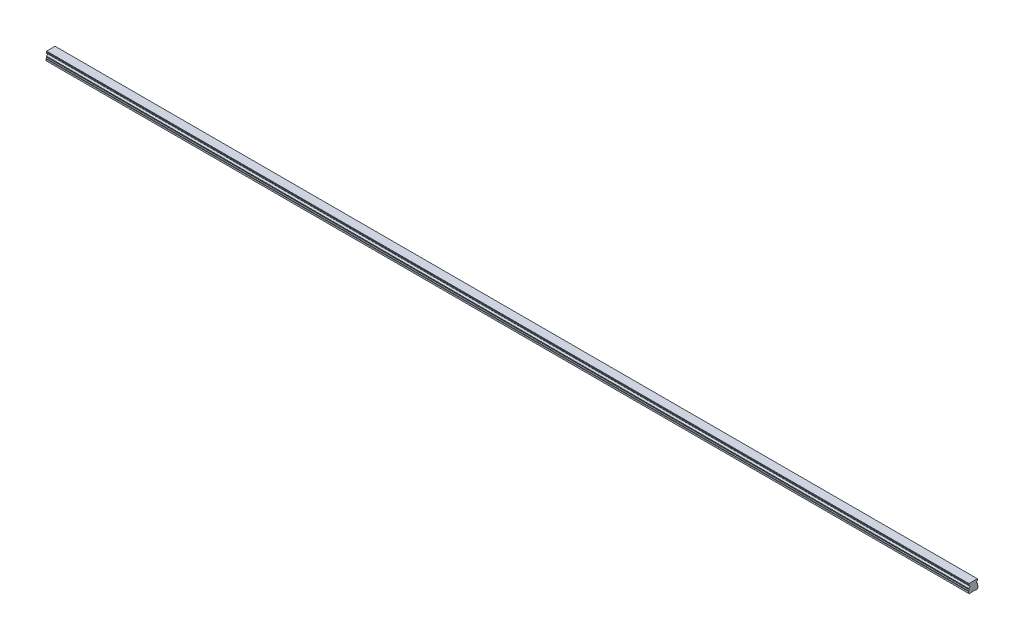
ISO-10303-21;
HEADER;
FILE_DESCRIPTION(('STEP AP214'),'2;1');
FILE_NAME('part.step','',(''),(''),'','','');
FILE_SCHEMA(('AUTOMOTIVE_DESIGN { 1 0 10303 214 1 1 1 1 }'));
ENDSEC;
DATA;
#1=APPLICATION_CONTEXT('core data for automotive mechanical design processes');
#2=APPLICATION_PROTOCOL_DEFINITION('international standard','automotive_design',2000,#1);
#3=PRODUCT_CONTEXT('',#1,'mechanical');
#4=PRODUCT('Part','Part','',(#3));
#5=PRODUCT_RELATED_PRODUCT_CATEGORY('part','',(#4));
#6=PRODUCT_DEFINITION_FORMATION('','',#4);
#7=PRODUCT_DEFINITION_CONTEXT('part definition',#1,'design');
#8=PRODUCT_DEFINITION('design','',#6,#7);
#9=PRODUCT_DEFINITION_SHAPE('','',#8);
#10=(LENGTH_UNIT() NAMED_UNIT(*) SI_UNIT(.MILLI.,.METRE.));
#11=(NAMED_UNIT(*) PLANE_ANGLE_UNIT() SI_UNIT($,.RADIAN.));
#12=(NAMED_UNIT(*) SI_UNIT($,.STERADIAN.) SOLID_ANGLE_UNIT());
#13=UNCERTAINTY_MEASURE_WITH_UNIT(LENGTH_MEASURE(1.E-05),#10,'distance_accuracy_value','');
#14=(GEOMETRIC_REPRESENTATION_CONTEXT(3) GLOBAL_UNCERTAINTY_ASSIGNED_CONTEXT((#13)) GLOBAL_UNIT_ASSIGNED_CONTEXT((#10,
#11,#12)) REPRESENTATION_CONTEXT('',''));
#15=CARTESIAN_POINT('',(0.,0.,0.));
#16=DIRECTION('',(0.,0.,1.));
#17=DIRECTION('',(1.,0.,0.));
#18=AXIS2_PLACEMENT_3D('',#15,#16,#17);
#19=CARTESIAN_POINT('',(1410.,0.399999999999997,0.));
#20=DIRECTION('',(0.,-1.,0.));
#21=DIRECTION('',(0.,0.,-1.));
#22=AXIS2_PLACEMENT_3D('',#19,#20,#21);
#23=CONICAL_SURFACE('',#22,2.89999999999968,0.785398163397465);
#24=CARTESIAN_POINT('',(1410.,0.799999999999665,0.));
#25=DIRECTION('',(0.,1.,0.));
#26=DIRECTION('',(0.,0.,1.));
#27=AXIS2_PLACEMENT_3D('',#24,#25,#26);
#28=CIRCLE('',#27,2.5);
#29=CARTESIAN_POINT('',(1410.,0.799999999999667,2.5));
#30=VERTEX_POINT('',#29);
#31=EDGE_CURVE('E11',#30,#30,#28,.F.);
#32=ORIENTED_EDGE('',*,*,#31,.F.);
#33=EDGE_LOOP('',(#32));
#34=FACE_BOUND('',#33,.T.);
#35=CARTESIAN_POINT('',(1410.,0.399999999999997,0.));
#36=DIRECTION('',(0.,1.,0.));
#37=DIRECTION('',(0.,0.,1.));
#38=AXIS2_PLACEMENT_3D('',#35,#36,#37);
#39=CIRCLE('',#38,2.89999999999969);
#40=CARTESIAN_POINT('',(1410.,0.399999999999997,2.89999999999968));
#41=VERTEX_POINT('',#40);
#42=EDGE_CURVE('E686',#41,#41,#39,.T.);
#43=ORIENTED_EDGE('',*,*,#42,.F.);
#44=EDGE_LOOP('',(#43));
#45=FACE_BOUND('',#44,.T.);
#46=ADVANCED_FACE('F39',(#34,#45),#23,.F.);
#47=CARTESIAN_POINT('',(1410.,7.,0.));
#48=DIRECTION('',(0.,-1.,0.));
#49=DIRECTION('',(0.,0.,-1.));
#50=AXIS2_PLACEMENT_3D('',#47,#48,#49);
#51=CYLINDRICAL_SURFACE('',#50,2.5);
#52=ORIENTED_EDGE('',*,*,#31,.T.);
#53=EDGE_LOOP('',(#52));
#54=FACE_BOUND('',#53,.T.);
#55=CARTESIAN_POINT('',(1410.,7.,0.));
#56=DIRECTION('',(0.,-1.,0.));
#57=DIRECTION('',(0.,0.,-1.));
#58=AXIS2_PLACEMENT_3D('',#55,#56,#57);
#59=CIRCLE('',#58,2.5);
#60=CARTESIAN_POINT('',(1410.,7.,-2.50000000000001));
#61=VERTEX_POINT('',#60);
#62=EDGE_CURVE('E49',#61,#61,#59,.T.);
#63=ORIENTED_EDGE('',*,*,#62,.F.);
#64=EDGE_LOOP('',(#63));
#65=FACE_BOUND('',#64,.T.);
#66=ADVANCED_FACE('F954',(#54,#65),#51,.F.);
#67=CARTESIAN_POINT('',(1410.,7.,0.));
#68=DIRECTION('',(0.,-1.,0.));
#69=DIRECTION('',(0.,0.,-1.));
#70=AXIS2_PLACEMENT_3D('',#67,#68,#69);
#71=PLANE('',#70);
#72=CARTESIAN_POINT('',(1410.,7.,0.));
#73=DIRECTION('',(0.,-1.,0.));
#74=DIRECTION('',(0.,0.,-1.));
#75=AXIS2_PLACEMENT_3D('',#72,#73,#74);
#76=CIRCLE('',#75,2.1);
#77=CARTESIAN_POINT('',(1410.,7.,-2.1));
#78=VERTEX_POINT('',#77);
#79=EDGE_CURVE('E42',#78,#78,#76,.T.);
#80=ORIENTED_EDGE('',*,*,#79,.F.);
#81=EDGE_LOOP('',(#80));
#82=FACE_BOUND('',#81,.T.);
#83=ORIENTED_EDGE('',*,*,#62,.T.);
#84=EDGE_LOOP('',(#83));
#85=FACE_BOUND('',#84,.T.);
#86=ADVANCED_FACE('F959',(#82,#85),#71,.T.);
#87=CARTESIAN_POINT('',(1350.,0.399999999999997,0.));
#88=DIRECTION('',(0.,-1.,0.));
#89=DIRECTION('',(0.,0.,-1.));
#90=AXIS2_PLACEMENT_3D('',#87,#88,#89);
#91=CONICAL_SURFACE('',#90,2.89999999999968,0.785398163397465);
#92=CARTESIAN_POINT('',(1350.,0.799999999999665,0.));
#93=DIRECTION('',(0.,1.,0.));
#94=DIRECTION('',(0.,0.,1.));
#95=AXIS2_PLACEMENT_3D('',#92,#93,#94);
#96=CIRCLE('',#95,2.5);
#97=CARTESIAN_POINT('',(1350.,0.799999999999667,2.5));
#98=VERTEX_POINT('',#97);
#99=EDGE_CURVE('E682',#98,#98,#96,.F.);
#100=ORIENTED_EDGE('',*,*,#99,.F.);
#101=EDGE_LOOP('',(#100));
#102=FACE_BOUND('',#101,.T.);
#103=CARTESIAN_POINT('',(1350.,0.399999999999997,0.));
#104=DIRECTION('',(0.,1.,0.));
#105=DIRECTION('',(0.,0.,1.));
#106=AXIS2_PLACEMENT_3D('',#103,#104,#105);
#107=CIRCLE('',#106,2.89999999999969);
#108=CARTESIAN_POINT('',(1350.,0.399999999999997,2.89999999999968));
#109=VERTEX_POINT('',#108);
#110=EDGE_CURVE('E674',#109,#109,#107,.T.);
#111=ORIENTED_EDGE('',*,*,#110,.F.);
#112=EDGE_LOOP('',(#111));
#113=FACE_BOUND('',#112,.T.);
#114=ADVANCED_FACE('F1286',(#102,#113),#91,.F.);
#115=CARTESIAN_POINT('',(1350.,7.,0.));
#116=DIRECTION('',(0.,-1.,0.));
#117=DIRECTION('',(0.,0.,-1.));
#118=AXIS2_PLACEMENT_3D('',#115,#116,#117);
#119=CYLINDRICAL_SURFACE('',#118,2.5);
#120=ORIENTED_EDGE('',*,*,#99,.T.);
#121=EDGE_LOOP('',(#120));
#122=FACE_BOUND('',#121,.T.);
#123=CARTESIAN_POINT('',(1350.,7.,0.));
#124=DIRECTION('',(0.,-1.,0.));
#125=DIRECTION('',(0.,0.,-1.));
#126=AXIS2_PLACEMENT_3D('',#123,#124,#125);
#127=CIRCLE('',#126,2.5);
#128=CARTESIAN_POINT('',(1350.,7.,-2.50000000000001));
#129=VERTEX_POINT('',#128);
#130=EDGE_CURVE('E678',#129,#129,#127,.T.);
#131=ORIENTED_EDGE('',*,*,#130,.F.);
#132=EDGE_LOOP('',(#131));
#133=FACE_BOUND('',#132,.T.);
#134=ADVANCED_FACE('F1282',(#122,#133),#119,.F.);
#135=CARTESIAN_POINT('',(1350.,7.,0.));
#136=DIRECTION('',(0.,-1.,0.));
#137=DIRECTION('',(0.,0.,-1.));
#138=AXIS2_PLACEMENT_3D('',#135,#136,#137);
#139=PLANE('',#138);
#140=CARTESIAN_POINT('',(1350.,7.,0.));
#141=DIRECTION('',(0.,-1.,0.));
#142=DIRECTION('',(0.,0.,-1.));
#143=AXIS2_PLACEMENT_3D('',#140,#141,#142);
#144=CIRCLE('',#143,2.1);
#145=CARTESIAN_POINT('',(1350.,7.,-2.1));
#146=VERTEX_POINT('',#145);
#147=EDGE_CURVE('E777',#146,#146,#144,.T.);
#148=ORIENTED_EDGE('',*,*,#147,.F.);
#149=EDGE_LOOP('',(#148));
#150=FACE_BOUND('',#149,.T.);
#151=ORIENTED_EDGE('',*,*,#130,.T.);
#152=EDGE_LOOP('',(#151));
#153=FACE_BOUND('',#152,.T.);
#154=ADVANCED_FACE('F1278',(#150,#153),#139,.T.);
#155=CARTESIAN_POINT('',(1290.,0.399999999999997,0.));
#156=DIRECTION('',(0.,-1.,0.));
#157=DIRECTION('',(0.,0.,-1.));
#158=AXIS2_PLACEMENT_3D('',#155,#156,#157);
#159=CONICAL_SURFACE('',#158,2.89999999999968,0.785398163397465);
#160=CARTESIAN_POINT('',(1290.,0.799999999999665,0.));
#161=DIRECTION('',(0.,1.,0.));
#162=DIRECTION('',(0.,0.,1.));
#163=AXIS2_PLACEMENT_3D('',#160,#161,#162);
#164=CIRCLE('',#163,2.5);
#165=CARTESIAN_POINT('',(1290.,0.799999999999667,2.5));
#166=VERTEX_POINT('',#165);
#167=EDGE_CURVE('E670',#166,#166,#164,.F.);
#168=ORIENTED_EDGE('',*,*,#167,.F.);
#169=EDGE_LOOP('',(#168));
#170=FACE_BOUND('',#169,.T.);
#171=CARTESIAN_POINT('',(1290.,0.399999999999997,0.));
#172=DIRECTION('',(0.,1.,0.));
#173=DIRECTION('',(0.,0.,1.));
#174=AXIS2_PLACEMENT_3D('',#171,#172,#173);
#175=CIRCLE('',#174,2.89999999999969);
#176=CARTESIAN_POINT('',(1290.,0.399999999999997,2.89999999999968));
#177=VERTEX_POINT('',#176);
#178=EDGE_CURVE('E662',#177,#177,#175,.T.);
#179=ORIENTED_EDGE('',*,*,#178,.F.);
#180=EDGE_LOOP('',(#179));
#181=FACE_BOUND('',#180,.T.);
#182=ADVANCED_FACE('F1274',(#170,#181),#159,.F.);
#183=CARTESIAN_POINT('',(1290.,7.,0.));
#184=DIRECTION('',(0.,-1.,0.));
#185=DIRECTION('',(0.,0.,-1.));
#186=AXIS2_PLACEMENT_3D('',#183,#184,#185);
#187=CYLINDRICAL_SURFACE('',#186,2.5);
#188=ORIENTED_EDGE('',*,*,#167,.T.);
#189=EDGE_LOOP('',(#188));
#190=FACE_BOUND('',#189,.T.);
#191=CARTESIAN_POINT('',(1290.,7.,0.));
#192=DIRECTION('',(0.,-1.,0.));
#193=DIRECTION('',(0.,0.,-1.));
#194=AXIS2_PLACEMENT_3D('',#191,#192,#193);
#195=CIRCLE('',#194,2.5);
#196=CARTESIAN_POINT('',(1290.,7.,-2.50000000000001));
#197=VERTEX_POINT('',#196);
#198=EDGE_CURVE('E666',#197,#197,#195,.T.);
#199=ORIENTED_EDGE('',*,*,#198,.F.);
#200=EDGE_LOOP('',(#199));
#201=FACE_BOUND('',#200,.T.);
#202=ADVANCED_FACE('F1270',(#190,#201),#187,.F.);
#203=CARTESIAN_POINT('',(1290.,7.,0.));
#204=DIRECTION('',(0.,-1.,0.));
#205=DIRECTION('',(0.,0.,-1.));
#206=AXIS2_PLACEMENT_3D('',#203,#204,#205);
#207=PLANE('',#206);
#208=CARTESIAN_POINT('',(1290.,7.,0.));
#209=DIRECTION('',(0.,-1.,0.));
#210=DIRECTION('',(0.,0.,-1.));
#211=AXIS2_PLACEMENT_3D('',#208,#209,#210);
#212=CIRCLE('',#211,2.1);
#213=CARTESIAN_POINT('',(1290.,7.,-2.1));
#214=VERTEX_POINT('',#213);
#215=EDGE_CURVE('E774',#214,#214,#212,.T.);
#216=ORIENTED_EDGE('',*,*,#215,.F.);
#217=EDGE_LOOP('',(#216));
#218=FACE_BOUND('',#217,.T.);
#219=ORIENTED_EDGE('',*,*,#198,.T.);
#220=EDGE_LOOP('',(#219));
#221=FACE_BOUND('',#220,.T.);
#222=ADVANCED_FACE('F1266',(#218,#221),#207,.T.);
#223=CARTESIAN_POINT('',(1230.,0.399999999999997,0.));
#224=DIRECTION('',(0.,-1.,0.));
#225=DIRECTION('',(0.,0.,-1.));
#226=AXIS2_PLACEMENT_3D('',#223,#224,#225);
#227=CONICAL_SURFACE('',#226,2.89999999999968,0.785398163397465);
#228=CARTESIAN_POINT('',(1230.,0.799999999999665,0.));
#229=DIRECTION('',(0.,1.,0.));
#230=DIRECTION('',(0.,0.,1.));
#231=AXIS2_PLACEMENT_3D('',#228,#229,#230);
#232=CIRCLE('',#231,2.5);
#233=CARTESIAN_POINT('',(1230.,0.799999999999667,2.5));
#234=VERTEX_POINT('',#233);
#235=EDGE_CURVE('E658',#234,#234,#232,.F.);
#236=ORIENTED_EDGE('',*,*,#235,.F.);
#237=EDGE_LOOP('',(#236));
#238=FACE_BOUND('',#237,.T.);
#239=CARTESIAN_POINT('',(1230.,0.399999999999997,0.));
#240=DIRECTION('',(0.,1.,0.));
#241=DIRECTION('',(0.,0.,1.));
#242=AXIS2_PLACEMENT_3D('',#239,#240,#241);
#243=CIRCLE('',#242,2.89999999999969);
#244=CARTESIAN_POINT('',(1230.,0.399999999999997,2.89999999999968));
#245=VERTEX_POINT('',#244);
#246=EDGE_CURVE('E650',#245,#245,#243,.T.);
#247=ORIENTED_EDGE('',*,*,#246,.F.);
#248=EDGE_LOOP('',(#247));
#249=FACE_BOUND('',#248,.T.);
#250=ADVANCED_FACE('F1262',(#238,#249),#227,.F.);
#251=CARTESIAN_POINT('',(1230.,7.,0.));
#252=DIRECTION('',(0.,-1.,0.));
#253=DIRECTION('',(0.,0.,-1.));
#254=AXIS2_PLACEMENT_3D('',#251,#252,#253);
#255=CYLINDRICAL_SURFACE('',#254,2.5);
#256=ORIENTED_EDGE('',*,*,#235,.T.);
#257=EDGE_LOOP('',(#256));
#258=FACE_BOUND('',#257,.T.);
#259=CARTESIAN_POINT('',(1230.,7.,0.));
#260=DIRECTION('',(0.,-1.,0.));
#261=DIRECTION('',(0.,0.,-1.));
#262=AXIS2_PLACEMENT_3D('',#259,#260,#261);
#263=CIRCLE('',#262,2.5);
#264=CARTESIAN_POINT('',(1230.,7.,-2.50000000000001));
#265=VERTEX_POINT('',#264);
#266=EDGE_CURVE('E654',#265,#265,#263,.T.);
#267=ORIENTED_EDGE('',*,*,#266,.F.);
#268=EDGE_LOOP('',(#267));
#269=FACE_BOUND('',#268,.T.);
#270=ADVANCED_FACE('F1258',(#258,#269),#255,.F.);
#271=CARTESIAN_POINT('',(1230.,7.,0.));
#272=DIRECTION('',(0.,-1.,0.));
#273=DIRECTION('',(0.,0.,-1.));
#274=AXIS2_PLACEMENT_3D('',#271,#272,#273);
#275=PLANE('',#274);
#276=CARTESIAN_POINT('',(1230.,7.,0.));
#277=DIRECTION('',(0.,-1.,0.));
#278=DIRECTION('',(0.,0.,-1.));
#279=AXIS2_PLACEMENT_3D('',#276,#277,#278);
#280=CIRCLE('',#279,2.1);
#281=CARTESIAN_POINT('',(1230.,7.,-2.1));
#282=VERTEX_POINT('',#281);
#283=EDGE_CURVE('E770',#282,#282,#280,.T.);
#284=ORIENTED_EDGE('',*,*,#283,.F.);
#285=EDGE_LOOP('',(#284));
#286=FACE_BOUND('',#285,.T.);
#287=ORIENTED_EDGE('',*,*,#266,.T.);
#288=EDGE_LOOP('',(#287));
#289=FACE_BOUND('',#288,.T.);
#290=ADVANCED_FACE('F1254',(#286,#289),#275,.T.);
#291=CARTESIAN_POINT('',(1170.,0.399999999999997,0.));
#292=DIRECTION('',(0.,-1.,0.));
#293=DIRECTION('',(0.,0.,-1.));
#294=AXIS2_PLACEMENT_3D('',#291,#292,#293);
#295=CONICAL_SURFACE('',#294,2.89999999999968,0.785398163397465);
#296=CARTESIAN_POINT('',(1170.,0.799999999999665,0.));
#297=DIRECTION('',(0.,1.,0.));
#298=DIRECTION('',(0.,0.,1.));
#299=AXIS2_PLACEMENT_3D('',#296,#297,#298);
#300=CIRCLE('',#299,2.5);
#301=CARTESIAN_POINT('',(1170.,0.799999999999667,2.5));
#302=VERTEX_POINT('',#301);
#303=EDGE_CURVE('E646',#302,#302,#300,.F.);
#304=ORIENTED_EDGE('',*,*,#303,.F.);
#305=EDGE_LOOP('',(#304));
#306=FACE_BOUND('',#305,.T.);
#307=CARTESIAN_POINT('',(1170.,0.399999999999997,0.));
#308=DIRECTION('',(0.,1.,0.));
#309=DIRECTION('',(0.,0.,1.));
#310=AXIS2_PLACEMENT_3D('',#307,#308,#309);
#311=CIRCLE('',#310,2.89999999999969);
#312=CARTESIAN_POINT('',(1170.,0.399999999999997,2.89999999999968));
#313=VERTEX_POINT('',#312);
#314=EDGE_CURVE('E638',#313,#313,#311,.T.);
#315=ORIENTED_EDGE('',*,*,#314,.F.);
#316=EDGE_LOOP('',(#315));
#317=FACE_BOUND('',#316,.T.);
#318=ADVANCED_FACE('F1250',(#306,#317),#295,.F.);
#319=CARTESIAN_POINT('',(1170.,7.,0.));
#320=DIRECTION('',(0.,-1.,0.));
#321=DIRECTION('',(0.,0.,-1.));
#322=AXIS2_PLACEMENT_3D('',#319,#320,#321);
#323=CYLINDRICAL_SURFACE('',#322,2.5);
#324=ORIENTED_EDGE('',*,*,#303,.T.);
#325=EDGE_LOOP('',(#324));
#326=FACE_BOUND('',#325,.T.);
#327=CARTESIAN_POINT('',(1170.,7.,0.));
#328=DIRECTION('',(0.,-1.,0.));
#329=DIRECTION('',(0.,0.,-1.));
#330=AXIS2_PLACEMENT_3D('',#327,#328,#329);
#331=CIRCLE('',#330,2.5);
#332=CARTESIAN_POINT('',(1170.,7.,-2.50000000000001));
#333=VERTEX_POINT('',#332);
#334=EDGE_CURVE('E642',#333,#333,#331,.T.);
#335=ORIENTED_EDGE('',*,*,#334,.F.);
#336=EDGE_LOOP('',(#335));
#337=FACE_BOUND('',#336,.T.);
#338=ADVANCED_FACE('F1246',(#326,#337),#323,.F.);
#339=CARTESIAN_POINT('',(1170.,7.,0.));
#340=DIRECTION('',(0.,-1.,0.));
#341=DIRECTION('',(0.,0.,-1.));
#342=AXIS2_PLACEMENT_3D('',#339,#340,#341);
#343=PLANE('',#342);
#344=CARTESIAN_POINT('',(1170.,7.,0.));
#345=DIRECTION('',(0.,-1.,0.));
#346=DIRECTION('',(0.,0.,-1.));
#347=AXIS2_PLACEMENT_3D('',#344,#345,#346);
#348=CIRCLE('',#347,2.1);
#349=CARTESIAN_POINT('',(1170.,7.,-2.1));
#350=VERTEX_POINT('',#349);
#351=EDGE_CURVE('E766',#350,#350,#348,.T.);
#352=ORIENTED_EDGE('',*,*,#351,.F.);
#353=EDGE_LOOP('',(#352));
#354=FACE_BOUND('',#353,.T.);
#355=ORIENTED_EDGE('',*,*,#334,.T.);
#356=EDGE_LOOP('',(#355));
#357=FACE_BOUND('',#356,.T.);
#358=ADVANCED_FACE('F1242',(#354,#357),#343,.T.);
#359=CARTESIAN_POINT('',(1110.,0.399999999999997,0.));
#360=DIRECTION('',(0.,-1.,0.));
#361=DIRECTION('',(0.,0.,-1.));
#362=AXIS2_PLACEMENT_3D('',#359,#360,#361);
#363=CONICAL_SURFACE('',#362,2.89999999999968,0.785398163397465);
#364=CARTESIAN_POINT('',(1110.,0.799999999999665,0.));
#365=DIRECTION('',(0.,1.,0.));
#366=DIRECTION('',(0.,0.,1.));
#367=AXIS2_PLACEMENT_3D('',#364,#365,#366);
#368=CIRCLE('',#367,2.5);
#369=CARTESIAN_POINT('',(1110.,0.799999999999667,2.5));
#370=VERTEX_POINT('',#369);
#371=EDGE_CURVE('E634',#370,#370,#368,.F.);
#372=ORIENTED_EDGE('',*,*,#371,.F.);
#373=EDGE_LOOP('',(#372));
#374=FACE_BOUND('',#373,.T.);
#375=CARTESIAN_POINT('',(1110.,0.399999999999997,0.));
#376=DIRECTION('',(0.,1.,0.));
#377=DIRECTION('',(0.,0.,1.));
#378=AXIS2_PLACEMENT_3D('',#375,#376,#377);
#379=CIRCLE('',#378,2.89999999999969);
#380=CARTESIAN_POINT('',(1110.,0.399999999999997,2.89999999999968));
#381=VERTEX_POINT('',#380);
#382=EDGE_CURVE('E626',#381,#381,#379,.T.);
#383=ORIENTED_EDGE('',*,*,#382,.F.);
#384=EDGE_LOOP('',(#383));
#385=FACE_BOUND('',#384,.T.);
#386=ADVANCED_FACE('F1238',(#374,#385),#363,.F.);
#387=CARTESIAN_POINT('',(1110.,7.,0.));
#388=DIRECTION('',(0.,-1.,0.));
#389=DIRECTION('',(0.,0.,-1.));
#390=AXIS2_PLACEMENT_3D('',#387,#388,#389);
#391=CYLINDRICAL_SURFACE('',#390,2.5);
#392=ORIENTED_EDGE('',*,*,#371,.T.);
#393=EDGE_LOOP('',(#392));
#394=FACE_BOUND('',#393,.T.);
#395=CARTESIAN_POINT('',(1110.,7.,0.));
#396=DIRECTION('',(0.,-1.,0.));
#397=DIRECTION('',(0.,0.,-1.));
#398=AXIS2_PLACEMENT_3D('',#395,#396,#397);
#399=CIRCLE('',#398,2.5);
#400=CARTESIAN_POINT('',(1110.,7.,-2.50000000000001));
#401=VERTEX_POINT('',#400);
#402=EDGE_CURVE('E630',#401,#401,#399,.T.);
#403=ORIENTED_EDGE('',*,*,#402,.F.);
#404=EDGE_LOOP('',(#403));
#405=FACE_BOUND('',#404,.T.);
#406=ADVANCED_FACE('F1234',(#394,#405),#391,.F.);
#407=CARTESIAN_POINT('',(1110.,7.,0.));
#408=DIRECTION('',(0.,-1.,0.));
#409=DIRECTION('',(0.,0.,-1.));
#410=AXIS2_PLACEMENT_3D('',#407,#408,#409);
#411=PLANE('',#410);
#412=CARTESIAN_POINT('',(1110.,7.,0.));
#413=DIRECTION('',(0.,-1.,0.));
#414=DIRECTION('',(0.,0.,-1.));
#415=AXIS2_PLACEMENT_3D('',#412,#413,#414);
#416=CIRCLE('',#415,2.1);
#417=CARTESIAN_POINT('',(1110.,7.,-2.1));
#418=VERTEX_POINT('',#417);
#419=EDGE_CURVE('E762',#418,#418,#416,.T.);
#420=ORIENTED_EDGE('',*,*,#419,.F.);
#421=EDGE_LOOP('',(#420));
#422=FACE_BOUND('',#421,.T.);
#423=ORIENTED_EDGE('',*,*,#402,.T.);
#424=EDGE_LOOP('',(#423));
#425=FACE_BOUND('',#424,.T.);
#426=ADVANCED_FACE('F1230',(#422,#425),#411,.T.);
#427=CARTESIAN_POINT('',(1050.,0.399999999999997,0.));
#428=DIRECTION('',(0.,-1.,0.));
#429=DIRECTION('',(0.,0.,-1.));
#430=AXIS2_PLACEMENT_3D('',#427,#428,#429);
#431=CONICAL_SURFACE('',#430,2.89999999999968,0.785398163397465);
#432=CARTESIAN_POINT('',(1050.,0.799999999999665,0.));
#433=DIRECTION('',(0.,1.,0.));
#434=DIRECTION('',(0.,0.,1.));
#435=AXIS2_PLACEMENT_3D('',#432,#433,#434);
#436=CIRCLE('',#435,2.5);
#437=CARTESIAN_POINT('',(1050.,0.799999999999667,2.5));
#438=VERTEX_POINT('',#437);
#439=EDGE_CURVE('E622',#438,#438,#436,.F.);
#440=ORIENTED_EDGE('',*,*,#439,.F.);
#441=EDGE_LOOP('',(#440));
#442=FACE_BOUND('',#441,.T.);
#443=CARTESIAN_POINT('',(1050.,0.399999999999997,0.));
#444=DIRECTION('',(0.,1.,0.));
#445=DIRECTION('',(0.,0.,1.));
#446=AXIS2_PLACEMENT_3D('',#443,#444,#445);
#447=CIRCLE('',#446,2.89999999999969);
#448=CARTESIAN_POINT('',(1050.,0.399999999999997,2.89999999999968));
#449=VERTEX_POINT('',#448);
#450=EDGE_CURVE('E614',#449,#449,#447,.T.);
#451=ORIENTED_EDGE('',*,*,#450,.F.);
#452=EDGE_LOOP('',(#451));
#453=FACE_BOUND('',#452,.T.);
#454=ADVANCED_FACE('F1226',(#442,#453),#431,.F.);
#455=CARTESIAN_POINT('',(1050.,7.,0.));
#456=DIRECTION('',(0.,-1.,0.));
#457=DIRECTION('',(0.,0.,-1.));
#458=AXIS2_PLACEMENT_3D('',#455,#456,#457);
#459=CYLINDRICAL_SURFACE('',#458,2.5);
#460=ORIENTED_EDGE('',*,*,#439,.T.);
#461=EDGE_LOOP('',(#460));
#462=FACE_BOUND('',#461,.T.);
#463=CARTESIAN_POINT('',(1050.,7.,0.));
#464=DIRECTION('',(0.,-1.,0.));
#465=DIRECTION('',(0.,0.,-1.));
#466=AXIS2_PLACEMENT_3D('',#463,#464,#465);
#467=CIRCLE('',#466,2.5);
#468=CARTESIAN_POINT('',(1050.,7.,-2.50000000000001));
#469=VERTEX_POINT('',#468);
#470=EDGE_CURVE('E618',#469,#469,#467,.T.);
#471=ORIENTED_EDGE('',*,*,#470,.F.);
#472=EDGE_LOOP('',(#471));
#473=FACE_BOUND('',#472,.T.);
#474=ADVANCED_FACE('F1222',(#462,#473),#459,.F.);
#475=CARTESIAN_POINT('',(1050.,7.,0.));
#476=DIRECTION('',(0.,-1.,0.));
#477=DIRECTION('',(0.,0.,-1.));
#478=AXIS2_PLACEMENT_3D('',#475,#476,#477);
#479=PLANE('',#478);
#480=CARTESIAN_POINT('',(1050.,7.,0.));
#481=DIRECTION('',(0.,-1.,0.));
#482=DIRECTION('',(0.,0.,-1.));
#483=AXIS2_PLACEMENT_3D('',#480,#481,#482);
#484=CIRCLE('',#483,2.1);
#485=CARTESIAN_POINT('',(1050.,7.,-2.1));
#486=VERTEX_POINT('',#485);
#487=EDGE_CURVE('E758',#486,#486,#484,.T.);
#488=ORIENTED_EDGE('',*,*,#487,.F.);
#489=EDGE_LOOP('',(#488));
#490=FACE_BOUND('',#489,.T.);
#491=ORIENTED_EDGE('',*,*,#470,.T.);
#492=EDGE_LOOP('',(#491));
#493=FACE_BOUND('',#492,.T.);
#494=ADVANCED_FACE('F1218',(#490,#493),#479,.T.);
#495=CARTESIAN_POINT('',(990.,0.399999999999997,0.));
#496=DIRECTION('',(0.,-1.,0.));
#497=DIRECTION('',(0.,0.,-1.));
#498=AXIS2_PLACEMENT_3D('',#495,#496,#497);
#499=CONICAL_SURFACE('',#498,2.89999999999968,0.785398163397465);
#500=CARTESIAN_POINT('',(990.,0.799999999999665,0.));
#501=DIRECTION('',(0.,1.,0.));
#502=DIRECTION('',(0.,0.,1.));
#503=AXIS2_PLACEMENT_3D('',#500,#501,#502);
#504=CIRCLE('',#503,2.5);
#505=CARTESIAN_POINT('',(990.,0.799999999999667,2.5));
#506=VERTEX_POINT('',#505);
#507=EDGE_CURVE('E610',#506,#506,#504,.F.);
#508=ORIENTED_EDGE('',*,*,#507,.F.);
#509=EDGE_LOOP('',(#508));
#510=FACE_BOUND('',#509,.T.);
#511=CARTESIAN_POINT('',(990.,0.399999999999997,0.));
#512=DIRECTION('',(0.,1.,0.));
#513=DIRECTION('',(0.,0.,1.));
#514=AXIS2_PLACEMENT_3D('',#511,#512,#513);
#515=CIRCLE('',#514,2.89999999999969);
#516=CARTESIAN_POINT('',(990.,0.399999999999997,2.89999999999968));
#517=VERTEX_POINT('',#516);
#518=EDGE_CURVE('E602',#517,#517,#515,.T.);
#519=ORIENTED_EDGE('',*,*,#518,.F.);
#520=EDGE_LOOP('',(#519));
#521=FACE_BOUND('',#520,.T.);
#522=ADVANCED_FACE('F1214',(#510,#521),#499,.F.);
#523=CARTESIAN_POINT('',(990.,7.,0.));
#524=DIRECTION('',(0.,-1.,0.));
#525=DIRECTION('',(0.,0.,-1.));
#526=AXIS2_PLACEMENT_3D('',#523,#524,#525);
#527=CYLINDRICAL_SURFACE('',#526,2.5);
#528=ORIENTED_EDGE('',*,*,#507,.T.);
#529=EDGE_LOOP('',(#528));
#530=FACE_BOUND('',#529,.T.);
#531=CARTESIAN_POINT('',(990.,7.,0.));
#532=DIRECTION('',(0.,-1.,0.));
#533=DIRECTION('',(0.,0.,-1.));
#534=AXIS2_PLACEMENT_3D('',#531,#532,#533);
#535=CIRCLE('',#534,2.5);
#536=CARTESIAN_POINT('',(990.,7.,-2.50000000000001));
#537=VERTEX_POINT('',#536);
#538=EDGE_CURVE('E606',#537,#537,#535,.T.);
#539=ORIENTED_EDGE('',*,*,#538,.F.);
#540=EDGE_LOOP('',(#539));
#541=FACE_BOUND('',#540,.T.);
#542=ADVANCED_FACE('F1210',(#530,#541),#527,.F.);
#543=CARTESIAN_POINT('',(990.,7.,0.));
#544=DIRECTION('',(0.,-1.,0.));
#545=DIRECTION('',(0.,0.,-1.));
#546=AXIS2_PLACEMENT_3D('',#543,#544,#545);
#547=PLANE('',#546);
#548=CARTESIAN_POINT('',(990.,7.,0.));
#549=DIRECTION('',(0.,-1.,0.));
#550=DIRECTION('',(0.,0.,-1.));
#551=AXIS2_PLACEMENT_3D('',#548,#549,#550);
#552=CIRCLE('',#551,2.1);
#553=CARTESIAN_POINT('',(990.,7.,-2.1));
#554=VERTEX_POINT('',#553);
#555=EDGE_CURVE('E754',#554,#554,#552,.T.);
#556=ORIENTED_EDGE('',*,*,#555,.F.);
#557=EDGE_LOOP('',(#556));
#558=FACE_BOUND('',#557,.T.);
#559=ORIENTED_EDGE('',*,*,#538,.T.);
#560=EDGE_LOOP('',(#559));
#561=FACE_BOUND('',#560,.T.);
#562=ADVANCED_FACE('F1206',(#558,#561),#547,.T.);
#563=CARTESIAN_POINT('',(930.,0.399999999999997,0.));
#564=DIRECTION('',(0.,-1.,0.));
#565=DIRECTION('',(0.,0.,-1.));
#566=AXIS2_PLACEMENT_3D('',#563,#564,#565);
#567=CONICAL_SURFACE('',#566,2.89999999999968,0.785398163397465);
#568=CARTESIAN_POINT('',(930.,0.799999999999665,0.));
#569=DIRECTION('',(0.,1.,0.));
#570=DIRECTION('',(0.,0.,1.));
#571=AXIS2_PLACEMENT_3D('',#568,#569,#570);
#572=CIRCLE('',#571,2.5);
#573=CARTESIAN_POINT('',(930.,0.799999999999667,2.5));
#574=VERTEX_POINT('',#573);
#575=EDGE_CURVE('E598',#574,#574,#572,.F.);
#576=ORIENTED_EDGE('',*,*,#575,.F.);
#577=EDGE_LOOP('',(#576));
#578=FACE_BOUND('',#577,.T.);
#579=CARTESIAN_POINT('',(930.,0.399999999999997,0.));
#580=DIRECTION('',(0.,1.,0.));
#581=DIRECTION('',(0.,0.,1.));
#582=AXIS2_PLACEMENT_3D('',#579,#580,#581);
#583=CIRCLE('',#582,2.89999999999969);
#584=CARTESIAN_POINT('',(930.,0.399999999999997,2.89999999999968));
#585=VERTEX_POINT('',#584);
#586=EDGE_CURVE('E590',#585,#585,#583,.T.);
#587=ORIENTED_EDGE('',*,*,#586,.F.);
#588=EDGE_LOOP('',(#587));
#589=FACE_BOUND('',#588,.T.);
#590=ADVANCED_FACE('F1202',(#578,#589),#567,.F.);
#591=CARTESIAN_POINT('',(930.,7.,0.));
#592=DIRECTION('',(0.,-1.,0.));
#593=DIRECTION('',(0.,0.,-1.));
#594=AXIS2_PLACEMENT_3D('',#591,#592,#593);
#595=CYLINDRICAL_SURFACE('',#594,2.5);
#596=ORIENTED_EDGE('',*,*,#575,.T.);
#597=EDGE_LOOP('',(#596));
#598=FACE_BOUND('',#597,.T.);
#599=CARTESIAN_POINT('',(930.,7.,0.));
#600=DIRECTION('',(0.,-1.,0.));
#601=DIRECTION('',(0.,0.,-1.));
#602=AXIS2_PLACEMENT_3D('',#599,#600,#601);
#603=CIRCLE('',#602,2.5);
#604=CARTESIAN_POINT('',(930.,7.,-2.50000000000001));
#605=VERTEX_POINT('',#604);
#606=EDGE_CURVE('E594',#605,#605,#603,.T.);
#607=ORIENTED_EDGE('',*,*,#606,.F.);
#608=EDGE_LOOP('',(#607));
#609=FACE_BOUND('',#608,.T.);
#610=ADVANCED_FACE('F1198',(#598,#609),#595,.F.);
#611=CARTESIAN_POINT('',(930.,7.,0.));
#612=DIRECTION('',(0.,-1.,0.));
#613=DIRECTION('',(0.,0.,-1.));
#614=AXIS2_PLACEMENT_3D('',#611,#612,#613);
#615=PLANE('',#614);
#616=CARTESIAN_POINT('',(930.,7.,0.));
#617=DIRECTION('',(0.,-1.,0.));
#618=DIRECTION('',(0.,0.,-1.));
#619=AXIS2_PLACEMENT_3D('',#616,#617,#618);
#620=CIRCLE('',#619,2.1);
#621=CARTESIAN_POINT('',(930.,7.,-2.1));
#622=VERTEX_POINT('',#621);
#623=EDGE_CURVE('E750',#622,#622,#620,.T.);
#624=ORIENTED_EDGE('',*,*,#623,.F.);
#625=EDGE_LOOP('',(#624));
#626=FACE_BOUND('',#625,.T.);
#627=ORIENTED_EDGE('',*,*,#606,.T.);
#628=EDGE_LOOP('',(#627));
#629=FACE_BOUND('',#628,.T.);
#630=ADVANCED_FACE('F1194',(#626,#629),#615,.T.);
#631=CARTESIAN_POINT('',(870.,0.399999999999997,0.));
#632=DIRECTION('',(0.,-1.,0.));
#633=DIRECTION('',(0.,0.,-1.));
#634=AXIS2_PLACEMENT_3D('',#631,#632,#633);
#635=CONICAL_SURFACE('',#634,2.89999999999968,0.785398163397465);
#636=CARTESIAN_POINT('',(870.,0.799999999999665,0.));
#637=DIRECTION('',(0.,1.,0.));
#638=DIRECTION('',(0.,0.,1.));
#639=AXIS2_PLACEMENT_3D('',#636,#637,#638);
#640=CIRCLE('',#639,2.5);
#641=CARTESIAN_POINT('',(870.,0.799999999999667,2.5));
#642=VERTEX_POINT('',#641);
#643=EDGE_CURVE('E586',#642,#642,#640,.F.);
#644=ORIENTED_EDGE('',*,*,#643,.F.);
#645=EDGE_LOOP('',(#644));
#646=FACE_BOUND('',#645,.T.);
#647=CARTESIAN_POINT('',(870.,0.399999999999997,0.));
#648=DIRECTION('',(0.,1.,0.));
#649=DIRECTION('',(0.,0.,1.));
#650=AXIS2_PLACEMENT_3D('',#647,#648,#649);
#651=CIRCLE('',#650,2.89999999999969);
#652=CARTESIAN_POINT('',(870.,0.399999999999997,2.89999999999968));
#653=VERTEX_POINT('',#652);
#654=EDGE_CURVE('E578',#653,#653,#651,.T.);
#655=ORIENTED_EDGE('',*,*,#654,.F.);
#656=EDGE_LOOP('',(#655));
#657=FACE_BOUND('',#656,.T.);
#658=ADVANCED_FACE('F1190',(#646,#657),#635,.F.);
#659=CARTESIAN_POINT('',(870.,7.,0.));
#660=DIRECTION('',(0.,-1.,0.));
#661=DIRECTION('',(0.,0.,-1.));
#662=AXIS2_PLACEMENT_3D('',#659,#660,#661);
#663=CYLINDRICAL_SURFACE('',#662,2.5);
#664=ORIENTED_EDGE('',*,*,#643,.T.);
#665=EDGE_LOOP('',(#664));
#666=FACE_BOUND('',#665,.T.);
#667=CARTESIAN_POINT('',(870.,7.,0.));
#668=DIRECTION('',(0.,-1.,0.));
#669=DIRECTION('',(0.,0.,-1.));
#670=AXIS2_PLACEMENT_3D('',#667,#668,#669);
#671=CIRCLE('',#670,2.5);
#672=CARTESIAN_POINT('',(870.,7.,-2.50000000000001));
#673=VERTEX_POINT('',#672);
#674=EDGE_CURVE('E582',#673,#673,#671,.T.);
#675=ORIENTED_EDGE('',*,*,#674,.F.);
#676=EDGE_LOOP('',(#675));
#677=FACE_BOUND('',#676,.T.);
#678=ADVANCED_FACE('F1186',(#666,#677),#663,.F.);
#679=CARTESIAN_POINT('',(870.,7.,0.));
#680=DIRECTION('',(0.,-1.,0.));
#681=DIRECTION('',(0.,0.,-1.));
#682=AXIS2_PLACEMENT_3D('',#679,#680,#681);
#683=PLANE('',#682);
#684=CARTESIAN_POINT('',(870.,7.,0.));
#685=DIRECTION('',(0.,-1.,0.));
#686=DIRECTION('',(0.,0.,-1.));
#687=AXIS2_PLACEMENT_3D('',#684,#685,#686);
#688=CIRCLE('',#687,2.1);
#689=CARTESIAN_POINT('',(870.,7.,-2.1));
#690=VERTEX_POINT('',#689);
#691=EDGE_CURVE('E746',#690,#690,#688,.T.);
#692=ORIENTED_EDGE('',*,*,#691,.F.);
#693=EDGE_LOOP('',(#692));
#694=FACE_BOUND('',#693,.T.);
#695=ORIENTED_EDGE('',*,*,#674,.T.);
#696=EDGE_LOOP('',(#695));
#697=FACE_BOUND('',#696,.T.);
#698=ADVANCED_FACE('F1182',(#694,#697),#683,.T.);
#699=CARTESIAN_POINT('',(810.,0.399999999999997,0.));
#700=DIRECTION('',(0.,-1.,0.));
#701=DIRECTION('',(0.,0.,-1.));
#702=AXIS2_PLACEMENT_3D('',#699,#700,#701);
#703=CONICAL_SURFACE('',#702,2.89999999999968,0.785398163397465);
#704=CARTESIAN_POINT('',(810.,0.799999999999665,0.));
#705=DIRECTION('',(0.,1.,0.));
#706=DIRECTION('',(0.,0.,1.));
#707=AXIS2_PLACEMENT_3D('',#704,#705,#706);
#708=CIRCLE('',#707,2.5);
#709=CARTESIAN_POINT('',(810.,0.799999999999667,2.5));
#710=VERTEX_POINT('',#709);
#711=EDGE_CURVE('E574',#710,#710,#708,.F.);
#712=ORIENTED_EDGE('',*,*,#711,.F.);
#713=EDGE_LOOP('',(#712));
#714=FACE_BOUND('',#713,.T.);
#715=CARTESIAN_POINT('',(810.,0.399999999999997,0.));
#716=DIRECTION('',(0.,1.,0.));
#717=DIRECTION('',(0.,0.,1.));
#718=AXIS2_PLACEMENT_3D('',#715,#716,#717);
#719=CIRCLE('',#718,2.89999999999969);
#720=CARTESIAN_POINT('',(810.,0.399999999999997,2.89999999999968));
#721=VERTEX_POINT('',#720);
#722=EDGE_CURVE('E566',#721,#721,#719,.T.);
#723=ORIENTED_EDGE('',*,*,#722,.F.);
#724=EDGE_LOOP('',(#723));
#725=FACE_BOUND('',#724,.T.);
#726=ADVANCED_FACE('F1178',(#714,#725),#703,.F.);
#727=CARTESIAN_POINT('',(810.,7.,0.));
#728=DIRECTION('',(0.,-1.,0.));
#729=DIRECTION('',(0.,0.,-1.));
#730=AXIS2_PLACEMENT_3D('',#727,#728,#729);
#731=CYLINDRICAL_SURFACE('',#730,2.5);
#732=ORIENTED_EDGE('',*,*,#711,.T.);
#733=EDGE_LOOP('',(#732));
#734=FACE_BOUND('',#733,.T.);
#735=CARTESIAN_POINT('',(810.,7.,0.));
#736=DIRECTION('',(0.,-1.,0.));
#737=DIRECTION('',(0.,0.,-1.));
#738=AXIS2_PLACEMENT_3D('',#735,#736,#737);
#739=CIRCLE('',#738,2.5);
#740=CARTESIAN_POINT('',(810.,7.,-2.50000000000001));
#741=VERTEX_POINT('',#740);
#742=EDGE_CURVE('E570',#741,#741,#739,.T.);
#743=ORIENTED_EDGE('',*,*,#742,.F.);
#744=EDGE_LOOP('',(#743));
#745=FACE_BOUND('',#744,.T.);
#746=ADVANCED_FACE('F1174',(#734,#745),#731,.F.);
#747=CARTESIAN_POINT('',(810.,7.,0.));
#748=DIRECTION('',(0.,-1.,0.));
#749=DIRECTION('',(0.,0.,-1.));
#750=AXIS2_PLACEMENT_3D('',#747,#748,#749);
#751=PLANE('',#750);
#752=CARTESIAN_POINT('',(810.,7.,0.));
#753=DIRECTION('',(0.,-1.,0.));
#754=DIRECTION('',(0.,0.,-1.));
#755=AXIS2_PLACEMENT_3D('',#752,#753,#754);
#756=CIRCLE('',#755,2.1);
#757=CARTESIAN_POINT('',(810.,7.,-2.1));
#758=VERTEX_POINT('',#757);
#759=EDGE_CURVE('E742',#758,#758,#756,.T.);
#760=ORIENTED_EDGE('',*,*,#759,.F.);
#761=EDGE_LOOP('',(#760));
#762=FACE_BOUND('',#761,.T.);
#763=ORIENTED_EDGE('',*,*,#742,.T.);
#764=EDGE_LOOP('',(#763));
#765=FACE_BOUND('',#764,.T.);
#766=ADVANCED_FACE('F1170',(#762,#765),#751,.T.);
#767=CARTESIAN_POINT('',(750.,0.399999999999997,0.));
#768=DIRECTION('',(0.,-1.,0.));
#769=DIRECTION('',(0.,0.,-1.));
#770=AXIS2_PLACEMENT_3D('',#767,#768,#769);
#771=CONICAL_SURFACE('',#770,2.89999999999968,0.785398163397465);
#772=CARTESIAN_POINT('',(750.,0.799999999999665,0.));
#773=DIRECTION('',(0.,1.,0.));
#774=DIRECTION('',(0.,0.,1.));
#775=AXIS2_PLACEMENT_3D('',#772,#773,#774);
#776=CIRCLE('',#775,2.5);
#777=CARTESIAN_POINT('',(750.,0.799999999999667,2.5));
#778=VERTEX_POINT('',#777);
#779=EDGE_CURVE('E562',#778,#778,#776,.F.);
#780=ORIENTED_EDGE('',*,*,#779,.F.);
#781=EDGE_LOOP('',(#780));
#782=FACE_BOUND('',#781,.T.);
#783=CARTESIAN_POINT('',(750.,0.399999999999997,0.));
#784=DIRECTION('',(0.,1.,0.));
#785=DIRECTION('',(0.,0.,1.));
#786=AXIS2_PLACEMENT_3D('',#783,#784,#785);
#787=CIRCLE('',#786,2.89999999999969);
#788=CARTESIAN_POINT('',(750.,0.399999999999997,2.89999999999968));
#789=VERTEX_POINT('',#788);
#790=EDGE_CURVE('E554',#789,#789,#787,.T.);
#791=ORIENTED_EDGE('',*,*,#790,.F.);
#792=EDGE_LOOP('',(#791));
#793=FACE_BOUND('',#792,.T.);
#794=ADVANCED_FACE('F1166',(#782,#793),#771,.F.);
#795=CARTESIAN_POINT('',(750.,7.,0.));
#796=DIRECTION('',(0.,-1.,0.));
#797=DIRECTION('',(0.,0.,-1.));
#798=AXIS2_PLACEMENT_3D('',#795,#796,#797);
#799=CYLINDRICAL_SURFACE('',#798,2.5);
#800=ORIENTED_EDGE('',*,*,#779,.T.);
#801=EDGE_LOOP('',(#800));
#802=FACE_BOUND('',#801,.T.);
#803=CARTESIAN_POINT('',(750.,7.,0.));
#804=DIRECTION('',(0.,-1.,0.));
#805=DIRECTION('',(0.,0.,-1.));
#806=AXIS2_PLACEMENT_3D('',#803,#804,#805);
#807=CIRCLE('',#806,2.5);
#808=CARTESIAN_POINT('',(750.,7.,-2.50000000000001));
#809=VERTEX_POINT('',#808);
#810=EDGE_CURVE('E558',#809,#809,#807,.T.);
#811=ORIENTED_EDGE('',*,*,#810,.F.);
#812=EDGE_LOOP('',(#811));
#813=FACE_BOUND('',#812,.T.);
#814=ADVANCED_FACE('F1162',(#802,#813),#799,.F.);
#815=CARTESIAN_POINT('',(750.,7.,0.));
#816=DIRECTION('',(0.,-1.,0.));
#817=DIRECTION('',(0.,0.,-1.));
#818=AXIS2_PLACEMENT_3D('',#815,#816,#817);
#819=PLANE('',#818);
#820=CARTESIAN_POINT('',(750.,7.,0.));
#821=DIRECTION('',(0.,-1.,0.));
#822=DIRECTION('',(0.,0.,-1.));
#823=AXIS2_PLACEMENT_3D('',#820,#821,#822);
#824=CIRCLE('',#823,2.1);
#825=CARTESIAN_POINT('',(750.,7.,-2.1));
#826=VERTEX_POINT('',#825);
#827=EDGE_CURVE('E738',#826,#826,#824,.T.);
#828=ORIENTED_EDGE('',*,*,#827,.F.);
#829=EDGE_LOOP('',(#828));
#830=FACE_BOUND('',#829,.T.);
#831=ORIENTED_EDGE('',*,*,#810,.T.);
#832=EDGE_LOOP('',(#831));
#833=FACE_BOUND('',#832,.T.);
#834=ADVANCED_FACE('F1158',(#830,#833),#819,.T.);
#835=CARTESIAN_POINT('',(690.,0.399999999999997,0.));
#836=DIRECTION('',(0.,-1.,0.));
#837=DIRECTION('',(0.,0.,-1.));
#838=AXIS2_PLACEMENT_3D('',#835,#836,#837);
#839=CONICAL_SURFACE('',#838,2.89999999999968,0.785398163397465);
#840=CARTESIAN_POINT('',(690.,0.799999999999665,0.));
#841=DIRECTION('',(0.,1.,0.));
#842=DIRECTION('',(0.,0.,1.));
#843=AXIS2_PLACEMENT_3D('',#840,#841,#842);
#844=CIRCLE('',#843,2.5);
#845=CARTESIAN_POINT('',(690.,0.799999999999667,2.5));
#846=VERTEX_POINT('',#845);
#847=EDGE_CURVE('E550',#846,#846,#844,.F.);
#848=ORIENTED_EDGE('',*,*,#847,.F.);
#849=EDGE_LOOP('',(#848));
#850=FACE_BOUND('',#849,.T.);
#851=CARTESIAN_POINT('',(690.,0.399999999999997,0.));
#852=DIRECTION('',(0.,1.,0.));
#853=DIRECTION('',(0.,0.,1.));
#854=AXIS2_PLACEMENT_3D('',#851,#852,#853);
#855=CIRCLE('',#854,2.89999999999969);
#856=CARTESIAN_POINT('',(690.,0.399999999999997,2.89999999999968));
#857=VERTEX_POINT('',#856);
#858=EDGE_CURVE('E542',#857,#857,#855,.T.);
#859=ORIENTED_EDGE('',*,*,#858,.F.);
#860=EDGE_LOOP('',(#859));
#861=FACE_BOUND('',#860,.T.);
#862=ADVANCED_FACE('F1154',(#850,#861),#839,.F.);
#863=CARTESIAN_POINT('',(690.,7.,0.));
#864=DIRECTION('',(0.,-1.,0.));
#865=DIRECTION('',(0.,0.,-1.));
#866=AXIS2_PLACEMENT_3D('',#863,#864,#865);
#867=CYLINDRICAL_SURFACE('',#866,2.5);
#868=ORIENTED_EDGE('',*,*,#847,.T.);
#869=EDGE_LOOP('',(#868));
#870=FACE_BOUND('',#869,.T.);
#871=CARTESIAN_POINT('',(690.,7.,0.));
#872=DIRECTION('',(0.,-1.,0.));
#873=DIRECTION('',(0.,0.,-1.));
#874=AXIS2_PLACEMENT_3D('',#871,#872,#873);
#875=CIRCLE('',#874,2.5);
#876=CARTESIAN_POINT('',(690.,7.,-2.50000000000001));
#877=VERTEX_POINT('',#876);
#878=EDGE_CURVE('E546',#877,#877,#875,.T.);
#879=ORIENTED_EDGE('',*,*,#878,.F.);
#880=EDGE_LOOP('',(#879));
#881=FACE_BOUND('',#880,.T.);
#882=ADVANCED_FACE('F1150',(#870,#881),#867,.F.);
#883=CARTESIAN_POINT('',(690.,7.,0.));
#884=DIRECTION('',(0.,-1.,0.));
#885=DIRECTION('',(0.,0.,-1.));
#886=AXIS2_PLACEMENT_3D('',#883,#884,#885);
#887=PLANE('',#886);
#888=CARTESIAN_POINT('',(690.,7.,0.));
#889=DIRECTION('',(0.,-1.,0.));
#890=DIRECTION('',(0.,0.,-1.));
#891=AXIS2_PLACEMENT_3D('',#888,#889,#890);
#892=CIRCLE('',#891,2.1);
#893=CARTESIAN_POINT('',(690.,7.,-2.1));
#894=VERTEX_POINT('',#893);
#895=EDGE_CURVE('E734',#894,#894,#892,.T.);
#896=ORIENTED_EDGE('',*,*,#895,.F.);
#897=EDGE_LOOP('',(#896));
#898=FACE_BOUND('',#897,.T.);
#899=ORIENTED_EDGE('',*,*,#878,.T.);
#900=EDGE_LOOP('',(#899));
#901=FACE_BOUND('',#900,.T.);
#902=ADVANCED_FACE('F1146',(#898,#901),#887,.T.);
#903=CARTESIAN_POINT('',(630.,0.399999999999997,0.));
#904=DIRECTION('',(0.,-1.,0.));
#905=DIRECTION('',(0.,0.,-1.));
#906=AXIS2_PLACEMENT_3D('',#903,#904,#905);
#907=CONICAL_SURFACE('',#906,2.89999999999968,0.785398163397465);
#908=CARTESIAN_POINT('',(630.,0.799999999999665,0.));
#909=DIRECTION('',(0.,1.,0.));
#910=DIRECTION('',(0.,0.,1.));
#911=AXIS2_PLACEMENT_3D('',#908,#909,#910);
#912=CIRCLE('',#911,2.5);
#913=CARTESIAN_POINT('',(630.,0.799999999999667,2.5));
#914=VERTEX_POINT('',#913);
#915=EDGE_CURVE('E538',#914,#914,#912,.F.);
#916=ORIENTED_EDGE('',*,*,#915,.F.);
#917=EDGE_LOOP('',(#916));
#918=FACE_BOUND('',#917,.T.);
#919=CARTESIAN_POINT('',(630.,0.399999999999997,0.));
#920=DIRECTION('',(0.,1.,0.));
#921=DIRECTION('',(0.,0.,1.));
#922=AXIS2_PLACEMENT_3D('',#919,#920,#921);
#923=CIRCLE('',#922,2.89999999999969);
#924=CARTESIAN_POINT('',(630.,0.399999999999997,2.89999999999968));
#925=VERTEX_POINT('',#924);
#926=EDGE_CURVE('E530',#925,#925,#923,.T.);
#927=ORIENTED_EDGE('',*,*,#926,.F.);
#928=EDGE_LOOP('',(#927));
#929=FACE_BOUND('',#928,.T.);
#930=ADVANCED_FACE('F1142',(#918,#929),#907,.F.);
#931=CARTESIAN_POINT('',(630.,7.,0.));
#932=DIRECTION('',(0.,-1.,0.));
#933=DIRECTION('',(0.,0.,-1.));
#934=AXIS2_PLACEMENT_3D('',#931,#932,#933);
#935=CYLINDRICAL_SURFACE('',#934,2.5);
#936=ORIENTED_EDGE('',*,*,#915,.T.);
#937=EDGE_LOOP('',(#936));
#938=FACE_BOUND('',#937,.T.);
#939=CARTESIAN_POINT('',(630.,7.,0.));
#940=DIRECTION('',(0.,-1.,0.));
#941=DIRECTION('',(0.,0.,-1.));
#942=AXIS2_PLACEMENT_3D('',#939,#940,#941);
#943=CIRCLE('',#942,2.5);
#944=CARTESIAN_POINT('',(630.,7.,-2.50000000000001));
#945=VERTEX_POINT('',#944);
#946=EDGE_CURVE('E534',#945,#945,#943,.T.);
#947=ORIENTED_EDGE('',*,*,#946,.F.);
#948=EDGE_LOOP('',(#947));
#949=FACE_BOUND('',#948,.T.);
#950=ADVANCED_FACE('F1138',(#938,#949),#935,.F.);
#951=CARTESIAN_POINT('',(630.,7.,0.));
#952=DIRECTION('',(0.,-1.,0.));
#953=DIRECTION('',(0.,0.,-1.));
#954=AXIS2_PLACEMENT_3D('',#951,#952,#953);
#955=PLANE('',#954);
#956=CARTESIAN_POINT('',(630.,7.,0.));
#957=DIRECTION('',(0.,-1.,0.));
#958=DIRECTION('',(0.,0.,-1.));
#959=AXIS2_PLACEMENT_3D('',#956,#957,#958);
#960=CIRCLE('',#959,2.1);
#961=CARTESIAN_POINT('',(630.,7.,-2.1));
#962=VERTEX_POINT('',#961);
#963=EDGE_CURVE('E730',#962,#962,#960,.T.);
#964=ORIENTED_EDGE('',*,*,#963,.F.);
#965=EDGE_LOOP('',(#964));
#966=FACE_BOUND('',#965,.T.);
#967=ORIENTED_EDGE('',*,*,#946,.T.);
#968=EDGE_LOOP('',(#967));
#969=FACE_BOUND('',#968,.T.);
#970=ADVANCED_FACE('F1134',(#966,#969),#955,.T.);
#971=CARTESIAN_POINT('',(570.,0.399999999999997,0.));
#972=DIRECTION('',(0.,-1.,0.));
#973=DIRECTION('',(0.,0.,-1.));
#974=AXIS2_PLACEMENT_3D('',#971,#972,#973);
#975=CONICAL_SURFACE('',#974,2.89999999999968,0.785398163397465);
#976=CARTESIAN_POINT('',(570.,0.799999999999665,0.));
#977=DIRECTION('',(0.,1.,0.));
#978=DIRECTION('',(0.,0.,1.));
#979=AXIS2_PLACEMENT_3D('',#976,#977,#978);
#980=CIRCLE('',#979,2.5);
#981=CARTESIAN_POINT('',(570.,0.799999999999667,2.5));
#982=VERTEX_POINT('',#981);
#983=EDGE_CURVE('E526',#982,#982,#980,.F.);
#984=ORIENTED_EDGE('',*,*,#983,.F.);
#985=EDGE_LOOP('',(#984));
#986=FACE_BOUND('',#985,.T.);
#987=CARTESIAN_POINT('',(570.,0.399999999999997,0.));
#988=DIRECTION('',(0.,1.,0.));
#989=DIRECTION('',(0.,0.,1.));
#990=AXIS2_PLACEMENT_3D('',#987,#988,#989);
#991=CIRCLE('',#990,2.89999999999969);
#992=CARTESIAN_POINT('',(570.,0.399999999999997,2.89999999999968));
#993=VERTEX_POINT('',#992);
#994=EDGE_CURVE('E518',#993,#993,#991,.T.);
#995=ORIENTED_EDGE('',*,*,#994,.F.);
#996=EDGE_LOOP('',(#995));
#997=FACE_BOUND('',#996,.T.);
#998=ADVANCED_FACE('F1130',(#986,#997),#975,.F.);
#999=CARTESIAN_POINT('',(570.,7.,0.));
#1000=DIRECTION('',(0.,-1.,0.));
#1001=DIRECTION('',(0.,0.,-1.));
#1002=AXIS2_PLACEMENT_3D('',#999,#1000,#1001);
#1003=CYLINDRICAL_SURFACE('',#1002,2.5);
#1004=ORIENTED_EDGE('',*,*,#983,.T.);
#1005=EDGE_LOOP('',(#1004));
#1006=FACE_BOUND('',#1005,.T.);
#1007=CARTESIAN_POINT('',(570.,7.,0.));
#1008=DIRECTION('',(0.,-1.,0.));
#1009=DIRECTION('',(0.,0.,-1.));
#1010=AXIS2_PLACEMENT_3D('',#1007,#1008,#1009);
#1011=CIRCLE('',#1010,2.5);
#1012=CARTESIAN_POINT('',(570.,7.,-2.50000000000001));
#1013=VERTEX_POINT('',#1012);
#1014=EDGE_CURVE('E522',#1013,#1013,#1011,.T.);
#1015=ORIENTED_EDGE('',*,*,#1014,.F.);
#1016=EDGE_LOOP('',(#1015));
#1017=FACE_BOUND('',#1016,.T.);
#1018=ADVANCED_FACE('F1126',(#1006,#1017),#1003,.F.);
#1019=CARTESIAN_POINT('',(570.,7.,0.));
#1020=DIRECTION('',(0.,-1.,0.));
#1021=DIRECTION('',(0.,0.,-1.));
#1022=AXIS2_PLACEMENT_3D('',#1019,#1020,#1021);
#1023=PLANE('',#1022);
#1024=CARTESIAN_POINT('',(570.,7.,0.));
#1025=DIRECTION('',(0.,-1.,0.));
#1026=DIRECTION('',(0.,0.,-1.));
#1027=AXIS2_PLACEMENT_3D('',#1024,#1025,#1026);
#1028=CIRCLE('',#1027,2.1);
#1029=CARTESIAN_POINT('',(570.,7.,-2.1));
#1030=VERTEX_POINT('',#1029);
#1031=EDGE_CURVE('E726',#1030,#1030,#1028,.T.);
#1032=ORIENTED_EDGE('',*,*,#1031,.F.);
#1033=EDGE_LOOP('',(#1032));
#1034=FACE_BOUND('',#1033,.T.);
#1035=ORIENTED_EDGE('',*,*,#1014,.T.);
#1036=EDGE_LOOP('',(#1035));
#1037=FACE_BOUND('',#1036,.T.);
#1038=ADVANCED_FACE('F1122',(#1034,#1037),#1023,.T.);
#1039=CARTESIAN_POINT('',(510.,0.399999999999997,0.));
#1040=DIRECTION('',(0.,-1.,0.));
#1041=DIRECTION('',(0.,0.,-1.));
#1042=AXIS2_PLACEMENT_3D('',#1039,#1040,#1041);
#1043=CONICAL_SURFACE('',#1042,2.89999999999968,0.785398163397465);
#1044=CARTESIAN_POINT('',(510.,0.799999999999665,0.));
#1045=DIRECTION('',(0.,1.,0.));
#1046=DIRECTION('',(0.,0.,1.));
#1047=AXIS2_PLACEMENT_3D('',#1044,#1045,#1046);
#1048=CIRCLE('',#1047,2.5);
#1049=CARTESIAN_POINT('',(510.,0.799999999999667,2.5));
#1050=VERTEX_POINT('',#1049);
#1051=EDGE_CURVE('E514',#1050,#1050,#1048,.F.);
#1052=ORIENTED_EDGE('',*,*,#1051,.F.);
#1053=EDGE_LOOP('',(#1052));
#1054=FACE_BOUND('',#1053,.T.);
#1055=CARTESIAN_POINT('',(510.,0.399999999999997,0.));
#1056=DIRECTION('',(0.,1.,0.));
#1057=DIRECTION('',(0.,0.,1.));
#1058=AXIS2_PLACEMENT_3D('',#1055,#1056,#1057);
#1059=CIRCLE('',#1058,2.89999999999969);
#1060=CARTESIAN_POINT('',(510.,0.399999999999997,2.89999999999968));
#1061=VERTEX_POINT('',#1060);
#1062=EDGE_CURVE('E506',#1061,#1061,#1059,.T.);
#1063=ORIENTED_EDGE('',*,*,#1062,.F.);
#1064=EDGE_LOOP('',(#1063));
#1065=FACE_BOUND('',#1064,.T.);
#1066=ADVANCED_FACE('F1118',(#1054,#1065),#1043,.F.);
#1067=CARTESIAN_POINT('',(510.,7.,0.));
#1068=DIRECTION('',(0.,-1.,0.));
#1069=DIRECTION('',(0.,0.,-1.));
#1070=AXIS2_PLACEMENT_3D('',#1067,#1068,#1069);
#1071=CYLINDRICAL_SURFACE('',#1070,2.5);
#1072=ORIENTED_EDGE('',*,*,#1051,.T.);
#1073=EDGE_LOOP('',(#1072));
#1074=FACE_BOUND('',#1073,.T.);
#1075=CARTESIAN_POINT('',(510.,7.,0.));
#1076=DIRECTION('',(0.,-1.,0.));
#1077=DIRECTION('',(0.,0.,-1.));
#1078=AXIS2_PLACEMENT_3D('',#1075,#1076,#1077);
#1079=CIRCLE('',#1078,2.5);
#1080=CARTESIAN_POINT('',(510.,7.,-2.50000000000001));
#1081=VERTEX_POINT('',#1080);
#1082=EDGE_CURVE('E510',#1081,#1081,#1079,.T.);
#1083=ORIENTED_EDGE('',*,*,#1082,.F.);
#1084=EDGE_LOOP('',(#1083));
#1085=FACE_BOUND('',#1084,.T.);
#1086=ADVANCED_FACE('F1114',(#1074,#1085),#1071,.F.);
#1087=CARTESIAN_POINT('',(510.,7.,0.));
#1088=DIRECTION('',(0.,-1.,0.));
#1089=DIRECTION('',(0.,0.,-1.));
#1090=AXIS2_PLACEMENT_3D('',#1087,#1088,#1089);
#1091=PLANE('',#1090);
#1092=CARTESIAN_POINT('',(510.,7.,0.));
#1093=DIRECTION('',(0.,-1.,0.));
#1094=DIRECTION('',(0.,0.,-1.));
#1095=AXIS2_PLACEMENT_3D('',#1092,#1093,#1094);
#1096=CIRCLE('',#1095,2.1);
#1097=CARTESIAN_POINT('',(510.,7.,-2.1));
#1098=VERTEX_POINT('',#1097);
#1099=EDGE_CURVE('E722',#1098,#1098,#1096,.T.);
#1100=ORIENTED_EDGE('',*,*,#1099,.F.);
#1101=EDGE_LOOP('',(#1100));
#1102=FACE_BOUND('',#1101,.T.);
#1103=ORIENTED_EDGE('',*,*,#1082,.T.);
#1104=EDGE_LOOP('',(#1103));
#1105=FACE_BOUND('',#1104,.T.);
#1106=ADVANCED_FACE('F1110',(#1102,#1105),#1091,.T.);
#1107=CARTESIAN_POINT('',(450.,0.399999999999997,0.));
#1108=DIRECTION('',(0.,-1.,0.));
#1109=DIRECTION('',(0.,0.,-1.));
#1110=AXIS2_PLACEMENT_3D('',#1107,#1108,#1109);
#1111=CONICAL_SURFACE('',#1110,2.89999999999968,0.785398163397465);
#1112=CARTESIAN_POINT('',(450.,0.799999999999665,0.));
#1113=DIRECTION('',(0.,1.,0.));
#1114=DIRECTION('',(0.,0.,1.));
#1115=AXIS2_PLACEMENT_3D('',#1112,#1113,#1114);
#1116=CIRCLE('',#1115,2.5);
#1117=CARTESIAN_POINT('',(450.,0.799999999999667,2.5));
#1118=VERTEX_POINT('',#1117);
#1119=EDGE_CURVE('E502',#1118,#1118,#1116,.F.);
#1120=ORIENTED_EDGE('',*,*,#1119,.F.);
#1121=EDGE_LOOP('',(#1120));
#1122=FACE_BOUND('',#1121,.T.);
#1123=CARTESIAN_POINT('',(450.,0.399999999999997,0.));
#1124=DIRECTION('',(0.,1.,0.));
#1125=DIRECTION('',(0.,0.,1.));
#1126=AXIS2_PLACEMENT_3D('',#1123,#1124,#1125);
#1127=CIRCLE('',#1126,2.89999999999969);
#1128=CARTESIAN_POINT('',(450.,0.399999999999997,2.89999999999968));
#1129=VERTEX_POINT('',#1128);
#1130=EDGE_CURVE('E494',#1129,#1129,#1127,.T.);
#1131=ORIENTED_EDGE('',*,*,#1130,.F.);
#1132=EDGE_LOOP('',(#1131));
#1133=FACE_BOUND('',#1132,.T.);
#1134=ADVANCED_FACE('F1106',(#1122,#1133),#1111,.F.);
#1135=CARTESIAN_POINT('',(450.,7.,0.));
#1136=DIRECTION('',(0.,-1.,0.));
#1137=DIRECTION('',(0.,0.,-1.));
#1138=AXIS2_PLACEMENT_3D('',#1135,#1136,#1137);
#1139=CYLINDRICAL_SURFACE('',#1138,2.5);
#1140=ORIENTED_EDGE('',*,*,#1119,.T.);
#1141=EDGE_LOOP('',(#1140));
#1142=FACE_BOUND('',#1141,.T.);
#1143=CARTESIAN_POINT('',(450.,7.,0.));
#1144=DIRECTION('',(0.,-1.,0.));
#1145=DIRECTION('',(0.,0.,-1.));
#1146=AXIS2_PLACEMENT_3D('',#1143,#1144,#1145);
#1147=CIRCLE('',#1146,2.5);
#1148=CARTESIAN_POINT('',(450.,7.,-2.50000000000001));
#1149=VERTEX_POINT('',#1148);
#1150=EDGE_CURVE('E498',#1149,#1149,#1147,.T.);
#1151=ORIENTED_EDGE('',*,*,#1150,.F.);
#1152=EDGE_LOOP('',(#1151));
#1153=FACE_BOUND('',#1152,.T.);
#1154=ADVANCED_FACE('F1102',(#1142,#1153),#1139,.F.);
#1155=CARTESIAN_POINT('',(450.,7.,0.));
#1156=DIRECTION('',(0.,-1.,0.));
#1157=DIRECTION('',(0.,0.,-1.));
#1158=AXIS2_PLACEMENT_3D('',#1155,#1156,#1157);
#1159=PLANE('',#1158);
#1160=CARTESIAN_POINT('',(450.,7.,0.));
#1161=DIRECTION('',(0.,-1.,0.));
#1162=DIRECTION('',(0.,0.,-1.));
#1163=AXIS2_PLACEMENT_3D('',#1160,#1161,#1162);
#1164=CIRCLE('',#1163,2.1);
#1165=CARTESIAN_POINT('',(450.,7.,-2.1));
#1166=VERTEX_POINT('',#1165);
#1167=EDGE_CURVE('E718',#1166,#1166,#1164,.T.);
#1168=ORIENTED_EDGE('',*,*,#1167,.F.);
#1169=EDGE_LOOP('',(#1168));
#1170=FACE_BOUND('',#1169,.T.);
#1171=ORIENTED_EDGE('',*,*,#1150,.T.);
#1172=EDGE_LOOP('',(#1171));
#1173=FACE_BOUND('',#1172,.T.);
#1174=ADVANCED_FACE('F1098',(#1170,#1173),#1159,.T.);
#1175=CARTESIAN_POINT('',(390.,0.399999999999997,0.));
#1176=DIRECTION('',(0.,-1.,0.));
#1177=DIRECTION('',(0.,0.,-1.));
#1178=AXIS2_PLACEMENT_3D('',#1175,#1176,#1177);
#1179=CONICAL_SURFACE('',#1178,2.89999999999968,0.785398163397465);
#1180=CARTESIAN_POINT('',(390.,0.799999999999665,0.));
#1181=DIRECTION('',(0.,1.,0.));
#1182=DIRECTION('',(0.,0.,1.));
#1183=AXIS2_PLACEMENT_3D('',#1180,#1181,#1182);
#1184=CIRCLE('',#1183,2.5);
#1185=CARTESIAN_POINT('',(390.,0.799999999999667,2.5));
#1186=VERTEX_POINT('',#1185);
#1187=EDGE_CURVE('E490',#1186,#1186,#1184,.F.);
#1188=ORIENTED_EDGE('',*,*,#1187,.F.);
#1189=EDGE_LOOP('',(#1188));
#1190=FACE_BOUND('',#1189,.T.);
#1191=CARTESIAN_POINT('',(390.,0.399999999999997,0.));
#1192=DIRECTION('',(0.,1.,0.));
#1193=DIRECTION('',(0.,0.,1.));
#1194=AXIS2_PLACEMENT_3D('',#1191,#1192,#1193);
#1195=CIRCLE('',#1194,2.89999999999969);
#1196=CARTESIAN_POINT('',(390.,0.399999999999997,2.89999999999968));
#1197=VERTEX_POINT('',#1196);
#1198=EDGE_CURVE('E482',#1197,#1197,#1195,.T.);
#1199=ORIENTED_EDGE('',*,*,#1198,.F.);
#1200=EDGE_LOOP('',(#1199));
#1201=FACE_BOUND('',#1200,.T.);
#1202=ADVANCED_FACE('F1094',(#1190,#1201),#1179,.F.);
#1203=CARTESIAN_POINT('',(390.,7.,0.));
#1204=DIRECTION('',(0.,-1.,0.));
#1205=DIRECTION('',(0.,0.,-1.));
#1206=AXIS2_PLACEMENT_3D('',#1203,#1204,#1205);
#1207=CYLINDRICAL_SURFACE('',#1206,2.5);
#1208=ORIENTED_EDGE('',*,*,#1187,.T.);
#1209=EDGE_LOOP('',(#1208));
#1210=FACE_BOUND('',#1209,.T.);
#1211=CARTESIAN_POINT('',(390.,7.,0.));
#1212=DIRECTION('',(0.,-1.,0.));
#1213=DIRECTION('',(0.,0.,-1.));
#1214=AXIS2_PLACEMENT_3D('',#1211,#1212,#1213);
#1215=CIRCLE('',#1214,2.5);
#1216=CARTESIAN_POINT('',(390.,7.,-2.50000000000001));
#1217=VERTEX_POINT('',#1216);
#1218=EDGE_CURVE('E486',#1217,#1217,#1215,.T.);
#1219=ORIENTED_EDGE('',*,*,#1218,.F.);
#1220=EDGE_LOOP('',(#1219));
#1221=FACE_BOUND('',#1220,.T.);
#1222=ADVANCED_FACE('F1090',(#1210,#1221),#1207,.F.);
#1223=CARTESIAN_POINT('',(390.,7.,0.));
#1224=DIRECTION('',(0.,-1.,0.));
#1225=DIRECTION('',(0.,0.,-1.));
#1226=AXIS2_PLACEMENT_3D('',#1223,#1224,#1225);
#1227=PLANE('',#1226);
#1228=CARTESIAN_POINT('',(390.,7.,0.));
#1229=DIRECTION('',(0.,-1.,0.));
#1230=DIRECTION('',(0.,0.,-1.));
#1231=AXIS2_PLACEMENT_3D('',#1228,#1229,#1230);
#1232=CIRCLE('',#1231,2.1);
#1233=CARTESIAN_POINT('',(390.,7.,-2.1));
#1234=VERTEX_POINT('',#1233);
#1235=EDGE_CURVE('E714',#1234,#1234,#1232,.T.);
#1236=ORIENTED_EDGE('',*,*,#1235,.F.);
#1237=EDGE_LOOP('',(#1236));
#1238=FACE_BOUND('',#1237,.T.);
#1239=ORIENTED_EDGE('',*,*,#1218,.T.);
#1240=EDGE_LOOP('',(#1239));
#1241=FACE_BOUND('',#1240,.T.);
#1242=ADVANCED_FACE('F1086',(#1238,#1241),#1227,.T.);
#1243=CARTESIAN_POINT('',(330.,0.399999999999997,0.));
#1244=DIRECTION('',(0.,-1.,0.));
#1245=DIRECTION('',(0.,0.,-1.));
#1246=AXIS2_PLACEMENT_3D('',#1243,#1244,#1245);
#1247=CONICAL_SURFACE('',#1246,2.89999999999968,0.785398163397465);
#1248=CARTESIAN_POINT('',(330.,0.799999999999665,0.));
#1249=DIRECTION('',(0.,1.,0.));
#1250=DIRECTION('',(0.,0.,1.));
#1251=AXIS2_PLACEMENT_3D('',#1248,#1249,#1250);
#1252=CIRCLE('',#1251,2.5);
#1253=CARTESIAN_POINT('',(330.,0.799999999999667,2.5));
#1254=VERTEX_POINT('',#1253);
#1255=EDGE_CURVE('E478',#1254,#1254,#1252,.F.);
#1256=ORIENTED_EDGE('',*,*,#1255,.F.);
#1257=EDGE_LOOP('',(#1256));
#1258=FACE_BOUND('',#1257,.T.);
#1259=CARTESIAN_POINT('',(330.,0.399999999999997,0.));
#1260=DIRECTION('',(0.,1.,0.));
#1261=DIRECTION('',(0.,0.,1.));
#1262=AXIS2_PLACEMENT_3D('',#1259,#1260,#1261);
#1263=CIRCLE('',#1262,2.89999999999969);
#1264=CARTESIAN_POINT('',(330.,0.399999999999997,2.89999999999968));
#1265=VERTEX_POINT('',#1264);
#1266=EDGE_CURVE('E470',#1265,#1265,#1263,.T.);
#1267=ORIENTED_EDGE('',*,*,#1266,.F.);
#1268=EDGE_LOOP('',(#1267));
#1269=FACE_BOUND('',#1268,.T.);
#1270=ADVANCED_FACE('F1082',(#1258,#1269),#1247,.F.);
#1271=CARTESIAN_POINT('',(330.,7.,0.));
#1272=DIRECTION('',(0.,-1.,0.));
#1273=DIRECTION('',(0.,0.,-1.));
#1274=AXIS2_PLACEMENT_3D('',#1271,#1272,#1273);
#1275=CYLINDRICAL_SURFACE('',#1274,2.5);
#1276=ORIENTED_EDGE('',*,*,#1255,.T.);
#1277=EDGE_LOOP('',(#1276));
#1278=FACE_BOUND('',#1277,.T.);
#1279=CARTESIAN_POINT('',(330.,7.,0.));
#1280=DIRECTION('',(0.,-1.,0.));
#1281=DIRECTION('',(0.,0.,-1.));
#1282=AXIS2_PLACEMENT_3D('',#1279,#1280,#1281);
#1283=CIRCLE('',#1282,2.5);
#1284=CARTESIAN_POINT('',(330.,7.,-2.50000000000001));
#1285=VERTEX_POINT('',#1284);
#1286=EDGE_CURVE('E474',#1285,#1285,#1283,.T.);
#1287=ORIENTED_EDGE('',*,*,#1286,.F.);
#1288=EDGE_LOOP('',(#1287));
#1289=FACE_BOUND('',#1288,.T.);
#1290=ADVANCED_FACE('F1078',(#1278,#1289),#1275,.F.);
#1291=CARTESIAN_POINT('',(330.,7.,0.));
#1292=DIRECTION('',(0.,-1.,0.));
#1293=DIRECTION('',(0.,0.,-1.));
#1294=AXIS2_PLACEMENT_3D('',#1291,#1292,#1293);
#1295=PLANE('',#1294);
#1296=CARTESIAN_POINT('',(330.,7.,0.));
#1297=DIRECTION('',(0.,-1.,0.));
#1298=DIRECTION('',(0.,0.,-1.));
#1299=AXIS2_PLACEMENT_3D('',#1296,#1297,#1298);
#1300=CIRCLE('',#1299,2.1);
#1301=CARTESIAN_POINT('',(330.,7.,-2.1));
#1302=VERTEX_POINT('',#1301);
#1303=EDGE_CURVE('E710',#1302,#1302,#1300,.T.);
#1304=ORIENTED_EDGE('',*,*,#1303,.F.);
#1305=EDGE_LOOP('',(#1304));
#1306=FACE_BOUND('',#1305,.T.);
#1307=ORIENTED_EDGE('',*,*,#1286,.T.);
#1308=EDGE_LOOP('',(#1307));
#1309=FACE_BOUND('',#1308,.T.);
#1310=ADVANCED_FACE('F1074',(#1306,#1309),#1295,.T.);
#1311=CARTESIAN_POINT('',(270.,0.399999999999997,0.));
#1312=DIRECTION('',(0.,-1.,0.));
#1313=DIRECTION('',(0.,0.,-1.));
#1314=AXIS2_PLACEMENT_3D('',#1311,#1312,#1313);
#1315=CONICAL_SURFACE('',#1314,2.89999999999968,0.785398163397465);
#1316=CARTESIAN_POINT('',(270.,0.799999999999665,0.));
#1317=DIRECTION('',(0.,1.,0.));
#1318=DIRECTION('',(0.,0.,1.));
#1319=AXIS2_PLACEMENT_3D('',#1316,#1317,#1318);
#1320=CIRCLE('',#1319,2.5);
#1321=CARTESIAN_POINT('',(270.,0.799999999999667,2.5));
#1322=VERTEX_POINT('',#1321);
#1323=EDGE_CURVE('E466',#1322,#1322,#1320,.F.);
#1324=ORIENTED_EDGE('',*,*,#1323,.F.);
#1325=EDGE_LOOP('',(#1324));
#1326=FACE_BOUND('',#1325,.T.);
#1327=CARTESIAN_POINT('',(270.,0.399999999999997,0.));
#1328=DIRECTION('',(0.,1.,0.));
#1329=DIRECTION('',(0.,0.,1.));
#1330=AXIS2_PLACEMENT_3D('',#1327,#1328,#1329);
#1331=CIRCLE('',#1330,2.89999999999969);
#1332=CARTESIAN_POINT('',(270.,0.399999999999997,2.89999999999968));
#1333=VERTEX_POINT('',#1332);
#1334=EDGE_CURVE('E458',#1333,#1333,#1331,.T.);
#1335=ORIENTED_EDGE('',*,*,#1334,.F.);
#1336=EDGE_LOOP('',(#1335));
#1337=FACE_BOUND('',#1336,.T.);
#1338=ADVANCED_FACE('F1070',(#1326,#1337),#1315,.F.);
#1339=CARTESIAN_POINT('',(270.,7.,0.));
#1340=DIRECTION('',(0.,-1.,0.));
#1341=DIRECTION('',(0.,0.,-1.));
#1342=AXIS2_PLACEMENT_3D('',#1339,#1340,#1341);
#1343=CYLINDRICAL_SURFACE('',#1342,2.5);
#1344=ORIENTED_EDGE('',*,*,#1323,.T.);
#1345=EDGE_LOOP('',(#1344));
#1346=FACE_BOUND('',#1345,.T.);
#1347=CARTESIAN_POINT('',(270.,7.,0.));
#1348=DIRECTION('',(0.,-1.,0.));
#1349=DIRECTION('',(0.,0.,-1.));
#1350=AXIS2_PLACEMENT_3D('',#1347,#1348,#1349);
#1351=CIRCLE('',#1350,2.5);
#1352=CARTESIAN_POINT('',(270.,7.,-2.50000000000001));
#1353=VERTEX_POINT('',#1352);
#1354=EDGE_CURVE('E462',#1353,#1353,#1351,.T.);
#1355=ORIENTED_EDGE('',*,*,#1354,.F.);
#1356=EDGE_LOOP('',(#1355));
#1357=FACE_BOUND('',#1356,.T.);
#1358=ADVANCED_FACE('F1066',(#1346,#1357),#1343,.F.);
#1359=CARTESIAN_POINT('',(270.,7.,0.));
#1360=DIRECTION('',(0.,-1.,0.));
#1361=DIRECTION('',(0.,0.,-1.));
#1362=AXIS2_PLACEMENT_3D('',#1359,#1360,#1361);
#1363=PLANE('',#1362);
#1364=CARTESIAN_POINT('',(270.,7.,0.));
#1365=DIRECTION('',(0.,-1.,0.));
#1366=DIRECTION('',(0.,0.,-1.));
#1367=AXIS2_PLACEMENT_3D('',#1364,#1365,#1366);
#1368=CIRCLE('',#1367,2.1);
#1369=CARTESIAN_POINT('',(270.,7.,-2.1));
#1370=VERTEX_POINT('',#1369);
#1371=EDGE_CURVE('E706',#1370,#1370,#1368,.T.);
#1372=ORIENTED_EDGE('',*,*,#1371,.F.);
#1373=EDGE_LOOP('',(#1372));
#1374=FACE_BOUND('',#1373,.T.);
#1375=ORIENTED_EDGE('',*,*,#1354,.T.);
#1376=EDGE_LOOP('',(#1375));
#1377=FACE_BOUND('',#1376,.T.);
#1378=ADVANCED_FACE('F1062',(#1374,#1377),#1363,.T.);
#1379=CARTESIAN_POINT('',(210.,0.399999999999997,0.));
#1380=DIRECTION('',(0.,-1.,0.));
#1381=DIRECTION('',(0.,0.,-1.));
#1382=AXIS2_PLACEMENT_3D('',#1379,#1380,#1381);
#1383=CONICAL_SURFACE('',#1382,2.89999999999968,0.785398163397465);
#1384=CARTESIAN_POINT('',(210.,0.799999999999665,0.));
#1385=DIRECTION('',(0.,1.,0.));
#1386=DIRECTION('',(0.,0.,1.));
#1387=AXIS2_PLACEMENT_3D('',#1384,#1385,#1386);
#1388=CIRCLE('',#1387,2.5);
#1389=CARTESIAN_POINT('',(210.,0.799999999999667,2.5));
#1390=VERTEX_POINT('',#1389);
#1391=EDGE_CURVE('E454',#1390,#1390,#1388,.F.);
#1392=ORIENTED_EDGE('',*,*,#1391,.F.);
#1393=EDGE_LOOP('',(#1392));
#1394=FACE_BOUND('',#1393,.T.);
#1395=CARTESIAN_POINT('',(210.,0.399999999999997,0.));
#1396=DIRECTION('',(0.,1.,0.));
#1397=DIRECTION('',(0.,0.,1.));
#1398=AXIS2_PLACEMENT_3D('',#1395,#1396,#1397);
#1399=CIRCLE('',#1398,2.89999999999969);
#1400=CARTESIAN_POINT('',(210.,0.399999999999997,2.89999999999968));
#1401=VERTEX_POINT('',#1400);
#1402=EDGE_CURVE('E446',#1401,#1401,#1399,.T.);
#1403=ORIENTED_EDGE('',*,*,#1402,.F.);
#1404=EDGE_LOOP('',(#1403));
#1405=FACE_BOUND('',#1404,.T.);
#1406=ADVANCED_FACE('F1058',(#1394,#1405),#1383,.F.);
#1407=CARTESIAN_POINT('',(210.,7.,0.));
#1408=DIRECTION('',(0.,-1.,0.));
#1409=DIRECTION('',(0.,0.,-1.));
#1410=AXIS2_PLACEMENT_3D('',#1407,#1408,#1409);
#1411=CYLINDRICAL_SURFACE('',#1410,2.5);
#1412=ORIENTED_EDGE('',*,*,#1391,.T.);
#1413=EDGE_LOOP('',(#1412));
#1414=FACE_BOUND('',#1413,.T.);
#1415=CARTESIAN_POINT('',(210.,7.,0.));
#1416=DIRECTION('',(0.,-1.,0.));
#1417=DIRECTION('',(0.,0.,-1.));
#1418=AXIS2_PLACEMENT_3D('',#1415,#1416,#1417);
#1419=CIRCLE('',#1418,2.5);
#1420=CARTESIAN_POINT('',(210.,7.,-2.50000000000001));
#1421=VERTEX_POINT('',#1420);
#1422=EDGE_CURVE('E450',#1421,#1421,#1419,.T.);
#1423=ORIENTED_EDGE('',*,*,#1422,.F.);
#1424=EDGE_LOOP('',(#1423));
#1425=FACE_BOUND('',#1424,.T.);
#1426=ADVANCED_FACE('F1054',(#1414,#1425),#1411,.F.);
#1427=CARTESIAN_POINT('',(210.,7.,0.));
#1428=DIRECTION('',(0.,-1.,0.));
#1429=DIRECTION('',(0.,0.,-1.));
#1430=AXIS2_PLACEMENT_3D('',#1427,#1428,#1429);
#1431=PLANE('',#1430);
#1432=CARTESIAN_POINT('',(210.,7.,0.));
#1433=DIRECTION('',(0.,-1.,0.));
#1434=DIRECTION('',(0.,0.,-1.));
#1435=AXIS2_PLACEMENT_3D('',#1432,#1433,#1434);
#1436=CIRCLE('',#1435,2.1);
#1437=CARTESIAN_POINT('',(210.,7.,-2.1));
#1438=VERTEX_POINT('',#1437);
#1439=EDGE_CURVE('E702',#1438,#1438,#1436,.T.);
#1440=ORIENTED_EDGE('',*,*,#1439,.F.);
#1441=EDGE_LOOP('',(#1440));
#1442=FACE_BOUND('',#1441,.T.);
#1443=ORIENTED_EDGE('',*,*,#1422,.T.);
#1444=EDGE_LOOP('',(#1443));
#1445=FACE_BOUND('',#1444,.T.);
#1446=ADVANCED_FACE('F1050',(#1442,#1445),#1431,.T.);
#1447=CARTESIAN_POINT('',(150.,0.399999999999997,0.));
#1448=DIRECTION('',(0.,-1.,0.));
#1449=DIRECTION('',(0.,0.,-1.));
#1450=AXIS2_PLACEMENT_3D('',#1447,#1448,#1449);
#1451=CONICAL_SURFACE('',#1450,2.89999999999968,0.785398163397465);
#1452=CARTESIAN_POINT('',(150.,0.799999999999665,0.));
#1453=DIRECTION('',(0.,1.,0.));
#1454=DIRECTION('',(0.,0.,1.));
#1455=AXIS2_PLACEMENT_3D('',#1452,#1453,#1454);
#1456=CIRCLE('',#1455,2.5);
#1457=CARTESIAN_POINT('',(150.,0.799999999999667,2.5));
#1458=VERTEX_POINT('',#1457);
#1459=EDGE_CURVE('E442',#1458,#1458,#1456,.F.);
#1460=ORIENTED_EDGE('',*,*,#1459,.F.);
#1461=EDGE_LOOP('',(#1460));
#1462=FACE_BOUND('',#1461,.T.);
#1463=CARTESIAN_POINT('',(150.,0.399999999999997,0.));
#1464=DIRECTION('',(0.,1.,0.));
#1465=DIRECTION('',(0.,0.,1.));
#1466=AXIS2_PLACEMENT_3D('',#1463,#1464,#1465);
#1467=CIRCLE('',#1466,2.89999999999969);
#1468=CARTESIAN_POINT('',(150.,0.399999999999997,2.89999999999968));
#1469=VERTEX_POINT('',#1468);
#1470=EDGE_CURVE('E434',#1469,#1469,#1467,.T.);
#1471=ORIENTED_EDGE('',*,*,#1470,.F.);
#1472=EDGE_LOOP('',(#1471));
#1473=FACE_BOUND('',#1472,.T.);
#1474=ADVANCED_FACE('F1046',(#1462,#1473),#1451,.F.);
#1475=CARTESIAN_POINT('',(150.,7.,0.));
#1476=DIRECTION('',(0.,-1.,0.));
#1477=DIRECTION('',(0.,0.,-1.));
#1478=AXIS2_PLACEMENT_3D('',#1475,#1476,#1477);
#1479=CYLINDRICAL_SURFACE('',#1478,2.5);
#1480=ORIENTED_EDGE('',*,*,#1459,.T.);
#1481=EDGE_LOOP('',(#1480));
#1482=FACE_BOUND('',#1481,.T.);
#1483=CARTESIAN_POINT('',(150.,7.,0.));
#1484=DIRECTION('',(0.,-1.,0.));
#1485=DIRECTION('',(0.,0.,-1.));
#1486=AXIS2_PLACEMENT_3D('',#1483,#1484,#1485);
#1487=CIRCLE('',#1486,2.5);
#1488=CARTESIAN_POINT('',(150.,7.,-2.50000000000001));
#1489=VERTEX_POINT('',#1488);
#1490=EDGE_CURVE('E438',#1489,#1489,#1487,.T.);
#1491=ORIENTED_EDGE('',*,*,#1490,.F.);
#1492=EDGE_LOOP('',(#1491));
#1493=FACE_BOUND('',#1492,.T.);
#1494=ADVANCED_FACE('F1042',(#1482,#1493),#1479,.F.);
#1495=CARTESIAN_POINT('',(150.,7.,0.));
#1496=DIRECTION('',(0.,-1.,0.));
#1497=DIRECTION('',(0.,0.,-1.));
#1498=AXIS2_PLACEMENT_3D('',#1495,#1496,#1497);
#1499=PLANE('',#1498);
#1500=CARTESIAN_POINT('',(150.,7.,0.));
#1501=DIRECTION('',(0.,-1.,0.));
#1502=DIRECTION('',(0.,0.,-1.));
#1503=AXIS2_PLACEMENT_3D('',#1500,#1501,#1502);
#1504=CIRCLE('',#1503,2.1);
#1505=CARTESIAN_POINT('',(150.,7.,-2.1));
#1506=VERTEX_POINT('',#1505);
#1507=EDGE_CURVE('E697',#1506,#1506,#1504,.T.);
#1508=ORIENTED_EDGE('',*,*,#1507,.F.);
#1509=EDGE_LOOP('',(#1508));
#1510=FACE_BOUND('',#1509,.T.);
#1511=ORIENTED_EDGE('',*,*,#1490,.T.);
#1512=EDGE_LOOP('',(#1511));
#1513=FACE_BOUND('',#1512,.T.);
#1514=ADVANCED_FACE('F1032',(#1510,#1513),#1499,.T.);
#1515=CARTESIAN_POINT('',(1440.,14.,-6.59000000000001));
#1516=DIRECTION('',(0.,0.,1.));
#1517=DIRECTION('',(0.,-1.,0.));
#1518=AXIS2_PLACEMENT_3D('',#1515,#1516,#1517);
#1519=PLANE('',#1518);
#1520=DIRECTION('',(0.,1.,0.));
#1521=VECTOR('',#1520,1.);
#1522=CARTESIAN_POINT('',(0.,14.,-6.59000000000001));
#1523=LINE('',#1522,#1521);
#1524=CARTESIAN_POINT('',(0.,13.15,-6.59));
#1525=VERTEX_POINT('',#1524);
#1526=CARTESIAN_POINT('',(0.,14.,-6.59000000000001));
#1527=VERTEX_POINT('',#1526);
#1528=EDGE_CURVE('E255',#1525,#1527,#1523,.T.);
#1529=ORIENTED_EDGE('',*,*,#1528,.T.);
#1530=DIRECTION('',(-1.,0.,0.));
#1531=VECTOR('',#1530,1.);
#1532=CARTESIAN_POINT('',(1440.,14.,-6.59000000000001));
#1533=LINE('',#1532,#1531);
#1534=CARTESIAN_POINT('',(1440.,14.,-6.59000000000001));
#1535=VERTEX_POINT('',#1534);
#1536=EDGE_CURVE('E423',#1535,#1527,#1533,.T.);
#1537=ORIENTED_EDGE('',*,*,#1536,.F.);
#1538=DIRECTION('',(0.,1.,0.));
#1539=VECTOR('',#1538,1.);
#1540=CARTESIAN_POINT('',(1440.,14.,-6.59000000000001));
#1541=LINE('',#1540,#1539);
#1542=CARTESIAN_POINT('',(1440.,13.15,-6.59));
#1543=VERTEX_POINT('',#1542);
#1544=EDGE_CURVE('E332',#1543,#1535,#1541,.T.);
#1545=ORIENTED_EDGE('',*,*,#1544,.F.);
#1546=DIRECTION('',(-1.,0.,0.));
#1547=VECTOR('',#1546,1.);
#1548=CARTESIAN_POINT('',(1440.,13.15,-6.59));
#1549=LINE('',#1548,#1547);
#1550=EDGE_CURVE('E251',#1543,#1525,#1549,.T.);
#1551=ORIENTED_EDGE('',*,*,#1550,.T.);
#1552=EDGE_LOOP('',(#1529,#1537,#1545,#1551));
#1553=FACE_BOUND('',#1552,.T.);
#1554=ADVANCED_FACE('F1029',(#1553),#1519,.F.);
#1555=CARTESIAN_POINT('',(1440.,14.,-6.59000000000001));
#1556=DIRECTION('',(0.,-1.,0.));
#1557=DIRECTION('',(0.,0.,-1.));
#1558=AXIS2_PLACEMENT_3D('',#1555,#1556,#1557);
#1559=PLANE('',#1558);
#1560=DIRECTION('',(0.,0.,1.));
#1561=VECTOR('',#1560,1.);
#1562=CARTESIAN_POINT('',(0.,14.,-6.59000000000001));
#1563=LINE('',#1562,#1561);
#1564=CARTESIAN_POINT('',(0.,14.,6.59));
#1565=VERTEX_POINT('',#1564);
#1566=EDGE_CURVE('E259',#1527,#1565,#1563,.T.);
#1567=ORIENTED_EDGE('',*,*,#1566,.T.);
#1568=DIRECTION('',(-1.,0.,0.));
#1569=VECTOR('',#1568,1.);
#1570=CARTESIAN_POINT('',(1440.,14.,6.59));
#1571=LINE('',#1570,#1569);
#1572=CARTESIAN_POINT('',(1440.,14.,6.59));
#1573=VERTEX_POINT('',#1572);
#1574=EDGE_CURVE('E419',#1573,#1565,#1571,.T.);
#1575=ORIENTED_EDGE('',*,*,#1574,.F.);
#1576=DIRECTION('',(0.,0.,1.));
#1577=VECTOR('',#1576,1.);
#1578=CARTESIAN_POINT('',(1440.,14.,-6.59000000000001));
#1579=LINE('',#1578,#1577);
#1580=EDGE_CURVE('E157',#1535,#1573,#1579,.T.);
#1581=ORIENTED_EDGE('',*,*,#1580,.F.);
#1582=ORIENTED_EDGE('',*,*,#1536,.T.);
#1583=EDGE_LOOP('',(#1567,#1575,#1581,#1582));
#1584=FACE_BOUND('',#1583,.T.);
#1585=ADVANCED_FACE('F1025',(#1584),#1559,.F.);
#1586=CARTESIAN_POINT('',(1440.,14.,6.59));
#1587=DIRECTION('',(0.,0.,-1.));
#1588=DIRECTION('',(0.,1.,0.));
#1589=AXIS2_PLACEMENT_3D('',#1586,#1587,#1588);
#1590=PLANE('',#1589);
#1591=DIRECTION('',(0.,-1.,0.));
#1592=VECTOR('',#1591,1.);
#1593=CARTESIAN_POINT('',(0.,14.,6.59));
#1594=LINE('',#1593,#1592);
#1595=CARTESIAN_POINT('',(0.,13.15,6.59));
#1596=VERTEX_POINT('',#1595);
#1597=EDGE_CURVE('E263',#1565,#1596,#1594,.T.);
#1598=ORIENTED_EDGE('',*,*,#1597,.T.);
#1599=DIRECTION('',(-1.,0.,0.));
#1600=VECTOR('',#1599,1.);
#1601=CARTESIAN_POINT('',(1440.,13.15,6.59));
#1602=LINE('',#1601,#1600);
#1603=CARTESIAN_POINT('',(1440.,13.15,6.59));
#1604=VERTEX_POINT('',#1603);
#1605=EDGE_CURVE('E415',#1604,#1596,#1602,.T.);
#1606=ORIENTED_EDGE('',*,*,#1605,.F.);
#1607=DIRECTION('',(0.,-1.,0.));
#1608=VECTOR('',#1607,1.);
#1609=CARTESIAN_POINT('',(1440.,14.,6.59));
#1610=LINE('',#1609,#1608);
#1611=EDGE_CURVE('E820',#1573,#1604,#1610,.T.);
#1612=ORIENTED_EDGE('',*,*,#1611,.F.);
#1613=ORIENTED_EDGE('',*,*,#1574,.T.);
#1614=EDGE_LOOP('',(#1598,#1606,#1612,#1613));
#1615=FACE_BOUND('',#1614,.T.);
#1616=ADVANCED_FACE('F1021',(#1615),#1590,.F.);
#1617=CARTESIAN_POINT('',(1440.,13.15,6.59));
#1618=DIRECTION('',(0.,-0.422618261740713,-0.906307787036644));
#1619=DIRECTION('',(0.,0.906307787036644,-0.422618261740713));
#1620=AXIS2_PLACEMENT_3D('',#1617,#1618,#1619);
#1621=PLANE('',#1620);
#1622=DIRECTION('',(0.,-0.906307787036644,0.422618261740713));
#1623=VECTOR('',#1622,1.);
#1624=CARTESIAN_POINT('',(0.,13.15,6.59));
#1625=LINE('',#1624,#1623);
#1626=CARTESIAN_POINT('',(0.,12.3565324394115,6.96));
#1627=VERTEX_POINT('',#1626);
#1628=EDGE_CURVE('E266',#1596,#1627,#1625,.T.);
#1629=ORIENTED_EDGE('',*,*,#1628,.T.);
#1630=DIRECTION('',(-1.,0.,0.));
#1631=VECTOR('',#1630,1.);
#1632=CARTESIAN_POINT('',(1440.,12.3565324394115,6.96));
#1633=LINE('',#1632,#1631);
#1634=CARTESIAN_POINT('',(1440.,12.3565324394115,6.96));
#1635=VERTEX_POINT('',#1634);
#1636=EDGE_CURVE('E411',#1635,#1627,#1633,.T.);
#1637=ORIENTED_EDGE('',*,*,#1636,.F.);
#1638=DIRECTION('',(0.,-0.906307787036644,0.422618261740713));
#1639=VECTOR('',#1638,1.);
#1640=CARTESIAN_POINT('',(1440.,13.15,6.59));
#1641=LINE('',#1640,#1639);
#1642=EDGE_CURVE('E823',#1604,#1635,#1641,.T.);
#1643=ORIENTED_EDGE('',*,*,#1642,.F.);
#1644=ORIENTED_EDGE('',*,*,#1605,.T.);
#1645=EDGE_LOOP('',(#1629,#1637,#1643,#1644));
#1646=FACE_BOUND('',#1645,.T.);
#1647=ADVANCED_FACE('F1017',(#1646),#1621,.F.);
#1648=CARTESIAN_POINT('',(1440.,12.3565324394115,6.96));
#1649=DIRECTION('',(0.,0.,-1.));
#1650=DIRECTION('',(0.,1.,0.));
#1651=AXIS2_PLACEMENT_3D('',#1648,#1649,#1650);
#1652=PLANE('',#1651);
#1653=DIRECTION('',(0.,-1.,0.));
#1654=VECTOR('',#1653,1.);
#1655=CARTESIAN_POINT('',(0.,12.3565324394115,6.96));
#1656=LINE('',#1655,#1654);
#1657=CARTESIAN_POINT('',(0.,11.4351744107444,6.96));
#1658=VERTEX_POINT('',#1657);
#1659=EDGE_CURVE('E269',#1627,#1658,#1656,.T.);
#1660=ORIENTED_EDGE('',*,*,#1659,.T.);
#1661=DIRECTION('',(-1.,0.,0.));
#1662=VECTOR('',#1661,1.);
#1663=CARTESIAN_POINT('',(1440.,11.4351744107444,6.96));
#1664=LINE('',#1663,#1662);
#1665=CARTESIAN_POINT('',(1440.,11.4351744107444,6.96));
#1666=VERTEX_POINT('',#1665);
#1667=EDGE_CURVE('E407',#1666,#1658,#1664,.T.);
#1668=ORIENTED_EDGE('',*,*,#1667,.F.);
#1669=DIRECTION('',(0.,-1.,0.));
#1670=VECTOR('',#1669,1.);
#1671=CARTESIAN_POINT('',(1440.,12.3565324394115,6.96));
#1672=LINE('',#1671,#1670);
#1673=EDGE_CURVE('E826',#1635,#1666,#1672,.T.);
#1674=ORIENTED_EDGE('',*,*,#1673,.F.);
#1675=ORIENTED_EDGE('',*,*,#1636,.T.);
#1676=EDGE_LOOP('',(#1660,#1668,#1674,#1675));
#1677=FACE_BOUND('',#1676,.T.);
#1678=ADVANCED_FACE('F1013',(#1677),#1652,.F.);
#1679=CARTESIAN_POINT('',(1440.,9.5,7.2));
#1680=DIRECTION('',(-1.,0.,0.));
#1681=DIRECTION('',(0.,0.,1.));
#1682=AXIS2_PLACEMENT_3D('',#1679,#1680,#1681);
#1683=CYLINDRICAL_SURFACE('',#1682,1.95);
#1684=CARTESIAN_POINT('',(0.,9.5,7.2));
#1685=DIRECTION('',(-1.,0.,0.));
#1686=DIRECTION('',(0.,0.,-1.));
#1687=AXIS2_PLACEMENT_3D('',#1684,#1685,#1686);
#1688=CIRCLE('',#1687,1.95);
#1689=CARTESIAN_POINT('',(0.,7.56482558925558,6.96));
#1690=VERTEX_POINT('',#1689);
#1691=EDGE_CURVE('E272',#1658,#1690,#1688,.T.);
#1692=ORIENTED_EDGE('',*,*,#1691,.T.);
#1693=DIRECTION('',(-1.,0.,0.));
#1694=VECTOR('',#1693,1.);
#1695=CARTESIAN_POINT('',(1440.,7.56482558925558,6.96));
#1696=LINE('',#1695,#1694);
#1697=CARTESIAN_POINT('',(1440.,7.56482558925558,6.96));
#1698=VERTEX_POINT('',#1697);
#1699=EDGE_CURVE('E403',#1698,#1690,#1696,.T.);
#1700=ORIENTED_EDGE('',*,*,#1699,.F.);
#1701=CARTESIAN_POINT('',(1440.,9.5,7.2));
#1702=DIRECTION('',(-1.,0.,0.));
#1703=DIRECTION('',(0.,0.,-1.));
#1704=AXIS2_PLACEMENT_3D('',#1701,#1702,#1703);
#1705=CIRCLE('',#1704,1.95);
#1706=EDGE_CURVE('E829',#1666,#1698,#1705,.T.);
#1707=ORIENTED_EDGE('',*,*,#1706,.F.);
#1708=ORIENTED_EDGE('',*,*,#1667,.T.);
#1709=EDGE_LOOP('',(#1692,#1700,#1707,#1708));
#1710=FACE_BOUND('',#1709,.T.);
#1711=ADVANCED_FACE('F1009',(#1710),#1683,.F.);
#1712=CARTESIAN_POINT('',(1440.,7.56482558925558,6.96));
#1713=DIRECTION('',(0.,0.,-1.));
#1714=DIRECTION('',(0.,1.,0.));
#1715=AXIS2_PLACEMENT_3D('',#1712,#1713,#1714);
#1716=PLANE('',#1715);
#1717=DIRECTION('',(0.,-1.,0.));
#1718=VECTOR('',#1717,1.);
#1719=CARTESIAN_POINT('',(0.,7.56482558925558,6.96));
#1720=LINE('',#1719,#1718);
#1721=CARTESIAN_POINT('',(0.,6.64346756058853,6.96));
#1722=VERTEX_POINT('',#1721);
#1723=EDGE_CURVE('E275',#1690,#1722,#1720,.T.);
#1724=ORIENTED_EDGE('',*,*,#1723,.T.);
#1725=DIRECTION('',(-1.,0.,0.));
#1726=VECTOR('',#1725,1.);
#1727=CARTESIAN_POINT('',(1440.,6.64346756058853,6.96));
#1728=LINE('',#1727,#1726);
#1729=CARTESIAN_POINT('',(1440.,6.64346756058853,6.96));
#1730=VERTEX_POINT('',#1729);
#1731=EDGE_CURVE('E399',#1730,#1722,#1728,.T.);
#1732=ORIENTED_EDGE('',*,*,#1731,.F.);
#1733=DIRECTION('',(0.,-1.,0.));
#1734=VECTOR('',#1733,1.);
#1735=CARTESIAN_POINT('',(1440.,7.56482558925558,6.96));
#1736=LINE('',#1735,#1734);
#1737=EDGE_CURVE('E832',#1698,#1730,#1736,.T.);
#1738=ORIENTED_EDGE('',*,*,#1737,.F.);
#1739=ORIENTED_EDGE('',*,*,#1699,.T.);
#1740=EDGE_LOOP('',(#1724,#1732,#1738,#1739));
#1741=FACE_BOUND('',#1740,.T.);
#1742=ADVANCED_FACE('F1005',(#1741),#1716,.F.);
#1743=CARTESIAN_POINT('',(1440.,6.64346756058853,6.96));
#1744=DIRECTION('',(0.,0.422618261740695,-0.906307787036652));
#1745=DIRECTION('',(0.,0.906307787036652,0.422618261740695));
#1746=AXIS2_PLACEMENT_3D('',#1743,#1744,#1745);
#1747=PLANE('',#1746);
#1748=DIRECTION('',(0.,-0.906307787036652,-0.422618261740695));
#1749=VECTOR('',#1748,1.);
#1750=CARTESIAN_POINT('',(0.,6.64346756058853,6.96));
#1751=LINE('',#1750,#1749);
#1752=CARTESIAN_POINT('',(0.,5.85,6.59000000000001));
#1753=VERTEX_POINT('',#1752);
#1754=EDGE_CURVE('E278',#1722,#1753,#1751,.T.);
#1755=ORIENTED_EDGE('',*,*,#1754,.T.);
#1756=DIRECTION('',(-1.,0.,0.));
#1757=VECTOR('',#1756,1.);
#1758=CARTESIAN_POINT('',(1440.,5.85,6.59000000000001));
#1759=LINE('',#1758,#1757);
#1760=CARTESIAN_POINT('',(1440.,5.85,6.59000000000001));
#1761=VERTEX_POINT('',#1760);
#1762=EDGE_CURVE('E395',#1761,#1753,#1759,.T.);
#1763=ORIENTED_EDGE('',*,*,#1762,.F.);
#1764=DIRECTION('',(0.,-0.906307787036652,-0.422618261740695));
#1765=VECTOR('',#1764,1.);
#1766=CARTESIAN_POINT('',(1440.,6.64346756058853,6.96));
#1767=LINE('',#1766,#1765);
#1768=EDGE_CURVE('E835',#1730,#1761,#1767,.T.);
#1769=ORIENTED_EDGE('',*,*,#1768,.F.);
#1770=ORIENTED_EDGE('',*,*,#1731,.T.);
#1771=EDGE_LOOP('',(#1755,#1763,#1769,#1770));
#1772=FACE_BOUND('',#1771,.T.);
#1773=ADVANCED_FACE('F1001',(#1772),#1747,.F.);
#1774=CARTESIAN_POINT('',(1440.,5.85,6.59000000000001));
#1775=DIRECTION('',(0.,-0.25881904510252,-0.965925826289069));
#1776=DIRECTION('',(0.,0.965925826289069,-0.25881904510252));
#1777=AXIS2_PLACEMENT_3D('',#1774,#1775,#1776);
#1778=PLANE('',#1777);
#1779=DIRECTION('',(0.,-0.965925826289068,0.25881904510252));
#1780=VECTOR('',#1779,1.);
#1781=CARTESIAN_POINT('',(0.,5.85,6.59000000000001));
#1782=LINE('',#1781,#1780);
#1783=CARTESIAN_POINT('',(0.,4.2,7.03211616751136));
#1784=VERTEX_POINT('',#1783);
#1785=EDGE_CURVE('E281',#1753,#1784,#1782,.T.);
#1786=ORIENTED_EDGE('',*,*,#1785,.T.);
#1787=DIRECTION('',(-1.,0.,0.));
#1788=VECTOR('',#1787,1.);
#1789=CARTESIAN_POINT('',(1440.,4.2,7.03211616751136));
#1790=LINE('',#1789,#1788);
#1791=CARTESIAN_POINT('',(1440.,4.2,7.03211616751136));
#1792=VERTEX_POINT('',#1791);
#1793=EDGE_CURVE('E391',#1792,#1784,#1790,.T.);
#1794=ORIENTED_EDGE('',*,*,#1793,.F.);
#1795=DIRECTION('',(0.,-0.965925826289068,0.25881904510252));
#1796=VECTOR('',#1795,1.);
#1797=CARTESIAN_POINT('',(1440.,5.85,6.59000000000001));
#1798=LINE('',#1797,#1796);
#1799=EDGE_CURVE('E838',#1761,#1792,#1798,.T.);
#1800=ORIENTED_EDGE('',*,*,#1799,.F.);
#1801=ORIENTED_EDGE('',*,*,#1762,.T.);
#1802=EDGE_LOOP('',(#1786,#1794,#1800,#1801));
#1803=FACE_BOUND('',#1802,.T.);
#1804=ADVANCED_FACE('F997',(#1803),#1778,.F.);
#1805=CARTESIAN_POINT('',(1440.,4.2,7.03211616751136));
#1806=DIRECTION('',(0.,-0.866025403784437,-0.500000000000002));
#1807=DIRECTION('',(0.,0.500000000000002,-0.866025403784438));
#1808=AXIS2_PLACEMENT_3D('',#1805,#1806,#1807);
#1809=PLANE('',#1808);
#1810=DIRECTION('',(0.,-0.500000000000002,0.866025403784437));
#1811=VECTOR('',#1810,1.);
#1812=CARTESIAN_POINT('',(0.,4.2,7.03211616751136));
#1813=LINE('',#1812,#1811);
#1814=CARTESIAN_POINT('',(0.,3.92986714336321,7.5));
#1815=VERTEX_POINT('',#1814);
#1816=EDGE_CURVE('E284',#1784,#1815,#1813,.T.);
#1817=ORIENTED_EDGE('',*,*,#1816,.T.);
#1818=DIRECTION('',(-1.,0.,0.));
#1819=VECTOR('',#1818,1.);
#1820=CARTESIAN_POINT('',(1440.,3.92986714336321,7.5));
#1821=LINE('',#1820,#1819);
#1822=CARTESIAN_POINT('',(1440.,3.92986714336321,7.5));
#1823=VERTEX_POINT('',#1822);
#1824=EDGE_CURVE('E387',#1823,#1815,#1821,.T.);
#1825=ORIENTED_EDGE('',*,*,#1824,.F.);
#1826=DIRECTION('',(0.,-0.500000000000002,0.866025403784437));
#1827=VECTOR('',#1826,1.);
#1828=CARTESIAN_POINT('',(1440.,4.2,7.03211616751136));
#1829=LINE('',#1828,#1827);
#1830=EDGE_CURVE('E841',#1792,#1823,#1829,.T.);
#1831=ORIENTED_EDGE('',*,*,#1830,.F.);
#1832=ORIENTED_EDGE('',*,*,#1793,.T.);
#1833=EDGE_LOOP('',(#1817,#1825,#1831,#1832));
#1834=FACE_BOUND('',#1833,.T.);
#1835=ADVANCED_FACE('F993',(#1834),#1809,.F.);
#1836=CARTESIAN_POINT('',(1440.,3.92986714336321,7.5));
#1837=DIRECTION('',(0.,0.,-1.));
#1838=DIRECTION('',(0.,1.,0.));
#1839=AXIS2_PLACEMENT_3D('',#1836,#1837,#1838);
#1840=PLANE('',#1839);
#1841=DIRECTION('',(0.,-1.,0.));
#1842=VECTOR('',#1841,1.);
#1843=CARTESIAN_POINT('',(0.,3.92986714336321,7.5));
#1844=LINE('',#1843,#1842);
#1845=CARTESIAN_POINT('',(0.,1.4,7.5));
#1846=VERTEX_POINT('',#1845);
#1847=EDGE_CURVE('E287',#1815,#1846,#1844,.T.);
#1848=ORIENTED_EDGE('',*,*,#1847,.T.);
#1849=DIRECTION('',(-1.,0.,0.));
#1850=VECTOR('',#1849,1.);
#1851=CARTESIAN_POINT('',(1440.,1.4,7.5));
#1852=LINE('',#1851,#1850);
#1853=CARTESIAN_POINT('',(1440.,1.4,7.5));
#1854=VERTEX_POINT('',#1853);
#1855=EDGE_CURVE('E383',#1854,#1846,#1852,.T.);
#1856=ORIENTED_EDGE('',*,*,#1855,.F.);
#1857=DIRECTION('',(0.,-1.,0.));
#1858=VECTOR('',#1857,1.);
#1859=CARTESIAN_POINT('',(1440.,3.92986714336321,7.5));
#1860=LINE('',#1859,#1858);
#1861=EDGE_CURVE('E844',#1823,#1854,#1860,.T.);
#1862=ORIENTED_EDGE('',*,*,#1861,.F.);
#1863=ORIENTED_EDGE('',*,*,#1824,.T.);
#1864=EDGE_LOOP('',(#1848,#1856,#1862,#1863));
#1865=FACE_BOUND('',#1864,.T.);
#1866=ADVANCED_FACE('F989',(#1865),#1840,.F.);
#1867=CARTESIAN_POINT('',(1440.,1.4,7.5));
#1868=DIRECTION('',(0.,0.707106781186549,-0.707106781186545));
#1869=DIRECTION('',(0.,0.707106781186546,0.70710678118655));
#1870=AXIS2_PLACEMENT_3D('',#1867,#1868,#1869);
#1871=PLANE('',#1870);
#1872=DIRECTION('',(0.,-0.707106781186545,-0.70710678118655));
#1873=VECTOR('',#1872,1.);
#1874=CARTESIAN_POINT('',(0.,1.4,7.5));
#1875=LINE('',#1874,#1873);
#1876=CARTESIAN_POINT('',(0.,0.,6.1));
#1877=VERTEX_POINT('',#1876);
#1878=EDGE_CURVE('E290',#1846,#1877,#1875,.T.);
#1879=ORIENTED_EDGE('',*,*,#1878,.T.);
#1880=DIRECTION('',(-1.,0.,0.));
#1881=VECTOR('',#1880,1.);
#1882=CARTESIAN_POINT('',(1440.,0.,6.1));
#1883=LINE('',#1882,#1881);
#1884=CARTESIAN_POINT('',(1440.,0.,6.1));
#1885=VERTEX_POINT('',#1884);
#1886=EDGE_CURVE('E379',#1885,#1877,#1883,.T.);
#1887=ORIENTED_EDGE('',*,*,#1886,.F.);
#1888=DIRECTION('',(0.,-0.707106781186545,-0.70710678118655));
#1889=VECTOR('',#1888,1.);
#1890=CARTESIAN_POINT('',(1440.,1.4,7.5));
#1891=LINE('',#1890,#1889);
#1892=EDGE_CURVE('E847',#1854,#1885,#1891,.T.);
#1893=ORIENTED_EDGE('',*,*,#1892,.F.);
#1894=ORIENTED_EDGE('',*,*,#1855,.T.);
#1895=EDGE_LOOP('',(#1879,#1887,#1893,#1894));
#1896=FACE_BOUND('',#1895,.T.);
#1897=ADVANCED_FACE('F985',(#1896),#1871,.F.);
#1898=CARTESIAN_POINT('',(1440.,0.,6.1));
#1899=DIRECTION('',(0.,1.,0.));
#1900=DIRECTION('',(0.,0.,1.));
#1901=AXIS2_PLACEMENT_3D('',#1898,#1899,#1900);
#1902=PLANE('',#1901);
#1903=DIRECTION('',(0.,0.,-1.));
#1904=VECTOR('',#1903,1.);
#1905=CARTESIAN_POINT('',(0.,0.,6.1));
#1906=LINE('',#1905,#1904);
#1907=CARTESIAN_POINT('',(0.,0.,3.65));
#1908=VERTEX_POINT('',#1907);
#1909=EDGE_CURVE('E293',#1877,#1908,#1906,.T.);
#1910=ORIENTED_EDGE('',*,*,#1909,.T.);
#1911=DIRECTION('',(-1.,0.,0.));
#1912=VECTOR('',#1911,1.);
#1913=CARTESIAN_POINT('',(1440.,0.,3.65));
#1914=LINE('',#1913,#1912);
#1915=CARTESIAN_POINT('',(1440.,0.,3.65));
#1916=VERTEX_POINT('',#1915);
#1917=EDGE_CURVE('E375',#1916,#1908,#1914,.T.);
#1918=ORIENTED_EDGE('',*,*,#1917,.F.);
#1919=DIRECTION('',(0.,0.,-1.));
#1920=VECTOR('',#1919,1.);
#1921=CARTESIAN_POINT('',(1440.,0.,6.1));
#1922=LINE('',#1921,#1920);
#1923=EDGE_CURVE('E850',#1885,#1916,#1922,.T.);
#1924=ORIENTED_EDGE('',*,*,#1923,.F.);
#1925=ORIENTED_EDGE('',*,*,#1886,.T.);
#1926=EDGE_LOOP('',(#1910,#1918,#1924,#1925));
#1927=FACE_BOUND('',#1926,.T.);
#1928=ADVANCED_FACE('F977',(#1927),#1902,.F.);
#1929=CARTESIAN_POINT('',(1440.,0.,3.65));
#1930=DIRECTION('',(0.,0.707106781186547,0.707106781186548));
#1931=DIRECTION('',(0.,-0.707106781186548,0.707106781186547));
#1932=AXIS2_PLACEMENT_3D('',#1929,#1930,#1931);
#1933=PLANE('',#1932);
#1934=DIRECTION('',(0.,0.707106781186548,-0.707106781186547));
#1935=VECTOR('',#1934,1.);
#1936=CARTESIAN_POINT('',(0.,0.,3.65));
#1937=LINE('',#1936,#1935);
#1938=CARTESIAN_POINT('',(0.,0.399999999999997,3.25));
#1939=VERTEX_POINT('',#1938);
#1940=EDGE_CURVE('E296',#1908,#1939,#1937,.T.);
#1941=ORIENTED_EDGE('',*,*,#1940,.T.);
#1942=DIRECTION('',(-1.,0.,0.));
#1943=VECTOR('',#1942,1.);
#1944=CARTESIAN_POINT('',(1440.,0.399999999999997,3.25));
#1945=LINE('',#1944,#1943);
#1946=CARTESIAN_POINT('',(1440.,0.399999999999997,3.25));
#1947=VERTEX_POINT('',#1946);
#1948=EDGE_CURVE('E371',#1947,#1939,#1945,.T.);
#1949=ORIENTED_EDGE('',*,*,#1948,.F.);
#1950=DIRECTION('',(0.,0.707106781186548,-0.707106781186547));
#1951=VECTOR('',#1950,1.);
#1952=CARTESIAN_POINT('',(1440.,0.,3.65));
#1953=LINE('',#1952,#1951);
#1954=EDGE_CURVE('E853',#1916,#1947,#1953,.T.);
#1955=ORIENTED_EDGE('',*,*,#1954,.F.);
#1956=ORIENTED_EDGE('',*,*,#1917,.T.);
#1957=EDGE_LOOP('',(#1941,#1949,#1955,#1956));
#1958=FACE_BOUND('',#1957,.T.);
#1959=ADVANCED_FACE('F968',(#1958),#1933,.F.);
#1960=CARTESIAN_POINT('',(1440.,0.399999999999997,3.25));
#1961=DIRECTION('',(0.,1.,0.));
#1962=DIRECTION('',(0.,0.,1.));
#1963=AXIS2_PLACEMENT_3D('',#1960,#1961,#1962);
#1964=PLANE('',#1963);
#1965=CARTESIAN_POINT('',(90.,0.399999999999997,0.));
#1966=DIRECTION('',(0.,1.,0.));
#1967=DIRECTION('',(0.,0.,1.));
#1968=AXIS2_PLACEMENT_3D('',#1965,#1966,#1967);
#1969=CIRCLE('',#1968,2.89999999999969);
#1970=CARTESIAN_POINT('',(90.,0.399999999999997,2.89999999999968));
#1971=VERTEX_POINT('',#1970);
#1972=EDGE_CURVE('E784',#1971,#1971,#1969,.T.);
#1973=ORIENTED_EDGE('',*,*,#1972,.T.);
#1974=EDGE_LOOP('',(#1973));
#1975=FACE_BOUND('',#1974,.T.);
#1976=CARTESIAN_POINT('',(30.,0.399999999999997,0.));
#1977=DIRECTION('',(0.,1.,0.));
#1978=DIRECTION('',(0.,0.,1.));
#1979=AXIS2_PLACEMENT_3D('',#1976,#1977,#1978);
#1980=CIRCLE('',#1979,2.89999999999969);
#1981=CARTESIAN_POINT('',(30.,0.399999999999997,2.89999999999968));
#1982=VERTEX_POINT('',#1981);
#1983=EDGE_CURVE('E426',#1982,#1982,#1980,.T.);
#1984=ORIENTED_EDGE('',*,*,#1983,.T.);
#1985=EDGE_LOOP('',(#1984));
#1986=FACE_BOUND('',#1985,.T.);
#1987=DIRECTION('',(0.,0.,-1.));
#1988=VECTOR('',#1987,1.);
#1989=CARTESIAN_POINT('',(0.,0.399999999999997,3.25));
#1990=LINE('',#1989,#1988);
#1991=CARTESIAN_POINT('',(0.,0.399999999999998,-3.25));
#1992=VERTEX_POINT('',#1991);
#1993=EDGE_CURVE('E299',#1939,#1992,#1990,.T.);
#1994=ORIENTED_EDGE('',*,*,#1993,.T.);
#1995=DIRECTION('',(-1.,0.,0.));
#1996=VECTOR('',#1995,1.);
#1997=CARTESIAN_POINT('',(1440.,0.399999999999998,-3.25));
#1998=LINE('',#1997,#1996);
#1999=CARTESIAN_POINT('',(1440.,0.399999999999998,-3.25));
#2000=VERTEX_POINT('',#1999);
#2001=EDGE_CURVE('E367',#2000,#1992,#1998,.T.);
#2002=ORIENTED_EDGE('',*,*,#2001,.F.);
#2003=DIRECTION('',(0.,0.,-1.));
#2004=VECTOR('',#2003,1.);
#2005=CARTESIAN_POINT('',(1440.,0.399999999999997,3.25));
#2006=LINE('',#2005,#2004);
#2007=EDGE_CURVE('E856',#1947,#2000,#2006,.T.);
#2008=ORIENTED_EDGE('',*,*,#2007,.F.);
#2009=ORIENTED_EDGE('',*,*,#1948,.T.);
#2010=EDGE_LOOP('',(#1994,#2002,#2008,#2009));
#2011=FACE_BOUND('',#2010,.T.);
#2012=ORIENTED_EDGE('',*,*,#1470,.T.);
#2013=EDGE_LOOP('',(#2012));
#2014=FACE_BOUND('',#2013,.T.);
#2015=ORIENTED_EDGE('',*,*,#1402,.T.);
#2016=EDGE_LOOP('',(#2015));
#2017=FACE_BOUND('',#2016,.T.);
#2018=ORIENTED_EDGE('',*,*,#1334,.T.);
#2019=EDGE_LOOP('',(#2018));
#2020=FACE_BOUND('',#2019,.T.);
#2021=ORIENTED_EDGE('',*,*,#1266,.T.);
#2022=EDGE_LOOP('',(#2021));
#2023=FACE_BOUND('',#2022,.T.);
#2024=ORIENTED_EDGE('',*,*,#1198,.T.);
#2025=EDGE_LOOP('',(#2024));
#2026=FACE_BOUND('',#2025,.T.);
#2027=ORIENTED_EDGE('',*,*,#1130,.T.);
#2028=EDGE_LOOP('',(#2027));
#2029=FACE_BOUND('',#2028,.T.);
#2030=ORIENTED_EDGE('',*,*,#1062,.T.);
#2031=EDGE_LOOP('',(#2030));
#2032=FACE_BOUND('',#2031,.T.);
#2033=ORIENTED_EDGE('',*,*,#994,.T.);
#2034=EDGE_LOOP('',(#2033));
#2035=FACE_BOUND('',#2034,.T.);
#2036=ORIENTED_EDGE('',*,*,#926,.T.);
#2037=EDGE_LOOP('',(#2036));
#2038=FACE_BOUND('',#2037,.T.);
#2039=ORIENTED_EDGE('',*,*,#858,.T.);
#2040=EDGE_LOOP('',(#2039));
#2041=FACE_BOUND('',#2040,.T.);
#2042=ORIENTED_EDGE('',*,*,#790,.T.);
#2043=EDGE_LOOP('',(#2042));
#2044=FACE_BOUND('',#2043,.T.);
#2045=ORIENTED_EDGE('',*,*,#722,.T.);
#2046=EDGE_LOOP('',(#2045));
#2047=FACE_BOUND('',#2046,.T.);
#2048=ORIENTED_EDGE('',*,*,#654,.T.);
#2049=EDGE_LOOP('',(#2048));
#2050=FACE_BOUND('',#2049,.T.);
#2051=ORIENTED_EDGE('',*,*,#586,.T.);
#2052=EDGE_LOOP('',(#2051));
#2053=FACE_BOUND('',#2052,.T.);
#2054=ORIENTED_EDGE('',*,*,#518,.T.);
#2055=EDGE_LOOP('',(#2054));
#2056=FACE_BOUND('',#2055,.T.);
#2057=ORIENTED_EDGE('',*,*,#450,.T.);
#2058=EDGE_LOOP('',(#2057));
#2059=FACE_BOUND('',#2058,.T.);
#2060=ORIENTED_EDGE('',*,*,#382,.T.);
#2061=EDGE_LOOP('',(#2060));
#2062=FACE_BOUND('',#2061,.T.);
#2063=ORIENTED_EDGE('',*,*,#314,.T.);
#2064=EDGE_LOOP('',(#2063));
#2065=FACE_BOUND('',#2064,.T.);
#2066=ORIENTED_EDGE('',*,*,#246,.T.);
#2067=EDGE_LOOP('',(#2066));
#2068=FACE_BOUND('',#2067,.T.);
#2069=ORIENTED_EDGE('',*,*,#178,.T.);
#2070=EDGE_LOOP('',(#2069));
#2071=FACE_BOUND('',#2070,.T.);
#2072=ORIENTED_EDGE('',*,*,#110,.T.);
#2073=EDGE_LOOP('',(#2072));
#2074=FACE_BOUND('',#2073,.T.);
#2075=ORIENTED_EDGE('',*,*,#42,.T.);
#2076=EDGE_LOOP('',(#2075));
#2077=FACE_BOUND('',#2076,.T.);
#2078=ADVANCED_FACE('F965',(#1975,#1986,#2011,#2014,#2017,#2020,#2023,#2026,#2029,#2032,#2035,
#2038,#2041,#2044,#2047,#2050,#2053,#2056,#2059,#2062,#2065,#2068,#2071,#2074,#2077),#1964,.F.);
#2079=CARTESIAN_POINT('',(1440.,0.399999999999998,-3.25));
#2080=DIRECTION('',(0.,0.707106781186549,-0.707106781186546));
#2081=DIRECTION('',(0.,0.707106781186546,0.707106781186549));
#2082=AXIS2_PLACEMENT_3D('',#2079,#2080,#2081);
#2083=PLANE('',#2082);
#2084=DIRECTION('',(0.,-0.707106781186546,-0.707106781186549));
#2085=VECTOR('',#2084,1.);
#2086=CARTESIAN_POINT('',(0.,0.399999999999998,-3.25));
#2087=LINE('',#2086,#2085);
#2088=CARTESIAN_POINT('',(0.,0.,-3.65));
#2089=VERTEX_POINT('',#2088);
#2090=EDGE_CURVE('E302',#1992,#2089,#2087,.T.);
#2091=ORIENTED_EDGE('',*,*,#2090,.T.);
#2092=DIRECTION('',(-1.,0.,0.));
#2093=VECTOR('',#2092,1.);
#2094=CARTESIAN_POINT('',(1440.,0.,-3.65));
#2095=LINE('',#2094,#2093);
#2096=CARTESIAN_POINT('',(1440.,0.,-3.65));
#2097=VERTEX_POINT('',#2096);
#2098=EDGE_CURVE('E363',#2097,#2089,#2095,.T.);
#2099=ORIENTED_EDGE('',*,*,#2098,.F.);
#2100=DIRECTION('',(0.,-0.707106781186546,-0.707106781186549));
#2101=VECTOR('',#2100,1.);
#2102=CARTESIAN_POINT('',(1440.,0.399999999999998,-3.25));
#2103=LINE('',#2102,#2101);
#2104=EDGE_CURVE('E859',#2000,#2097,#2103,.T.);
#2105=ORIENTED_EDGE('',*,*,#2104,.F.);
#2106=ORIENTED_EDGE('',*,*,#2001,.T.);
#2107=EDGE_LOOP('',(#2091,#2099,#2105,#2106));
#2108=FACE_BOUND('',#2107,.T.);
#2109=ADVANCED_FACE('F967',(#2108),#2083,.F.);
#2110=CARTESIAN_POINT('',(1440.,0.,-3.65));
#2111=DIRECTION('',(0.,1.,0.));
#2112=DIRECTION('',(0.,0.,1.));
#2113=AXIS2_PLACEMENT_3D('',#2110,#2111,#2112);
#2114=PLANE('',#2113);
#2115=DIRECTION('',(0.,0.,-1.));
#2116=VECTOR('',#2115,1.);
#2117=CARTESIAN_POINT('',(0.,0.,-3.65));
#2118=LINE('',#2117,#2116);
#2119=CARTESIAN_POINT('',(0.,0.,-6.1));
#2120=VERTEX_POINT('',#2119);
#2121=EDGE_CURVE('E305',#2089,#2120,#2118,.T.);
#2122=ORIENTED_EDGE('',*,*,#2121,.T.);
#2123=DIRECTION('',(-1.,0.,0.));
#2124=VECTOR('',#2123,1.);
#2125=CARTESIAN_POINT('',(1440.,0.,-6.1));
#2126=LINE('',#2125,#2124);
#2127=CARTESIAN_POINT('',(1440.,0.,-6.1));
#2128=VERTEX_POINT('',#2127);
#2129=EDGE_CURVE('E359',#2128,#2120,#2126,.T.);
#2130=ORIENTED_EDGE('',*,*,#2129,.F.);
#2131=DIRECTION('',(0.,0.,-1.));
#2132=VECTOR('',#2131,1.);
#2133=CARTESIAN_POINT('',(1440.,0.,-3.65));
#2134=LINE('',#2133,#2132);
#2135=EDGE_CURVE('E862',#2097,#2128,#2134,.T.);
#2136=ORIENTED_EDGE('',*,*,#2135,.F.);
#2137=ORIENTED_EDGE('',*,*,#2098,.T.);
#2138=EDGE_LOOP('',(#2122,#2130,#2136,#2137));
#2139=FACE_BOUND('',#2138,.T.);
#2140=ADVANCED_FACE('F974',(#2139),#2114,.F.);
#2141=CARTESIAN_POINT('',(1440.,0.,-6.1));
#2142=DIRECTION('',(0.,0.707106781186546,0.707106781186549));
#2143=DIRECTION('',(0.,-0.707106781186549,0.707106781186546));
#2144=AXIS2_PLACEMENT_3D('',#2141,#2142,#2143);
#2145=PLANE('',#2144);
#2146=DIRECTION('',(0.,0.707106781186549,-0.707106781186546));
#2147=VECTOR('',#2146,1.);
#2148=CARTESIAN_POINT('',(0.,0.,-6.1));
#2149=LINE('',#2148,#2147);
#2150=CARTESIAN_POINT('',(0.,1.4,-7.5));
#2151=VERTEX_POINT('',#2150);
#2152=EDGE_CURVE('E308',#2120,#2151,#2149,.T.);
#2153=ORIENTED_EDGE('',*,*,#2152,.T.);
#2154=DIRECTION('',(-1.,0.,0.));
#2155=VECTOR('',#2154,1.);
#2156=CARTESIAN_POINT('',(1440.,1.4,-7.5));
#2157=LINE('',#2156,#2155);
#2158=CARTESIAN_POINT('',(1440.,1.4,-7.5));
#2159=VERTEX_POINT('',#2158);
#2160=EDGE_CURVE('E355',#2159,#2151,#2157,.T.);
#2161=ORIENTED_EDGE('',*,*,#2160,.F.);
#2162=DIRECTION('',(0.,0.707106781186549,-0.707106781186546));
#2163=VECTOR('',#2162,1.);
#2164=CARTESIAN_POINT('',(1440.,0.,-6.1));
#2165=LINE('',#2164,#2163);
#2166=EDGE_CURVE('E865',#2128,#2159,#2165,.T.);
#2167=ORIENTED_EDGE('',*,*,#2166,.F.);
#2168=ORIENTED_EDGE('',*,*,#2129,.T.);
#2169=EDGE_LOOP('',(#2153,#2161,#2167,#2168));
#2170=FACE_BOUND('',#2169,.T.);
#2171=ADVANCED_FACE('F1547',(#2170),#2145,.F.);
#2172=CARTESIAN_POINT('',(1440.,1.4,-7.5));
#2173=DIRECTION('',(0.,0.,1.));
#2174=DIRECTION('',(0.,-1.,0.));
#2175=AXIS2_PLACEMENT_3D('',#2172,#2173,#2174);
#2176=PLANE('',#2175);
#2177=DIRECTION('',(0.,1.,0.));
#2178=VECTOR('',#2177,1.);
#2179=CARTESIAN_POINT('',(0.,1.4,-7.5));
#2180=LINE('',#2179,#2178);
#2181=CARTESIAN_POINT('',(0.,3.92986714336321,-7.5));
#2182=VERTEX_POINT('',#2181);
#2183=EDGE_CURVE('E311',#2151,#2182,#2180,.T.);
#2184=ORIENTED_EDGE('',*,*,#2183,.T.);
#2185=DIRECTION('',(-1.,0.,0.));
#2186=VECTOR('',#2185,1.);
#2187=CARTESIAN_POINT('',(1440.,3.92986714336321,-7.5));
#2188=LINE('',#2187,#2186);
#2189=CARTESIAN_POINT('',(1440.,3.92986714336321,-7.5));
#2190=VERTEX_POINT('',#2189);
#2191=EDGE_CURVE('E351',#2190,#2182,#2188,.T.);
#2192=ORIENTED_EDGE('',*,*,#2191,.F.);
#2193=DIRECTION('',(0.,1.,0.));
#2194=VECTOR('',#2193,1.);
#2195=CARTESIAN_POINT('',(1440.,1.4,-7.5));
#2196=LINE('',#2195,#2194);
#2197=EDGE_CURVE('E868',#2159,#2190,#2196,.T.);
#2198=ORIENTED_EDGE('',*,*,#2197,.F.);
#2199=ORIENTED_EDGE('',*,*,#2160,.T.);
#2200=EDGE_LOOP('',(#2184,#2192,#2198,#2199));
#2201=FACE_BOUND('',#2200,.T.);
#2202=ADVANCED_FACE('F1555',(#2201),#2176,.F.);
#2203=CARTESIAN_POINT('',(1440.,3.92986714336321,-7.5));
#2204=DIRECTION('',(0.,-0.866025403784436,0.500000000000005));
#2205=DIRECTION('',(0.,-0.500000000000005,-0.866025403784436));
#2206=AXIS2_PLACEMENT_3D('',#2203,#2204,#2205);
#2207=PLANE('',#2206);
#2208=DIRECTION('',(0.,0.500000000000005,0.866025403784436));
#2209=VECTOR('',#2208,1.);
#2210=CARTESIAN_POINT('',(0.,3.92986714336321,-7.5));
#2211=LINE('',#2210,#2209);
#2212=CARTESIAN_POINT('',(0.,4.2,-7.03211616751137));
#2213=VERTEX_POINT('',#2212);
#2214=EDGE_CURVE('E314',#2182,#2213,#2211,.T.);
#2215=ORIENTED_EDGE('',*,*,#2214,.T.);
#2216=DIRECTION('',(-1.,0.,0.));
#2217=VECTOR('',#2216,1.);
#2218=CARTESIAN_POINT('',(1440.,4.2,-7.03211616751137));
#2219=LINE('',#2218,#2217);
#2220=CARTESIAN_POINT('',(1440.,4.2,-7.03211616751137));
#2221=VERTEX_POINT('',#2220);
#2222=EDGE_CURVE('E347',#2221,#2213,#2219,.T.);
#2223=ORIENTED_EDGE('',*,*,#2222,.F.);
#2224=DIRECTION('',(0.,0.500000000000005,0.866025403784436));
#2225=VECTOR('',#2224,1.);
#2226=CARTESIAN_POINT('',(1440.,3.92986714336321,-7.5));
#2227=LINE('',#2226,#2225);
#2228=EDGE_CURVE('E870',#2190,#2221,#2227,.T.);
#2229=ORIENTED_EDGE('',*,*,#2228,.F.);
#2230=ORIENTED_EDGE('',*,*,#2191,.T.);
#2231=EDGE_LOOP('',(#2215,#2223,#2229,#2230));
#2232=FACE_BOUND('',#2231,.T.);
#2233=ADVANCED_FACE('F1564',(#2232),#2207,.F.);
#2234=CARTESIAN_POINT('',(1440.,4.2,-7.03211616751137));
#2235=DIRECTION('',(0.,-0.258819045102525,0.965925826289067));
#2236=DIRECTION('',(0.,-0.965925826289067,-0.258819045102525));
#2237=AXIS2_PLACEMENT_3D('',#2234,#2235,#2236);
#2238=PLANE('',#2237);
#2239=DIRECTION('',(0.,0.965925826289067,0.258819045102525));
#2240=VECTOR('',#2239,1.);
#2241=CARTESIAN_POINT('',(0.,4.2,-7.03211616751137));
#2242=LINE('',#2241,#2240);
#2243=CARTESIAN_POINT('',(0.,5.85,-6.59000000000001));
#2244=VERTEX_POINT('',#2243);
#2245=EDGE_CURVE('E317',#2213,#2244,#2242,.T.);
#2246=ORIENTED_EDGE('',*,*,#2245,.T.);
#2247=DIRECTION('',(-1.,0.,0.));
#2248=VECTOR('',#2247,1.);
#2249=CARTESIAN_POINT('',(1440.,5.85,-6.59000000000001));
#2250=LINE('',#2249,#2248);
#2251=CARTESIAN_POINT('',(1440.,5.85,-6.59000000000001));
#2252=VERTEX_POINT('',#2251);
#2253=EDGE_CURVE('E343',#2252,#2244,#2250,.T.);
#2254=ORIENTED_EDGE('',*,*,#2253,.F.);
#2255=DIRECTION('',(0.,0.965925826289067,0.258819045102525));
#2256=VECTOR('',#2255,1.);
#2257=CARTESIAN_POINT('',(1440.,4.2,-7.03211616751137));
#2258=LINE('',#2257,#2256);
#2259=EDGE_CURVE('E873',#2221,#2252,#2258,.T.);
#2260=ORIENTED_EDGE('',*,*,#2259,.F.);
#2261=ORIENTED_EDGE('',*,*,#2222,.T.);
#2262=EDGE_LOOP('',(#2246,#2254,#2260,#2261));
#2263=FACE_BOUND('',#2262,.T.);
#2264=ADVANCED_FACE('F1573',(#2263),#2238,.F.);
#2265=CARTESIAN_POINT('',(1440.,5.85,-6.59000000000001));
#2266=DIRECTION('',(0.,0.422618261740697,0.906307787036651));
#2267=DIRECTION('',(0.,-0.906307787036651,0.422618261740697));
#2268=AXIS2_PLACEMENT_3D('',#2265,#2266,#2267);
#2269=PLANE('',#2268);
#2270=DIRECTION('',(0.,0.906307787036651,-0.422618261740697));
#2271=VECTOR('',#2270,1.);
#2272=CARTESIAN_POINT('',(0.,5.85,-6.59000000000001));
#2273=LINE('',#2272,#2271);
#2274=CARTESIAN_POINT('',(0.,6.64346756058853,-6.96));
#2275=VERTEX_POINT('',#2274);
#2276=EDGE_CURVE('E320',#2244,#2275,#2273,.T.);
#2277=ORIENTED_EDGE('',*,*,#2276,.T.);
#2278=DIRECTION('',(-1.,0.,0.));
#2279=VECTOR('',#2278,1.);
#2280=CARTESIAN_POINT('',(1440.,6.64346756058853,-6.96));
#2281=LINE('',#2280,#2279);
#2282=CARTESIAN_POINT('',(1440.,6.64346756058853,-6.96));
#2283=VERTEX_POINT('',#2282);
#2284=EDGE_CURVE('E339',#2283,#2275,#2281,.T.);
#2285=ORIENTED_EDGE('',*,*,#2284,.F.);
#2286=DIRECTION('',(0.,0.906307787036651,-0.422618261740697));
#2287=VECTOR('',#2286,1.);
#2288=CARTESIAN_POINT('',(1440.,5.85,-6.59000000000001));
#2289=LINE('',#2288,#2287);
#2290=EDGE_CURVE('E876',#2252,#2283,#2289,.T.);
#2291=ORIENTED_EDGE('',*,*,#2290,.F.);
#2292=ORIENTED_EDGE('',*,*,#2253,.T.);
#2293=EDGE_LOOP('',(#2277,#2285,#2291,#2292));
#2294=FACE_BOUND('',#2293,.T.);
#2295=ADVANCED_FACE('F1582',(#2294),#2269,.F.);
#2296=CARTESIAN_POINT('',(1440.,6.64346756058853,-6.96));
#2297=DIRECTION('',(0.,0.,1.));
#2298=DIRECTION('',(0.,-1.,0.));
#2299=AXIS2_PLACEMENT_3D('',#2296,#2297,#2298);
#2300=PLANE('',#2299);
#2301=DIRECTION('',(0.,1.,0.));
#2302=VECTOR('',#2301,1.);
#2303=CARTESIAN_POINT('',(0.,6.64346756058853,-6.96));
#2304=LINE('',#2303,#2302);
#2305=CARTESIAN_POINT('',(0.,7.56482558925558,-6.96));
#2306=VERTEX_POINT('',#2305);
#2307=EDGE_CURVE('E323',#2275,#2306,#2304,.T.);
#2308=ORIENTED_EDGE('',*,*,#2307,.T.);
#2309=DIRECTION('',(-1.,0.,0.));
#2310=VECTOR('',#2309,1.);
#2311=CARTESIAN_POINT('',(1440.,7.56482558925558,-6.96));
#2312=LINE('',#2311,#2310);
#2313=CARTESIAN_POINT('',(1440.,7.56482558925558,-6.96));
#2314=VERTEX_POINT('',#2313);
#2315=EDGE_CURVE('E242',#2314,#2306,#2312,.T.);
#2316=ORIENTED_EDGE('',*,*,#2315,.F.);
#2317=DIRECTION('',(0.,1.,0.));
#2318=VECTOR('',#2317,1.);
#2319=CARTESIAN_POINT('',(1440.,6.64346756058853,-6.96));
#2320=LINE('',#2319,#2318);
#2321=EDGE_CURVE('E231',#2283,#2314,#2320,.T.);
#2322=ORIENTED_EDGE('',*,*,#2321,.F.);
#2323=ORIENTED_EDGE('',*,*,#2284,.T.);
#2324=EDGE_LOOP('',(#2308,#2316,#2322,#2323));
#2325=FACE_BOUND('',#2324,.T.);
#2326=ADVANCED_FACE('F1591',(#2325),#2300,.F.);
#2327=CARTESIAN_POINT('',(1440.,9.5,-7.2));
#2328=DIRECTION('',(-1.,0.,0.));
#2329=DIRECTION('',(0.,0.,1.));
#2330=AXIS2_PLACEMENT_3D('',#2327,#2328,#2329);
#2331=CYLINDRICAL_SURFACE('',#2330,1.95);
#2332=CARTESIAN_POINT('',(0.,9.5,-7.2));
#2333=DIRECTION('',(-1.,0.,0.));
#2334=DIRECTION('',(0.,0.,-1.));
#2335=AXIS2_PLACEMENT_3D('',#2332,#2333,#2334);
#2336=CIRCLE('',#2335,1.95);
#2337=CARTESIAN_POINT('',(0.,11.4351744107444,-6.96));
#2338=VERTEX_POINT('',#2337);
#2339=EDGE_CURVE('E240',#2306,#2338,#2336,.T.);
#2340=ORIENTED_EDGE('',*,*,#2339,.T.);
#2341=DIRECTION('',(-1.,0.,0.));
#2342=VECTOR('',#2341,1.);
#2343=CARTESIAN_POINT('',(1440.,11.4351744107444,-6.96));
#2344=LINE('',#2343,#2342);
#2345=CARTESIAN_POINT('',(1440.,11.4351744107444,-6.96));
#2346=VERTEX_POINT('',#2345);
#2347=EDGE_CURVE('E237',#2346,#2338,#2344,.T.);
#2348=ORIENTED_EDGE('',*,*,#2347,.F.);
#2349=CARTESIAN_POINT('',(1440.,9.5,-7.2));
#2350=DIRECTION('',(-1.,0.,0.));
#2351=DIRECTION('',(0.,0.,-1.));
#2352=AXIS2_PLACEMENT_3D('',#2349,#2350,#2351);
#2353=CIRCLE('',#2352,1.95);
#2354=EDGE_CURVE('E225',#2314,#2346,#2353,.T.);
#2355=ORIENTED_EDGE('',*,*,#2354,.F.);
#2356=ORIENTED_EDGE('',*,*,#2315,.T.);
#2357=EDGE_LOOP('',(#2340,#2348,#2355,#2356));
#2358=FACE_BOUND('',#2357,.T.);
#2359=ADVANCED_FACE('F238',(#2358),#2331,.F.);
#2360=CARTESIAN_POINT('',(1440.,12.3565324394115,-6.96));
#2361=DIRECTION('',(0.,0.,1.));
#2362=DIRECTION('',(0.,-1.,0.));
#2363=AXIS2_PLACEMENT_3D('',#2360,#2361,#2362);
#2364=PLANE('',#2363);
#2365=DIRECTION('',(0.,1.,0.));
#2366=VECTOR('',#2365,1.);
#2367=CARTESIAN_POINT('',(0.,12.3565324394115,-6.96));
#2368=LINE('',#2367,#2366);
#2369=CARTESIAN_POINT('',(0.,12.3565324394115,-6.96));
#2370=VERTEX_POINT('',#2369);
#2371=EDGE_CURVE('E142',#2338,#2370,#2368,.T.);
#2372=ORIENTED_EDGE('',*,*,#2371,.T.);
#2373=DIRECTION('',(-1.,0.,0.));
#2374=VECTOR('',#2373,1.);
#2375=CARTESIAN_POINT('',(1440.,12.3565324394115,-6.96));
#2376=LINE('',#2375,#2374);
#2377=CARTESIAN_POINT('',(1440.,12.3565324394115,-6.96));
#2378=VERTEX_POINT('',#2377);
#2379=EDGE_CURVE('E243',#2378,#2370,#2376,.T.);
#2380=ORIENTED_EDGE('',*,*,#2379,.F.);
#2381=DIRECTION('',(0.,1.,0.));
#2382=VECTOR('',#2381,1.);
#2383=CARTESIAN_POINT('',(1440.,12.3565324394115,-6.96));
#2384=LINE('',#2383,#2382);
#2385=EDGE_CURVE('E229',#2346,#2378,#2384,.T.);
#2386=ORIENTED_EDGE('',*,*,#2385,.F.);
#2387=ORIENTED_EDGE('',*,*,#2347,.T.);
#2388=EDGE_LOOP('',(#2372,#2380,#2386,#2387));
#2389=FACE_BOUND('',#2388,.T.);
#2390=ADVANCED_FACE('F245',(#2389),#2364,.F.);
#2391=CARTESIAN_POINT('',(1440.,13.15,-6.59));
#2392=DIRECTION('',(0.,-0.422618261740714,0.906307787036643));
#2393=DIRECTION('',(0.,-0.906307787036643,-0.422618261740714));
#2394=AXIS2_PLACEMENT_3D('',#2391,#2392,#2393);
#2395=PLANE('',#2394);
#2396=DIRECTION('',(0.,0.906307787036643,0.422618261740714));
#2397=VECTOR('',#2396,1.);
#2398=CARTESIAN_POINT('',(0.,13.15,-6.59));
#2399=LINE('',#2398,#2397);
#2400=EDGE_CURVE('E148',#2370,#1525,#2399,.T.);
#2401=ORIENTED_EDGE('',*,*,#2400,.T.);
#2402=ORIENTED_EDGE('',*,*,#1550,.F.);
#2403=DIRECTION('',(0.,0.906307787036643,0.422618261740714));
#2404=VECTOR('',#2403,1.);
#2405=CARTESIAN_POINT('',(1440.,13.15,-6.59));
#2406=LINE('',#2405,#2404);
#2407=EDGE_CURVE('E58',#2378,#1543,#2406,.T.);
#2408=ORIENTED_EDGE('',*,*,#2407,.F.);
#2409=ORIENTED_EDGE('',*,*,#2379,.T.);
#2410=EDGE_LOOP('',(#2401,#2402,#2408,#2409));
#2411=FACE_BOUND('',#2410,.T.);
#2412=ADVANCED_FACE('F1615',(#2411),#2395,.F.);
#2413=CARTESIAN_POINT('',(1440.,9.5,-7.2));
#2414=DIRECTION('',(1.,0.,0.));
#2415=DIRECTION('',(0.,0.,-1.));
#2416=AXIS2_PLACEMENT_3D('',#2413,#2414,#2415);
#2417=PLANE('',#2416);
#2418=ORIENTED_EDGE('',*,*,#1544,.T.);
#2419=ORIENTED_EDGE('',*,*,#1580,.T.);
#2420=ORIENTED_EDGE('',*,*,#1611,.T.);
#2421=ORIENTED_EDGE('',*,*,#1642,.T.);
#2422=ORIENTED_EDGE('',*,*,#1673,.T.);
#2423=ORIENTED_EDGE('',*,*,#1706,.T.);
#2424=ORIENTED_EDGE('',*,*,#1737,.T.);
#2425=ORIENTED_EDGE('',*,*,#1768,.T.);
#2426=ORIENTED_EDGE('',*,*,#1799,.T.);
#2427=ORIENTED_EDGE('',*,*,#1830,.T.);
#2428=ORIENTED_EDGE('',*,*,#1861,.T.);
#2429=ORIENTED_EDGE('',*,*,#1892,.T.);
#2430=ORIENTED_EDGE('',*,*,#1923,.T.);
#2431=ORIENTED_EDGE('',*,*,#1954,.T.);
#2432=ORIENTED_EDGE('',*,*,#2007,.T.);
#2433=ORIENTED_EDGE('',*,*,#2104,.T.);
#2434=ORIENTED_EDGE('',*,*,#2135,.T.);
#2435=ORIENTED_EDGE('',*,*,#2166,.T.);
#2436=ORIENTED_EDGE('',*,*,#2197,.T.);
#2437=ORIENTED_EDGE('',*,*,#2228,.T.);
#2438=ORIENTED_EDGE('',*,*,#2259,.T.);
#2439=ORIENTED_EDGE('',*,*,#2290,.T.);
#2440=ORIENTED_EDGE('',*,*,#2321,.T.);
#2441=ORIENTED_EDGE('',*,*,#2354,.T.);
#2442=ORIENTED_EDGE('',*,*,#2385,.T.);
#2443=ORIENTED_EDGE('',*,*,#2407,.T.);
#2444=EDGE_LOOP('',(#2418,#2419,#2420,#2421,#2422,#2423,#2424,#2425,#2426,#2427,#2428,#2429,
#2430,#2431,#2432,#2433,#2434,#2435,#2436,#2437,#2438,#2439,#2440,#2441,#2442,#2443));
#2445=FACE_BOUND('',#2444,.T.);
#2446=ADVANCED_FACE('F227',(#2445),#2417,.T.);
#2447=CARTESIAN_POINT('',(0.,9.5,-7.2));
#2448=DIRECTION('',(1.,0.,0.));
#2449=DIRECTION('',(0.,0.,-1.));
#2450=AXIS2_PLACEMENT_3D('',#2447,#2448,#2449);
#2451=PLANE('',#2450);
#2452=ORIENTED_EDGE('',*,*,#1528,.F.);
#2453=ORIENTED_EDGE('',*,*,#2400,.F.);
#2454=ORIENTED_EDGE('',*,*,#2371,.F.);
#2455=ORIENTED_EDGE('',*,*,#2339,.F.);
#2456=ORIENTED_EDGE('',*,*,#2307,.F.);
#2457=ORIENTED_EDGE('',*,*,#2276,.F.);
#2458=ORIENTED_EDGE('',*,*,#2245,.F.);
#2459=ORIENTED_EDGE('',*,*,#2214,.F.);
#2460=ORIENTED_EDGE('',*,*,#2183,.F.);
#2461=ORIENTED_EDGE('',*,*,#2152,.F.);
#2462=ORIENTED_EDGE('',*,*,#2121,.F.);
#2463=ORIENTED_EDGE('',*,*,#2090,.F.);
#2464=ORIENTED_EDGE('',*,*,#1993,.F.);
#2465=ORIENTED_EDGE('',*,*,#1940,.F.);
#2466=ORIENTED_EDGE('',*,*,#1909,.F.);
#2467=ORIENTED_EDGE('',*,*,#1878,.F.);
#2468=ORIENTED_EDGE('',*,*,#1847,.F.);
#2469=ORIENTED_EDGE('',*,*,#1816,.F.);
#2470=ORIENTED_EDGE('',*,*,#1785,.F.);
#2471=ORIENTED_EDGE('',*,*,#1754,.F.);
#2472=ORIENTED_EDGE('',*,*,#1723,.F.);
#2473=ORIENTED_EDGE('',*,*,#1691,.F.);
#2474=ORIENTED_EDGE('',*,*,#1659,.F.);
#2475=ORIENTED_EDGE('',*,*,#1628,.F.);
#2476=ORIENTED_EDGE('',*,*,#1597,.F.);
#2477=ORIENTED_EDGE('',*,*,#1566,.F.);
#2478=EDGE_LOOP('',(#2452,#2453,#2454,#2455,#2456,#2457,#2458,#2459,#2460,#2461,#2462,#2463,
#2464,#2465,#2466,#2467,#2468,#2469,#2470,#2471,#2472,#2473,#2474,#2475,#2476,#2477));
#2479=FACE_BOUND('',#2478,.T.);
#2480=ADVANCED_FACE('F1630',(#2479),#2451,.F.);
#2481=CARTESIAN_POINT('',(30.,7.,0.));
#2482=DIRECTION('',(0.,-1.,0.));
#2483=DIRECTION('',(0.,0.,-1.));
#2484=AXIS2_PLACEMENT_3D('',#2481,#2482,#2483);
#2485=CYLINDRICAL_SURFACE('',#2484,2.5);
#2486=CARTESIAN_POINT('',(30.,0.799999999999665,0.));
#2487=DIRECTION('',(0.,1.,0.));
#2488=DIRECTION('',(0.,0.,1.));
#2489=AXIS2_PLACEMENT_3D('',#2486,#2487,#2488);
#2490=CIRCLE('',#2489,2.5);
#2491=CARTESIAN_POINT('',(30.,0.799999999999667,2.5));
#2492=VERTEX_POINT('',#2491);
#2493=EDGE_CURVE('E430',#2492,#2492,#2490,.F.);
#2494=ORIENTED_EDGE('',*,*,#2493,.T.);
#2495=EDGE_LOOP('',(#2494));
#2496=FACE_BOUND('',#2495,.T.);
#2497=CARTESIAN_POINT('',(30.,7.,0.));
#2498=DIRECTION('',(0.,-1.,0.));
#2499=DIRECTION('',(0.,0.,-1.));
#2500=AXIS2_PLACEMENT_3D('',#2497,#2498,#2499);
#2501=CIRCLE('',#2500,2.5);
#2502=CARTESIAN_POINT('',(30.,7.,-2.50000000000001));
#2503=VERTEX_POINT('',#2502);
#2504=EDGE_CURVE('E260',#2503,#2503,#2501,.T.);
#2505=ORIENTED_EDGE('',*,*,#2504,.F.);
#2506=EDGE_LOOP('',(#2505));
#2507=FACE_BOUND('',#2506,.T.);
#2508=ADVANCED_FACE('F1638',(#2496,#2507),#2485,.F.);
#2509=CARTESIAN_POINT('',(30.,7.,0.));
#2510=DIRECTION('',(0.,-1.,0.));
#2511=DIRECTION('',(0.,0.,-1.));
#2512=AXIS2_PLACEMENT_3D('',#2509,#2510,#2511);
#2513=PLANE('',#2512);
#2514=CARTESIAN_POINT('',(30.,7.,0.));
#2515=DIRECTION('',(0.,-1.,0.));
#2516=DIRECTION('',(0.,0.,-1.));
#2517=AXIS2_PLACEMENT_3D('',#2514,#2515,#2516);
#2518=CIRCLE('',#2517,2.1);
#2519=CARTESIAN_POINT('',(30.,7.,-2.1));
#2520=VERTEX_POINT('',#2519);
#2521=EDGE_CURVE('E809',#2520,#2520,#2518,.T.);
#2522=ORIENTED_EDGE('',*,*,#2521,.F.);
#2523=EDGE_LOOP('',(#2522));
#2524=FACE_BOUND('',#2523,.T.);
#2525=ORIENTED_EDGE('',*,*,#2504,.T.);
#2526=EDGE_LOOP('',(#2525));
#2527=FACE_BOUND('',#2526,.T.);
#2528=ADVANCED_FACE('F1648',(#2524,#2527),#2513,.T.);
#2529=CARTESIAN_POINT('',(30.,9.5,0.));
#2530=DIRECTION('',(0.,-1.,0.));
#2531=DIRECTION('',(0.,0.,-1.));
#2532=AXIS2_PLACEMENT_3D('',#2529,#2530,#2531);
#2533=CYLINDRICAL_SURFACE('',#2532,2.1);
#2534=ORIENTED_EDGE('',*,*,#2521,.T.);
#2535=EDGE_LOOP('',(#2534));
#2536=FACE_BOUND('',#2535,.T.);
#2537=CARTESIAN_POINT('',(30.,9.5,0.));
#2538=DIRECTION('',(0.,-1.,0.));
#2539=DIRECTION('',(0.,0.,-1.));
#2540=AXIS2_PLACEMENT_3D('',#2537,#2538,#2539);
#2541=CIRCLE('',#2540,2.1);
#2542=CARTESIAN_POINT('',(30.,9.5,-2.1));
#2543=VERTEX_POINT('',#2542);
#2544=EDGE_CURVE('E805',#2543,#2543,#2541,.T.);
#2545=ORIENTED_EDGE('',*,*,#2544,.F.);
#2546=EDGE_LOOP('',(#2545));
#2547=FACE_BOUND('',#2546,.T.);
#2548=ADVANCED_FACE('F1658',(#2536,#2547),#2533,.F.);
#2549=CARTESIAN_POINT('',(30.,9.5,0.));
#2550=DIRECTION('',(0.,-1.,0.));
#2551=DIRECTION('',(0.,0.,-1.));
#2552=AXIS2_PLACEMENT_3D('',#2549,#2550,#2551);
#2553=CONICAL_SURFACE('',#2552,2.1,1.0471975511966);
#2554=CARTESIAN_POINT('',(30.,10.7124355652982,0.));
#2555=VERTEX_POINT('',#2554);
#2556=VERTEX_LOOP('',#2555);
#2557=FACE_BOUND('',#2556,.T.);
#2558=ORIENTED_EDGE('',*,*,#2544,.T.);
#2559=EDGE_LOOP('',(#2558));
#2560=FACE_BOUND('',#2559,.T.);
#2561=ADVANCED_FACE('F1038',(#2557,#2560),#2553,.F.);
#2562=CARTESIAN_POINT('',(30.,0.399999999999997,0.));
#2563=DIRECTION('',(0.,-1.,0.));
#2564=DIRECTION('',(0.,0.,-1.));
#2565=AXIS2_PLACEMENT_3D('',#2562,#2563,#2564);
#2566=CONICAL_SURFACE('',#2565,2.89999999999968,0.785398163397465);
#2567=ORIENTED_EDGE('',*,*,#2493,.F.);
#2568=EDGE_LOOP('',(#2567));
#2569=FACE_BOUND('',#2568,.T.);
#2570=ORIENTED_EDGE('',*,*,#1983,.F.);
#2571=EDGE_LOOP('',(#2570));
#2572=FACE_BOUND('',#2571,.T.);
#2573=ADVANCED_FACE('F1034',(#2569,#2572),#2566,.F.);
#2574=CARTESIAN_POINT('',(90.,7.,0.));
#2575=DIRECTION('',(0.,-1.,0.));
#2576=DIRECTION('',(0.,0.,-1.));
#2577=AXIS2_PLACEMENT_3D('',#2574,#2575,#2576);
#2578=PLANE('',#2577);
#2579=CARTESIAN_POINT('',(90.,7.,0.));
#2580=DIRECTION('',(0.,-1.,0.));
#2581=DIRECTION('',(0.,0.,-1.));
#2582=AXIS2_PLACEMENT_3D('',#2579,#2580,#2581);
#2583=CIRCLE('',#2582,2.1);
#2584=CARTESIAN_POINT('',(90.,7.,-2.1));
#2585=VERTEX_POINT('',#2584);
#2586=EDGE_CURVE('E693',#2585,#2585,#2583,.T.);
#2587=ORIENTED_EDGE('',*,*,#2586,.F.);
#2588=EDGE_LOOP('',(#2587));
#2589=FACE_BOUND('',#2588,.T.);
#2590=CARTESIAN_POINT('',(90.,7.,0.));
#2591=DIRECTION('',(0.,-1.,0.));
#2592=DIRECTION('',(0.,0.,-1.));
#2593=AXIS2_PLACEMENT_3D('',#2590,#2591,#2592);
#2594=CIRCLE('',#2593,2.5);
#2595=CARTESIAN_POINT('',(90.,7.,-2.50000000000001));
#2596=VERTEX_POINT('',#2595);
#2597=EDGE_CURVE('E796',#2596,#2596,#2594,.T.);
#2598=ORIENTED_EDGE('',*,*,#2597,.T.);
#2599=EDGE_LOOP('',(#2598));
#2600=FACE_BOUND('',#2599,.T.);
#2601=ADVANCED_FACE('F1037',(#2589,#2600),#2578,.T.);
#2602=CARTESIAN_POINT('',(90.,7.,0.));
#2603=DIRECTION('',(0.,-1.,0.));
#2604=DIRECTION('',(0.,0.,-1.));
#2605=AXIS2_PLACEMENT_3D('',#2602,#2603,#2604);
#2606=CYLINDRICAL_SURFACE('',#2605,2.5);
#2607=CARTESIAN_POINT('',(90.,0.799999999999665,0.));
#2608=DIRECTION('',(0.,1.,0.));
#2609=DIRECTION('',(0.,0.,1.));
#2610=AXIS2_PLACEMENT_3D('',#2607,#2608,#2609);
#2611=CIRCLE('',#2610,2.5);
#2612=CARTESIAN_POINT('',(90.,0.799999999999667,2.5));
#2613=VERTEX_POINT('',#2612);
#2614=EDGE_CURVE('E790',#2613,#2613,#2611,.F.);
#2615=ORIENTED_EDGE('',*,*,#2614,.T.);
#2616=EDGE_LOOP('',(#2615));
#2617=FACE_BOUND('',#2616,.T.);
#2618=ORIENTED_EDGE('',*,*,#2597,.F.);
#2619=EDGE_LOOP('',(#2618));
#2620=FACE_BOUND('',#2619,.T.);
#2621=ADVANCED_FACE('F1686',(#2617,#2620),#2606,.F.);
#2622=CARTESIAN_POINT('',(90.,0.399999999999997,0.));
#2623=DIRECTION('',(0.,-1.,0.));
#2624=DIRECTION('',(0.,0.,-1.));
#2625=AXIS2_PLACEMENT_3D('',#2622,#2623,#2624);
#2626=CONICAL_SURFACE('',#2625,2.89999999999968,0.785398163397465);
#2627=ORIENTED_EDGE('',*,*,#2614,.F.);
#2628=EDGE_LOOP('',(#2627));
#2629=FACE_BOUND('',#2628,.T.);
#2630=ORIENTED_EDGE('',*,*,#1972,.F.);
#2631=EDGE_LOOP('',(#2630));
#2632=FACE_BOUND('',#2631,.T.);
#2633=ADVANCED_FACE('F1695',(#2629,#2632),#2626,.F.);
#2634=CARTESIAN_POINT('',(90.,9.5,0.));
#2635=DIRECTION('',(0.,-1.,0.));
#2636=DIRECTION('',(0.,0.,-1.));
#2637=AXIS2_PLACEMENT_3D('',#2634,#2635,#2636);
#2638=CYLINDRICAL_SURFACE('',#2637,2.1);
#2639=ORIENTED_EDGE('',*,*,#2586,.T.);
#2640=EDGE_LOOP('',(#2639));
#2641=FACE_BOUND('',#2640,.T.);
#2642=CARTESIAN_POINT('',(90.,9.5,0.));
#2643=DIRECTION('',(0.,-1.,0.));
#2644=DIRECTION('',(0.,0.,-1.));
#2645=AXIS2_PLACEMENT_3D('',#2642,#2643,#2644);
#2646=CIRCLE('',#2645,2.1);
#2647=CARTESIAN_POINT('',(90.,9.5,-2.1));
#2648=VERTEX_POINT('',#2647);
#2649=EDGE_CURVE('E698',#2648,#2648,#2646,.T.);
#2650=ORIENTED_EDGE('',*,*,#2649,.F.);
#2651=EDGE_LOOP('',(#2650));
#2652=FACE_BOUND('',#2651,.T.);
#2653=ADVANCED_FACE('F1704',(#2641,#2652),#2638,.F.);
#2654=CARTESIAN_POINT('',(60.,9.5,0.));
#2655=DIRECTION('',(0.,-1.,0.));
#2656=DIRECTION('',(0.,0.,-1.));
#2657=AXIS2_PLACEMENT_3D('',#2654,#2655,#2656);
#2658=PLANE('',#2657);
#2659=ORIENTED_EDGE('',*,*,#2649,.T.);
#2660=EDGE_LOOP('',(#2659));
#2661=FACE_BOUND('',#2660,.T.);
#2662=ADVANCED_FACE('F1712',(#2661),#2658,.T.);
#2663=CARTESIAN_POINT('',(150.,9.5,0.));
#2664=DIRECTION('',(0.,-1.,0.));
#2665=DIRECTION('',(0.,0.,-1.));
#2666=AXIS2_PLACEMENT_3D('',#2663,#2664,#2665);
#2667=CYLINDRICAL_SURFACE('',#2666,2.1);
#2668=ORIENTED_EDGE('',*,*,#1507,.T.);
#2669=EDGE_LOOP('',(#2668));
#2670=FACE_BOUND('',#2669,.T.);
#2671=CARTESIAN_POINT('',(150.,9.5,0.));
#2672=DIRECTION('',(0.,-1.,0.));
#2673=DIRECTION('',(0.,0.,-1.));
#2674=AXIS2_PLACEMENT_3D('',#2671,#2672,#2673);
#2675=CIRCLE('',#2674,2.1);
#2676=CARTESIAN_POINT('',(150.,9.5,-2.1));
#2677=VERTEX_POINT('',#2676);
#2678=EDGE_CURVE('E880',#2677,#2677,#2675,.T.);
#2679=ORIENTED_EDGE('',*,*,#2678,.F.);
#2680=EDGE_LOOP('',(#2679));
#2681=FACE_BOUND('',#2680,.T.);
#2682=ADVANCED_FACE('F1721',(#2670,#2681),#2667,.F.);
#2683=CARTESIAN_POINT('',(120.,9.5,0.));
#2684=DIRECTION('',(0.,-1.,0.));
#2685=DIRECTION('',(0.,0.,-1.));
#2686=AXIS2_PLACEMENT_3D('',#2683,#2684,#2685);
#2687=PLANE('',#2686);
#2688=ORIENTED_EDGE('',*,*,#2678,.T.);
#2689=EDGE_LOOP('',(#2688));
#2690=FACE_BOUND('',#2689,.T.);
#2691=ADVANCED_FACE('F1730',(#2690),#2687,.T.);
#2692=CARTESIAN_POINT('',(210.,9.5,0.));
#2693=DIRECTION('',(0.,-1.,0.));
#2694=DIRECTION('',(0.,0.,-1.));
#2695=AXIS2_PLACEMENT_3D('',#2692,#2693,#2694);
#2696=CYLINDRICAL_SURFACE('',#2695,2.1);
#2697=ORIENTED_EDGE('',*,*,#1439,.T.);
#2698=EDGE_LOOP('',(#2697));
#2699=FACE_BOUND('',#2698,.T.);
#2700=CARTESIAN_POINT('',(210.,9.5,0.));
#2701=DIRECTION('',(0.,-1.,0.));
#2702=DIRECTION('',(0.,0.,-1.));
#2703=AXIS2_PLACEMENT_3D('',#2700,#2701,#2702);
#2704=CIRCLE('',#2703,2.1);
#2705=CARTESIAN_POINT('',(210.,9.5,-2.1));
#2706=VERTEX_POINT('',#2705);
#2707=EDGE_CURVE('E882',#2706,#2706,#2704,.T.);
#2708=ORIENTED_EDGE('',*,*,#2707,.F.);
#2709=EDGE_LOOP('',(#2708));
#2710=FACE_BOUND('',#2709,.T.);
#2711=ADVANCED_FACE('F1739',(#2699,#2710),#2696,.F.);
#2712=CARTESIAN_POINT('',(180.,9.5,0.));
#2713=DIRECTION('',(0.,-1.,0.));
#2714=DIRECTION('',(0.,0.,-1.));
#2715=AXIS2_PLACEMENT_3D('',#2712,#2713,#2714);
#2716=PLANE('',#2715);
#2717=ORIENTED_EDGE('',*,*,#2707,.T.);
#2718=EDGE_LOOP('',(#2717));
#2719=FACE_BOUND('',#2718,.T.);
#2720=ADVANCED_FACE('F1748',(#2719),#2716,.T.);
#2721=CARTESIAN_POINT('',(270.,9.5,0.));
#2722=DIRECTION('',(0.,-1.,0.));
#2723=DIRECTION('',(0.,0.,-1.));
#2724=AXIS2_PLACEMENT_3D('',#2721,#2722,#2723);
#2725=CYLINDRICAL_SURFACE('',#2724,2.1);
#2726=ORIENTED_EDGE('',*,*,#1371,.T.);
#2727=EDGE_LOOP('',(#2726));
#2728=FACE_BOUND('',#2727,.T.);
#2729=CARTESIAN_POINT('',(270.,9.5,0.));
#2730=DIRECTION('',(0.,-1.,0.));
#2731=DIRECTION('',(0.,0.,-1.));
#2732=AXIS2_PLACEMENT_3D('',#2729,#2730,#2731);
#2733=CIRCLE('',#2732,2.1);
#2734=CARTESIAN_POINT('',(270.,9.5,-2.1));
#2735=VERTEX_POINT('',#2734);
#2736=EDGE_CURVE('E2638',#2735,#2735,#2733,.T.);
#2737=ORIENTED_EDGE('',*,*,#2736,.F.);
#2738=EDGE_LOOP('',(#2737));
#2739=FACE_BOUND('',#2738,.T.);
#2740=ADVANCED_FACE('F1757',(#2728,#2739),#2725,.F.);
#2741=CARTESIAN_POINT('',(240.,9.5,0.));
#2742=DIRECTION('',(0.,-1.,0.));
#2743=DIRECTION('',(0.,0.,-1.));
#2744=AXIS2_PLACEMENT_3D('',#2741,#2742,#2743);
#2745=PLANE('',#2744);
#2746=ORIENTED_EDGE('',*,*,#2736,.T.);
#2747=EDGE_LOOP('',(#2746));
#2748=FACE_BOUND('',#2747,.T.);
#2749=ADVANCED_FACE('F1766',(#2748),#2745,.T.);
#2750=CARTESIAN_POINT('',(330.,9.5,0.));
#2751=DIRECTION('',(0.,-1.,0.));
#2752=DIRECTION('',(0.,0.,-1.));
#2753=AXIS2_PLACEMENT_3D('',#2750,#2751,#2752);
#2754=CYLINDRICAL_SURFACE('',#2753,2.1);
#2755=ORIENTED_EDGE('',*,*,#1303,.T.);
#2756=EDGE_LOOP('',(#2755));
#2757=FACE_BOUND('',#2756,.T.);
#2758=CARTESIAN_POINT('',(330.,9.5,0.));
#2759=DIRECTION('',(0.,-1.,0.));
#2760=DIRECTION('',(0.,0.,-1.));
#2761=AXIS2_PLACEMENT_3D('',#2758,#2759,#2760);
#2762=CIRCLE('',#2761,2.1);
#2763=CARTESIAN_POINT('',(330.,9.5,-2.1));
#2764=VERTEX_POINT('',#2763);
#2765=EDGE_CURVE('E2634',#2764,#2764,#2762,.T.);
#2766=ORIENTED_EDGE('',*,*,#2765,.F.);
#2767=EDGE_LOOP('',(#2766));
#2768=FACE_BOUND('',#2767,.T.);
#2769=ADVANCED_FACE('F1775',(#2757,#2768),#2754,.F.);
#2770=CARTESIAN_POINT('',(300.,9.5,0.));
#2771=DIRECTION('',(0.,-1.,0.));
#2772=DIRECTION('',(0.,0.,-1.));
#2773=AXIS2_PLACEMENT_3D('',#2770,#2771,#2772);
#2774=PLANE('',#2773);
#2775=ORIENTED_EDGE('',*,*,#2765,.T.);
#2776=EDGE_LOOP('',(#2775));
#2777=FACE_BOUND('',#2776,.T.);
#2778=ADVANCED_FACE('F1784',(#2777),#2774,.T.);
#2779=CARTESIAN_POINT('',(390.,9.5,0.));
#2780=DIRECTION('',(0.,-1.,0.));
#2781=DIRECTION('',(0.,0.,-1.));
#2782=AXIS2_PLACEMENT_3D('',#2779,#2780,#2781);
#2783=CYLINDRICAL_SURFACE('',#2782,2.1);
#2784=ORIENTED_EDGE('',*,*,#1235,.T.);
#2785=EDGE_LOOP('',(#2784));
#2786=FACE_BOUND('',#2785,.T.);
#2787=CARTESIAN_POINT('',(390.,9.5,0.));
#2788=DIRECTION('',(0.,-1.,0.));
#2789=DIRECTION('',(0.,0.,-1.));
#2790=AXIS2_PLACEMENT_3D('',#2787,#2788,#2789);
#2791=CIRCLE('',#2790,2.1);
#2792=CARTESIAN_POINT('',(390.,9.5,-2.1));
#2793=VERTEX_POINT('',#2792);
#2794=EDGE_CURVE('E2631',#2793,#2793,#2791,.T.);
#2795=ORIENTED_EDGE('',*,*,#2794,.F.);
#2796=EDGE_LOOP('',(#2795));
#2797=FACE_BOUND('',#2796,.T.);
#2798=ADVANCED_FACE('F1793',(#2786,#2797),#2783,.F.);
#2799=CARTESIAN_POINT('',(360.,9.5,0.));
#2800=DIRECTION('',(0.,-1.,0.));
#2801=DIRECTION('',(0.,0.,-1.));
#2802=AXIS2_PLACEMENT_3D('',#2799,#2800,#2801);
#2803=PLANE('',#2802);
#2804=ORIENTED_EDGE('',*,*,#2794,.T.);
#2805=EDGE_LOOP('',(#2804));
#2806=FACE_BOUND('',#2805,.T.);
#2807=ADVANCED_FACE('F1802',(#2806),#2803,.T.);
#2808=CARTESIAN_POINT('',(450.,9.5,0.));
#2809=DIRECTION('',(0.,-1.,0.));
#2810=DIRECTION('',(0.,0.,-1.));
#2811=AXIS2_PLACEMENT_3D('',#2808,#2809,#2810);
#2812=CYLINDRICAL_SURFACE('',#2811,2.1);
#2813=ORIENTED_EDGE('',*,*,#1167,.T.);
#2814=EDGE_LOOP('',(#2813));
#2815=FACE_BOUND('',#2814,.T.);
#2816=CARTESIAN_POINT('',(450.,9.5,0.));
#2817=DIRECTION('',(0.,-1.,0.));
#2818=DIRECTION('',(0.,0.,-1.));
#2819=AXIS2_PLACEMENT_3D('',#2816,#2817,#2818);
#2820=CIRCLE('',#2819,2.1);
#2821=CARTESIAN_POINT('',(450.,9.5,-2.1));
#2822=VERTEX_POINT('',#2821);
#2823=EDGE_CURVE('E2628',#2822,#2822,#2820,.T.);
#2824=ORIENTED_EDGE('',*,*,#2823,.F.);
#2825=EDGE_LOOP('',(#2824));
#2826=FACE_BOUND('',#2825,.T.);
#2827=ADVANCED_FACE('F1811',(#2815,#2826),#2812,.F.);
#2828=CARTESIAN_POINT('',(420.,9.5,0.));
#2829=DIRECTION('',(0.,-1.,0.));
#2830=DIRECTION('',(0.,0.,-1.));
#2831=AXIS2_PLACEMENT_3D('',#2828,#2829,#2830);
#2832=PLANE('',#2831);
#2833=ORIENTED_EDGE('',*,*,#2823,.T.);
#2834=EDGE_LOOP('',(#2833));
#2835=FACE_BOUND('',#2834,.T.);
#2836=ADVANCED_FACE('F1820',(#2835),#2832,.T.);
#2837=CARTESIAN_POINT('',(510.,9.5,0.));
#2838=DIRECTION('',(0.,-1.,0.));
#2839=DIRECTION('',(0.,0.,-1.));
#2840=AXIS2_PLACEMENT_3D('',#2837,#2838,#2839);
#2841=CYLINDRICAL_SURFACE('',#2840,2.1);
#2842=ORIENTED_EDGE('',*,*,#1099,.T.);
#2843=EDGE_LOOP('',(#2842));
#2844=FACE_BOUND('',#2843,.T.);
#2845=CARTESIAN_POINT('',(510.,9.5,0.));
#2846=DIRECTION('',(0.,-1.,0.));
#2847=DIRECTION('',(0.,0.,-1.));
#2848=AXIS2_PLACEMENT_3D('',#2845,#2846,#2847);
#2849=CIRCLE('',#2848,2.1);
#2850=CARTESIAN_POINT('',(510.,9.5,-2.1));
#2851=VERTEX_POINT('',#2850);
#2852=EDGE_CURVE('E2624',#2851,#2851,#2849,.T.);
#2853=ORIENTED_EDGE('',*,*,#2852,.F.);
#2854=EDGE_LOOP('',(#2853));
#2855=FACE_BOUND('',#2854,.T.);
#2856=ADVANCED_FACE('F1829',(#2844,#2855),#2841,.F.);
#2857=CARTESIAN_POINT('',(480.,9.5,0.));
#2858=DIRECTION('',(0.,-1.,0.));
#2859=DIRECTION('',(0.,0.,-1.));
#2860=AXIS2_PLACEMENT_3D('',#2857,#2858,#2859);
#2861=PLANE('',#2860);
#2862=ORIENTED_EDGE('',*,*,#2852,.T.);
#2863=EDGE_LOOP('',(#2862));
#2864=FACE_BOUND('',#2863,.T.);
#2865=ADVANCED_FACE('F1838',(#2864),#2861,.T.);
#2866=CARTESIAN_POINT('',(570.,9.5,0.));
#2867=DIRECTION('',(0.,-1.,0.));
#2868=DIRECTION('',(0.,0.,-1.));
#2869=AXIS2_PLACEMENT_3D('',#2866,#2867,#2868);
#2870=CYLINDRICAL_SURFACE('',#2869,2.1);
#2871=ORIENTED_EDGE('',*,*,#1031,.T.);
#2872=EDGE_LOOP('',(#2871));
#2873=FACE_BOUND('',#2872,.T.);
#2874=CARTESIAN_POINT('',(570.,9.5,0.));
#2875=DIRECTION('',(0.,-1.,0.));
#2876=DIRECTION('',(0.,0.,-1.));
#2877=AXIS2_PLACEMENT_3D('',#2874,#2875,#2876);
#2878=CIRCLE('',#2877,2.1);
#2879=CARTESIAN_POINT('',(570.,9.5,-2.1));
#2880=VERTEX_POINT('',#2879);
#2881=EDGE_CURVE('E887',#2880,#2880,#2878,.T.);
#2882=ORIENTED_EDGE('',*,*,#2881,.F.);
#2883=EDGE_LOOP('',(#2882));
#2884=FACE_BOUND('',#2883,.T.);
#2885=ADVANCED_FACE('F1847',(#2873,#2884),#2870,.F.);
#2886=CARTESIAN_POINT('',(540.,9.5,0.));
#2887=DIRECTION('',(0.,-1.,0.));
#2888=DIRECTION('',(0.,0.,-1.));
#2889=AXIS2_PLACEMENT_3D('',#2886,#2887,#2888);
#2890=PLANE('',#2889);
#2891=ORIENTED_EDGE('',*,*,#2881,.T.);
#2892=EDGE_LOOP('',(#2891));
#2893=FACE_BOUND('',#2892,.T.);
#2894=ADVANCED_FACE('F1856',(#2893),#2890,.T.);
#2895=CARTESIAN_POINT('',(630.,9.5,0.));
#2896=DIRECTION('',(0.,-1.,0.));
#2897=DIRECTION('',(0.,0.,-1.));
#2898=AXIS2_PLACEMENT_3D('',#2895,#2896,#2897);
#2899=CYLINDRICAL_SURFACE('',#2898,2.1);
#2900=ORIENTED_EDGE('',*,*,#963,.T.);
#2901=EDGE_LOOP('',(#2900));
#2902=FACE_BOUND('',#2901,.T.);
#2903=CARTESIAN_POINT('',(630.,9.5,0.));
#2904=DIRECTION('',(0.,-1.,0.));
#2905=DIRECTION('',(0.,0.,-1.));
#2906=AXIS2_PLACEMENT_3D('',#2903,#2904,#2905);
#2907=CIRCLE('',#2906,2.1);
#2908=CARTESIAN_POINT('',(630.,9.5,-2.1));
#2909=VERTEX_POINT('',#2908);
#2910=EDGE_CURVE('E885',#2909,#2909,#2907,.T.);
#2911=ORIENTED_EDGE('',*,*,#2910,.F.);
#2912=EDGE_LOOP('',(#2911));
#2913=FACE_BOUND('',#2912,.T.);
#2914=ADVANCED_FACE('F1865',(#2902,#2913),#2899,.F.);
#2915=CARTESIAN_POINT('',(600.,9.5,0.));
#2916=DIRECTION('',(0.,-1.,0.));
#2917=DIRECTION('',(0.,0.,-1.));
#2918=AXIS2_PLACEMENT_3D('',#2915,#2916,#2917);
#2919=PLANE('',#2918);
#2920=ORIENTED_EDGE('',*,*,#2910,.T.);
#2921=EDGE_LOOP('',(#2920));
#2922=FACE_BOUND('',#2921,.T.);
#2923=ADVANCED_FACE('F1874',(#2922),#2919,.T.);
#2924=CARTESIAN_POINT('',(690.,9.5,0.));
#2925=DIRECTION('',(0.,-1.,0.));
#2926=DIRECTION('',(0.,0.,-1.));
#2927=AXIS2_PLACEMENT_3D('',#2924,#2925,#2926);
#2928=CYLINDRICAL_SURFACE('',#2927,2.1);
#2929=ORIENTED_EDGE('',*,*,#895,.T.);
#2930=EDGE_LOOP('',(#2929));
#2931=FACE_BOUND('',#2930,.T.);
#2932=CARTESIAN_POINT('',(690.,9.5,0.));
#2933=DIRECTION('',(0.,-1.,0.));
#2934=DIRECTION('',(0.,0.,-1.));
#2935=AXIS2_PLACEMENT_3D('',#2932,#2933,#2934);
#2936=CIRCLE('',#2935,2.1);
#2937=CARTESIAN_POINT('',(690.,9.5,-2.1));
#2938=VERTEX_POINT('',#2937);
#2939=EDGE_CURVE('E888',#2938,#2938,#2936,.T.);
#2940=ORIENTED_EDGE('',*,*,#2939,.F.);
#2941=EDGE_LOOP('',(#2940));
#2942=FACE_BOUND('',#2941,.T.);
#2943=ADVANCED_FACE('F1883',(#2931,#2942),#2928,.F.);
#2944=CARTESIAN_POINT('',(660.,9.5,0.));
#2945=DIRECTION('',(0.,-1.,0.));
#2946=DIRECTION('',(0.,0.,-1.));
#2947=AXIS2_PLACEMENT_3D('',#2944,#2945,#2946);
#2948=PLANE('',#2947);
#2949=ORIENTED_EDGE('',*,*,#2939,.T.);
#2950=EDGE_LOOP('',(#2949));
#2951=FACE_BOUND('',#2950,.T.);
#2952=ADVANCED_FACE('F1892',(#2951),#2948,.T.);
#2953=CARTESIAN_POINT('',(750.,9.5,0.));
#2954=DIRECTION('',(0.,-1.,0.));
#2955=DIRECTION('',(0.,0.,-1.));
#2956=AXIS2_PLACEMENT_3D('',#2953,#2954,#2955);
#2957=CYLINDRICAL_SURFACE('',#2956,2.1);
#2958=ORIENTED_EDGE('',*,*,#827,.T.);
#2959=EDGE_LOOP('',(#2958));
#2960=FACE_BOUND('',#2959,.T.);
#2961=CARTESIAN_POINT('',(750.,9.5,0.));
#2962=DIRECTION('',(0.,-1.,0.));
#2963=DIRECTION('',(0.,0.,-1.));
#2964=AXIS2_PLACEMENT_3D('',#2961,#2962,#2963);
#2965=CIRCLE('',#2964,2.1);
#2966=CARTESIAN_POINT('',(750.,9.5,-2.1));
#2967=VERTEX_POINT('',#2966);
#2968=EDGE_CURVE('E905',#2967,#2967,#2965,.T.);
#2969=ORIENTED_EDGE('',*,*,#2968,.F.);
#2970=EDGE_LOOP('',(#2969));
#2971=FACE_BOUND('',#2970,.T.);
#2972=ADVANCED_FACE('F1901',(#2960,#2971),#2957,.F.);
#2973=CARTESIAN_POINT('',(720.,9.5,0.));
#2974=DIRECTION('',(0.,-1.,0.));
#2975=DIRECTION('',(0.,0.,-1.));
#2976=AXIS2_PLACEMENT_3D('',#2973,#2974,#2975);
#2977=PLANE('',#2976);
#2978=ORIENTED_EDGE('',*,*,#2968,.T.);
#2979=EDGE_LOOP('',(#2978));
#2980=FACE_BOUND('',#2979,.T.);
#2981=ADVANCED_FACE('F1910',(#2980),#2977,.T.);
#2982=CARTESIAN_POINT('',(810.,9.5,0.));
#2983=DIRECTION('',(0.,-1.,0.));
#2984=DIRECTION('',(0.,0.,-1.));
#2985=AXIS2_PLACEMENT_3D('',#2982,#2983,#2984);
#2986=CYLINDRICAL_SURFACE('',#2985,2.1);
#2987=ORIENTED_EDGE('',*,*,#759,.T.);
#2988=EDGE_LOOP('',(#2987));
#2989=FACE_BOUND('',#2988,.T.);
#2990=CARTESIAN_POINT('',(810.,9.5,0.));
#2991=DIRECTION('',(0.,-1.,0.));
#2992=DIRECTION('',(0.,0.,-1.));
#2993=AXIS2_PLACEMENT_3D('',#2990,#2991,#2992);
#2994=CIRCLE('',#2993,2.1);
#2995=CARTESIAN_POINT('',(810.,9.5,-2.1));
#2996=VERTEX_POINT('',#2995);
#2997=EDGE_CURVE('E899',#2996,#2996,#2994,.T.);
#2998=ORIENTED_EDGE('',*,*,#2997,.F.);
#2999=EDGE_LOOP('',(#2998));
#3000=FACE_BOUND('',#2999,.T.);
#3001=ADVANCED_FACE('F1919',(#2989,#3000),#2986,.F.);
#3002=CARTESIAN_POINT('',(780.,9.5,0.));
#3003=DIRECTION('',(0.,-1.,0.));
#3004=DIRECTION('',(0.,0.,-1.));
#3005=AXIS2_PLACEMENT_3D('',#3002,#3003,#3004);
#3006=PLANE('',#3005);
#3007=ORIENTED_EDGE('',*,*,#2997,.T.);
#3008=EDGE_LOOP('',(#3007));
#3009=FACE_BOUND('',#3008,.T.);
#3010=ADVANCED_FACE('F1928',(#3009),#3006,.T.);
#3011=CARTESIAN_POINT('',(870.,9.5,0.));
#3012=DIRECTION('',(0.,-1.,0.));
#3013=DIRECTION('',(0.,0.,-1.));
#3014=AXIS2_PLACEMENT_3D('',#3011,#3012,#3013);
#3015=CYLINDRICAL_SURFACE('',#3014,2.1);
#3016=ORIENTED_EDGE('',*,*,#691,.T.);
#3017=EDGE_LOOP('',(#3016));
#3018=FACE_BOUND('',#3017,.T.);
#3019=CARTESIAN_POINT('',(870.,9.5,0.));
#3020=DIRECTION('',(0.,-1.,0.));
#3021=DIRECTION('',(0.,0.,-1.));
#3022=AXIS2_PLACEMENT_3D('',#3019,#3020,#3021);
#3023=CIRCLE('',#3022,2.1);
#3024=CARTESIAN_POINT('',(870.,9.5,-2.1));
#3025=VERTEX_POINT('',#3024);
#3026=EDGE_CURVE('E897',#3025,#3025,#3023,.T.);
#3027=ORIENTED_EDGE('',*,*,#3026,.F.);
#3028=EDGE_LOOP('',(#3027));
#3029=FACE_BOUND('',#3028,.T.);
#3030=ADVANCED_FACE('F1937',(#3018,#3029),#3015,.F.);
#3031=CARTESIAN_POINT('',(840.,9.5,0.));
#3032=DIRECTION('',(0.,-1.,0.));
#3033=DIRECTION('',(0.,0.,-1.));
#3034=AXIS2_PLACEMENT_3D('',#3031,#3032,#3033);
#3035=PLANE('',#3034);
#3036=ORIENTED_EDGE('',*,*,#3026,.T.);
#3037=EDGE_LOOP('',(#3036));
#3038=FACE_BOUND('',#3037,.T.);
#3039=ADVANCED_FACE('F1946',(#3038),#3035,.T.);
#3040=CARTESIAN_POINT('',(930.,9.5,0.));
#3041=DIRECTION('',(0.,-1.,0.));
#3042=DIRECTION('',(0.,0.,-1.));
#3043=AXIS2_PLACEMENT_3D('',#3040,#3041,#3042);
#3044=CYLINDRICAL_SURFACE('',#3043,2.1);
#3045=ORIENTED_EDGE('',*,*,#623,.T.);
#3046=EDGE_LOOP('',(#3045));
#3047=FACE_BOUND('',#3046,.T.);
#3048=CARTESIAN_POINT('',(930.,9.5,0.));
#3049=DIRECTION('',(0.,-1.,0.));
#3050=DIRECTION('',(0.,0.,-1.));
#3051=AXIS2_PLACEMENT_3D('',#3048,#3049,#3050);
#3052=CIRCLE('',#3051,2.1);
#3053=CARTESIAN_POINT('',(930.,9.5,-2.1));
#3054=VERTEX_POINT('',#3053);
#3055=EDGE_CURVE('E894',#3054,#3054,#3052,.T.);
#3056=ORIENTED_EDGE('',*,*,#3055,.F.);
#3057=EDGE_LOOP('',(#3056));
#3058=FACE_BOUND('',#3057,.T.);
#3059=ADVANCED_FACE('F1955',(#3047,#3058),#3044,.F.);
#3060=CARTESIAN_POINT('',(900.,9.5,0.));
#3061=DIRECTION('',(0.,-1.,0.));
#3062=DIRECTION('',(0.,0.,-1.));
#3063=AXIS2_PLACEMENT_3D('',#3060,#3061,#3062);
#3064=PLANE('',#3063);
#3065=ORIENTED_EDGE('',*,*,#3055,.T.);
#3066=EDGE_LOOP('',(#3065));
#3067=FACE_BOUND('',#3066,.T.);
#3068=ADVANCED_FACE('F1963',(#3067),#3064,.T.);
#3069=CARTESIAN_POINT('',(990.,9.5,0.));
#3070=DIRECTION('',(0.,-1.,0.));
#3071=DIRECTION('',(0.,0.,-1.));
#3072=AXIS2_PLACEMENT_3D('',#3069,#3070,#3071);
#3073=CYLINDRICAL_SURFACE('',#3072,2.1);
#3074=ORIENTED_EDGE('',*,*,#555,.T.);
#3075=EDGE_LOOP('',(#3074));
#3076=FACE_BOUND('',#3075,.T.);
#3077=CARTESIAN_POINT('',(990.,9.5,0.));
#3078=DIRECTION('',(0.,-1.,0.));
#3079=DIRECTION('',(0.,0.,-1.));
#3080=AXIS2_PLACEMENT_3D('',#3077,#3078,#3079);
#3081=CIRCLE('',#3080,2.1);
#3082=CARTESIAN_POINT('',(990.,9.5,-2.1));
#3083=VERTEX_POINT('',#3082);
#3084=EDGE_CURVE('E891',#3083,#3083,#3081,.T.);
#3085=ORIENTED_EDGE('',*,*,#3084,.F.);
#3086=EDGE_LOOP('',(#3085));
#3087=FACE_BOUND('',#3086,.T.);
#3088=ADVANCED_FACE('F1972',(#3076,#3087),#3073,.F.);
#3089=CARTESIAN_POINT('',(960.,9.5,0.));
#3090=DIRECTION('',(0.,-1.,0.));
#3091=DIRECTION('',(0.,0.,-1.));
#3092=AXIS2_PLACEMENT_3D('',#3089,#3090,#3091);
#3093=PLANE('',#3092);
#3094=ORIENTED_EDGE('',*,*,#3084,.T.);
#3095=EDGE_LOOP('',(#3094));
#3096=FACE_BOUND('',#3095,.T.);
#3097=ADVANCED_FACE('F1981',(#3096),#3093,.T.);
#3098=CARTESIAN_POINT('',(1050.,9.5,0.));
#3099=DIRECTION('',(0.,-1.,0.));
#3100=DIRECTION('',(0.,0.,-1.));
#3101=AXIS2_PLACEMENT_3D('',#3098,#3099,#3100);
#3102=CYLINDRICAL_SURFACE('',#3101,2.1);
#3103=ORIENTED_EDGE('',*,*,#487,.T.);
#3104=EDGE_LOOP('',(#3103));
#3105=FACE_BOUND('',#3104,.T.);
#3106=CARTESIAN_POINT('',(1050.,9.5,0.));
#3107=DIRECTION('',(0.,-1.,0.));
#3108=DIRECTION('',(0.,0.,-1.));
#3109=AXIS2_PLACEMENT_3D('',#3106,#3107,#3108);
#3110=CIRCLE('',#3109,2.1);
#3111=CARTESIAN_POINT('',(1050.,9.5,-2.1));
#3112=VERTEX_POINT('',#3111);
#3113=EDGE_CURVE('E895',#3112,#3112,#3110,.T.);
#3114=ORIENTED_EDGE('',*,*,#3113,.F.);
#3115=EDGE_LOOP('',(#3114));
#3116=FACE_BOUND('',#3115,.T.);
#3117=ADVANCED_FACE('F1990',(#3105,#3116),#3102,.F.);
#3118=CARTESIAN_POINT('',(1020.,9.5,0.));
#3119=DIRECTION('',(0.,-1.,0.));
#3120=DIRECTION('',(0.,0.,-1.));
#3121=AXIS2_PLACEMENT_3D('',#3118,#3119,#3120);
#3122=PLANE('',#3121);
#3123=ORIENTED_EDGE('',*,*,#3113,.T.);
#3124=EDGE_LOOP('',(#3123));
#3125=FACE_BOUND('',#3124,.T.);
#3126=ADVANCED_FACE('F1999',(#3125),#3122,.T.);
#3127=CARTESIAN_POINT('',(1110.,9.5,0.));
#3128=DIRECTION('',(0.,-1.,0.));
#3129=DIRECTION('',(0.,0.,-1.));
#3130=AXIS2_PLACEMENT_3D('',#3127,#3128,#3129);
#3131=CYLINDRICAL_SURFACE('',#3130,2.1);
#3132=ORIENTED_EDGE('',*,*,#419,.T.);
#3133=EDGE_LOOP('',(#3132));
#3134=FACE_BOUND('',#3133,.T.);
#3135=CARTESIAN_POINT('',(1110.,9.5,0.));
#3136=DIRECTION('',(0.,-1.,0.));
#3137=DIRECTION('',(0.,0.,-1.));
#3138=AXIS2_PLACEMENT_3D('',#3135,#3136,#3137);
#3139=CIRCLE('',#3138,2.1);
#3140=CARTESIAN_POINT('',(1110.,9.5,-2.1));
#3141=VERTEX_POINT('',#3140);
#3142=EDGE_CURVE('E915',#3141,#3141,#3139,.T.);
#3143=ORIENTED_EDGE('',*,*,#3142,.F.);
#3144=EDGE_LOOP('',(#3143));
#3145=FACE_BOUND('',#3144,.T.);
#3146=ADVANCED_FACE('F2008',(#3134,#3145),#3131,.F.);
#3147=CARTESIAN_POINT('',(1080.,9.5,0.));
#3148=DIRECTION('',(0.,-1.,0.));
#3149=DIRECTION('',(0.,0.,-1.));
#3150=AXIS2_PLACEMENT_3D('',#3147,#3148,#3149);
#3151=PLANE('',#3150);
#3152=ORIENTED_EDGE('',*,*,#3142,.T.);
#3153=EDGE_LOOP('',(#3152));
#3154=FACE_BOUND('',#3153,.T.);
#3155=ADVANCED_FACE('F2017',(#3154),#3151,.T.);
#3156=CARTESIAN_POINT('',(1170.,9.5,0.));
#3157=DIRECTION('',(0.,-1.,0.));
#3158=DIRECTION('',(0.,0.,-1.));
#3159=AXIS2_PLACEMENT_3D('',#3156,#3157,#3158);
#3160=CYLINDRICAL_SURFACE('',#3159,2.1);
#3161=ORIENTED_EDGE('',*,*,#351,.T.);
#3162=EDGE_LOOP('',(#3161));
#3163=FACE_BOUND('',#3162,.T.);
#3164=CARTESIAN_POINT('',(1170.,9.5,0.));
#3165=DIRECTION('',(0.,-1.,0.));
#3166=DIRECTION('',(0.,0.,-1.));
#3167=AXIS2_PLACEMENT_3D('',#3164,#3165,#3166);
#3168=CIRCLE('',#3167,2.1);
#3169=CARTESIAN_POINT('',(1170.,9.5,-2.1));
#3170=VERTEX_POINT('',#3169);
#3171=EDGE_CURVE('E919',#3170,#3170,#3168,.T.);
#3172=ORIENTED_EDGE('',*,*,#3171,.F.);
#3173=EDGE_LOOP('',(#3172));
#3174=FACE_BOUND('',#3173,.T.);
#3175=ADVANCED_FACE('F2026',(#3163,#3174),#3160,.F.);
#3176=CARTESIAN_POINT('',(1140.,9.5,0.));
#3177=DIRECTION('',(0.,-1.,0.));
#3178=DIRECTION('',(0.,0.,-1.));
#3179=AXIS2_PLACEMENT_3D('',#3176,#3177,#3178);
#3180=PLANE('',#3179);
#3181=ORIENTED_EDGE('',*,*,#3171,.T.);
#3182=EDGE_LOOP('',(#3181));
#3183=FACE_BOUND('',#3182,.T.);
#3184=ADVANCED_FACE('F2035',(#3183),#3180,.T.);
#3185=CARTESIAN_POINT('',(1230.,9.5,0.));
#3186=DIRECTION('',(0.,-1.,0.));
#3187=DIRECTION('',(0.,0.,-1.));
#3188=AXIS2_PLACEMENT_3D('',#3185,#3186,#3187);
#3189=CYLINDRICAL_SURFACE('',#3188,2.1);
#3190=ORIENTED_EDGE('',*,*,#283,.T.);
#3191=EDGE_LOOP('',(#3190));
#3192=FACE_BOUND('',#3191,.T.);
#3193=CARTESIAN_POINT('',(1230.,9.5,0.));
#3194=DIRECTION('',(0.,-1.,0.));
#3195=DIRECTION('',(0.,0.,-1.));
#3196=AXIS2_PLACEMENT_3D('',#3193,#3194,#3195);
#3197=CIRCLE('',#3196,2.1);
#3198=CARTESIAN_POINT('',(1230.,9.5,-2.1));
#3199=VERTEX_POINT('',#3198);
#3200=EDGE_CURVE('E923',#3199,#3199,#3197,.T.);
#3201=ORIENTED_EDGE('',*,*,#3200,.F.);
#3202=EDGE_LOOP('',(#3201));
#3203=FACE_BOUND('',#3202,.T.);
#3204=ADVANCED_FACE('F2044',(#3192,#3203),#3189,.F.);
#3205=CARTESIAN_POINT('',(1200.,9.5,0.));
#3206=DIRECTION('',(0.,-1.,0.));
#3207=DIRECTION('',(0.,0.,-1.));
#3208=AXIS2_PLACEMENT_3D('',#3205,#3206,#3207);
#3209=PLANE('',#3208);
#3210=ORIENTED_EDGE('',*,*,#3200,.T.);
#3211=EDGE_LOOP('',(#3210));
#3212=FACE_BOUND('',#3211,.T.);
#3213=ADVANCED_FACE('F2053',(#3212),#3209,.T.);
#3214=CARTESIAN_POINT('',(1290.,9.5,0.));
#3215=DIRECTION('',(0.,-1.,0.));
#3216=DIRECTION('',(0.,0.,-1.));
#3217=AXIS2_PLACEMENT_3D('',#3214,#3215,#3216);
#3218=CYLINDRICAL_SURFACE('',#3217,2.1);
#3219=ORIENTED_EDGE('',*,*,#215,.T.);
#3220=EDGE_LOOP('',(#3219));
#3221=FACE_BOUND('',#3220,.T.);
#3222=CARTESIAN_POINT('',(1290.,9.5,0.));
#3223=DIRECTION('',(0.,-1.,0.));
#3224=DIRECTION('',(0.,0.,-1.));
#3225=AXIS2_PLACEMENT_3D('',#3222,#3223,#3224);
#3226=CIRCLE('',#3225,2.1);
#3227=CARTESIAN_POINT('',(1290.,9.5,-2.1));
#3228=VERTEX_POINT('',#3227);
#3229=EDGE_CURVE('E927',#3228,#3228,#3226,.T.);
#3230=ORIENTED_EDGE('',*,*,#3229,.F.);
#3231=EDGE_LOOP('',(#3230));
#3232=FACE_BOUND('',#3231,.T.);
#3233=ADVANCED_FACE('F2062',(#3221,#3232),#3218,.F.);
#3234=CARTESIAN_POINT('',(1260.,9.5,0.));
#3235=DIRECTION('',(0.,-1.,0.));
#3236=DIRECTION('',(0.,0.,-1.));
#3237=AXIS2_PLACEMENT_3D('',#3234,#3235,#3236);
#3238=PLANE('',#3237);
#3239=ORIENTED_EDGE('',*,*,#3229,.T.);
#3240=EDGE_LOOP('',(#3239));
#3241=FACE_BOUND('',#3240,.T.);
#3242=ADVANCED_FACE('F2071',(#3241),#3238,.T.);
#3243=CARTESIAN_POINT('',(1350.,9.5,0.));
#3244=DIRECTION('',(0.,-1.,0.));
#3245=DIRECTION('',(0.,0.,-1.));
#3246=AXIS2_PLACEMENT_3D('',#3243,#3244,#3245);
#3247=CYLINDRICAL_SURFACE('',#3246,2.1);
#3248=ORIENTED_EDGE('',*,*,#147,.T.);
#3249=EDGE_LOOP('',(#3248));
#3250=FACE_BOUND('',#3249,.T.);
#3251=CARTESIAN_POINT('',(1350.,9.5,0.));
#3252=DIRECTION('',(0.,-1.,0.));
#3253=DIRECTION('',(0.,0.,-1.));
#3254=AXIS2_PLACEMENT_3D('',#3251,#3252,#3253);
#3255=CIRCLE('',#3254,2.1);
#3256=CARTESIAN_POINT('',(1350.,9.5,-2.1));
#3257=VERTEX_POINT('',#3256);
#3258=EDGE_CURVE('E930',#3257,#3257,#3255,.T.);
#3259=ORIENTED_EDGE('',*,*,#3258,.F.);
#3260=EDGE_LOOP('',(#3259));
#3261=FACE_BOUND('',#3260,.T.);
#3262=ADVANCED_FACE('F950',(#3250,#3261),#3247,.F.);
#3263=CARTESIAN_POINT('',(1320.,9.5,0.));
#3264=DIRECTION('',(0.,-1.,0.));
#3265=DIRECTION('',(0.,0.,-1.));
#3266=AXIS2_PLACEMENT_3D('',#3263,#3264,#3265);
#3267=PLANE('',#3266);
#3268=ORIENTED_EDGE('',*,*,#3258,.T.);
#3269=EDGE_LOOP('',(#3268));
#3270=FACE_BOUND('',#3269,.T.);
#3271=ADVANCED_FACE('F943',(#3270),#3267,.T.);
#3272=CARTESIAN_POINT('',(1410.,9.5,0.));
#3273=DIRECTION('',(0.,-1.,0.));
#3274=DIRECTION('',(0.,0.,-1.));
#3275=AXIS2_PLACEMENT_3D('',#3272,#3273,#3274);
#3276=CYLINDRICAL_SURFACE('',#3275,2.1);
#3277=ORIENTED_EDGE('',*,*,#79,.T.);
#3278=EDGE_LOOP('',(#3277));
#3279=FACE_BOUND('',#3278,.T.);
#3280=CARTESIAN_POINT('',(1410.,9.5,0.));
#3281=DIRECTION('',(0.,-1.,0.));
#3282=DIRECTION('',(0.,0.,-1.));
#3283=AXIS2_PLACEMENT_3D('',#3280,#3281,#3282);
#3284=CIRCLE('',#3283,2.1);
#3285=CARTESIAN_POINT('',(1410.,9.5,-2.1));
#3286=VERTEX_POINT('',#3285);
#3287=EDGE_CURVE('E799',#3286,#3286,#3284,.T.);
#3288=ORIENTED_EDGE('',*,*,#3287,.F.);
#3289=EDGE_LOOP('',(#3288));
#3290=FACE_BOUND('',#3289,.T.);
#3291=ADVANCED_FACE('F941',(#3279,#3290),#3276,.F.);
#3292=CARTESIAN_POINT('',(1380.,9.5,0.));
#3293=DIRECTION('',(0.,-1.,0.));
#3294=DIRECTION('',(0.,0.,-1.));
#3295=AXIS2_PLACEMENT_3D('',#3292,#3293,#3294);
#3296=PLANE('',#3295);
#3297=ORIENTED_EDGE('',*,*,#3287,.T.);
#3298=EDGE_LOOP('',(#3297));
#3299=FACE_BOUND('',#3298,.T.);
#3300=ADVANCED_FACE('F939',(#3299),#3296,.T.);
#3301=CLOSED_SHELL('',(#46,#66,#86,#114,#134,#154,#182,#202,#222,#250,#270,#290,#318,#338,#358,
#386,#406,#426,#454,#474,#494,#522,#542,#562,#590,#610,#630,#658,#678,#698,#726,#746,#766,#794,
#814,#834,#862,#882,#902,#930,#950,#970,#998,#1018,#1038,#1066,#1086,#1106,#1134,#1154,#1174,
#1202,#1222,#1242,#1270,#1290,#1310,#1338,#1358,#1378,#1406,#1426,#1446,#1474,#1494,#1514,#1554,
#1585,#1616,#1647,#1678,#1711,#1742,#1773,#1804,#1835,#1866,#1897,#1928,#1959,#2078,#2109,#2140,
#2171,#2202,#2233,#2264,#2295,#2326,#2359,#2390,#2412,#2446,#2480,#2508,#2528,#2548,#2561,#2573,
#2601,#2621,#2633,#2653,#2662,#2682,#2691,#2711,#2720,#2740,#2749,#2769,#2778,#2798,#2807,#2827,
#2836,#2856,#2865,#2885,#2894,#2914,#2923,#2943,#2952,#2972,#2981,#3001,#3010,#3030,#3039,#3059,
#3068,#3088,#3097,#3117,#3126,#3146,#3155,#3175,#3184,#3204,#3213,#3233,#3242,#3262,#3271,#3291,#3300));
#3302=MANIFOLD_SOLID_BREP('B2',#3301);
#3303=ADVANCED_BREP_SHAPE_REPRESENTATION('',(#18,#3302),#14);
#3304=SHAPE_DEFINITION_REPRESENTATION(#9,#3303);
ENDSEC;
END-ISO-10303-21;
